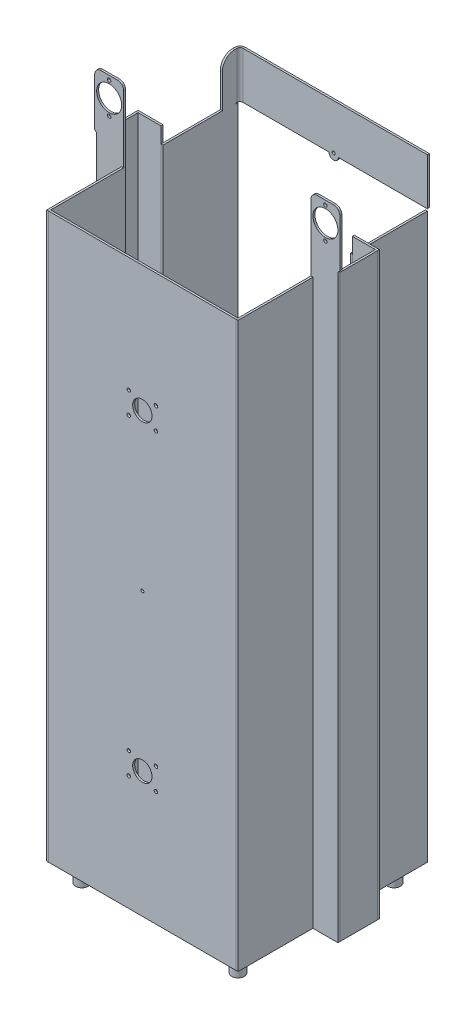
ISO-10303-21;
HEADER;
FILE_DESCRIPTION(('STEP AP214'),'2;1');
FILE_NAME('part.step','',(''),(''),'','','');
FILE_SCHEMA(('AUTOMOTIVE_DESIGN { 1 0 10303 214 1 1 1 1 }'));
ENDSEC;
DATA;
#1=APPLICATION_CONTEXT('core data for automotive mechanical design processes');
#2=APPLICATION_PROTOCOL_DEFINITION('international standard','automotive_design',2000,#1);
#3=PRODUCT_CONTEXT('',#1,'mechanical');
#4=PRODUCT('Part','Part','',(#3));
#5=PRODUCT_RELATED_PRODUCT_CATEGORY('part','',(#4));
#6=PRODUCT_DEFINITION_FORMATION('','',#4);
#7=PRODUCT_DEFINITION_CONTEXT('part definition',#1,'design');
#8=PRODUCT_DEFINITION('design','',#6,#7);
#9=PRODUCT_DEFINITION_SHAPE('','',#8);
#10=(LENGTH_UNIT() NAMED_UNIT(*) SI_UNIT(.MILLI.,.METRE.));
#11=(NAMED_UNIT(*) PLANE_ANGLE_UNIT() SI_UNIT($,.RADIAN.));
#12=(NAMED_UNIT(*) SI_UNIT($,.STERADIAN.) SOLID_ANGLE_UNIT());
#13=UNCERTAINTY_MEASURE_WITH_UNIT(LENGTH_MEASURE(1.E-05),#10,'distance_accuracy_value','');
#14=(GEOMETRIC_REPRESENTATION_CONTEXT(3) GLOBAL_UNCERTAINTY_ASSIGNED_CONTEXT((#13)) GLOBAL_UNIT_ASSIGNED_CONTEXT((#10,
#11,#12)) REPRESENTATION_CONTEXT('',''));
#15=CARTESIAN_POINT('',(0.,0.,0.));
#16=DIRECTION('',(0.,0.,1.));
#17=DIRECTION('',(1.,0.,0.));
#18=AXIS2_PLACEMENT_3D('',#15,#16,#17);
#19=CARTESIAN_POINT('',(-600.,0.,-233.65));
#20=DIRECTION('',(0.,0.,-1.));
#21=DIRECTION('',(1.,0.,0.));
#22=AXIS2_PLACEMENT_3D('',#19,#20,#21);
#23=PLANE('',#22);
#24=DIRECTION('',(0.707106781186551,0.707106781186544,0.));
#25=VECTOR('',#24,1.);
#26=CARTESIAN_POINT('',(82.5999999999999,1850.,-233.65));
#27=LINE('',#26,#25);
#28=CARTESIAN_POINT('',(92.6,1860.,-233.65));
#29=VERTEX_POINT('',#28);
#30=CARTESIAN_POINT('',(86.3499999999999,1853.75,-233.65));
#31=VERTEX_POINT('',#30);
#32=EDGE_CURVE('E60',#29,#31,#27,.F.);
#33=ORIENTED_EDGE('',*,*,#32,.F.);
#34=DIRECTION('',(0.,-1.,0.));
#35=VECTOR('',#34,1.);
#36=CARTESIAN_POINT('',(92.6,2033.5,-233.65));
#37=LINE('',#36,#35);
#38=CARTESIAN_POINT('',(92.6,2013.5,-233.65));
#39=VERTEX_POINT('',#38);
#40=EDGE_CURVE('E164',#39,#29,#37,.T.);
#41=ORIENTED_EDGE('',*,*,#40,.F.);
#42=CARTESIAN_POINT('',(72.6,2013.5,-233.65));
#43=DIRECTION('',(0.,0.,1.));
#44=DIRECTION('',(1.,0.,0.));
#45=AXIS2_PLACEMENT_3D('',#42,#43,#44);
#46=CIRCLE('',#45,20.);
#47=CARTESIAN_POINT('',(72.6000000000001,2033.5,-233.65));
#48=VERTEX_POINT('',#47);
#49=EDGE_CURVE('E206',#48,#39,#46,.F.);
#50=ORIENTED_EDGE('',*,*,#49,.F.);
#51=DIRECTION('',(1.,0.,0.));
#52=VECTOR('',#51,1.);
#53=CARTESIAN_POINT('',(92.6,2033.5,-233.65));
#54=LINE('',#53,#52);
#55=CARTESIAN_POINT('',(20.0000000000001,2033.5,-233.65));
#56=VERTEX_POINT('',#55);
#57=EDGE_CURVE('E158',#56,#48,#54,.T.);
#58=ORIENTED_EDGE('',*,*,#57,.F.);
#59=CARTESIAN_POINT('',(20.,2013.5,-233.65));
#60=DIRECTION('',(0.,0.,1.));
#61=DIRECTION('',(1.,0.,0.));
#62=AXIS2_PLACEMENT_3D('',#59,#60,#61);
#63=CIRCLE('',#62,20.);
#64=CARTESIAN_POINT('',(0.,2013.5,-233.65));
#65=VERTEX_POINT('',#64);
#66=EDGE_CURVE('E203',#65,#56,#63,.F.);
#67=ORIENTED_EDGE('',*,*,#66,.F.);
#68=DIRECTION('',(0.,1.,0.));
#69=VECTOR('',#68,1.);
#70=CARTESIAN_POINT('',(0.,1800.,-233.65));
#71=LINE('',#70,#69);
#72=CARTESIAN_POINT('',(0.,1800.,-233.65));
#73=VERTEX_POINT('',#72);
#74=EDGE_CURVE('E156',#73,#65,#71,.T.);
#75=ORIENTED_EDGE('',*,*,#74,.F.);
#76=DIRECTION('',(-1.,0.,0.));
#77=VECTOR('',#76,1.);
#78=CARTESIAN_POINT('',(6.34999999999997,1800.,-233.65));
#79=LINE('',#78,#77);
#80=CARTESIAN_POINT('',(6.34999999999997,1800.,-233.65));
#81=VERTEX_POINT('',#80);
#82=EDGE_CURVE('E133',#81,#73,#79,.T.);
#83=ORIENTED_EDGE('',*,*,#82,.F.);
#84=DIRECTION('',(0.,1.,0.));
#85=VECTOR('',#84,1.);
#86=CARTESIAN_POINT('',(6.34999999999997,-6.35000000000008,-233.65));
#87=LINE('',#86,#85);
#88=CARTESIAN_POINT('',(6.34999999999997,-6.35000000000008,-233.65));
#89=VERTEX_POINT('',#88);
#90=EDGE_CURVE('E144',#89,#81,#87,.T.);
#91=ORIENTED_EDGE('',*,*,#90,.F.);
#92=DIRECTION('',(-1.,0.,0.));
#93=VECTOR('',#92,1.);
#94=CARTESIAN_POINT('',(6.34999999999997,-6.35000000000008,-233.65));
#95=LINE('',#94,#93);
#96=CARTESIAN_POINT('',(86.3499999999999,-6.35000000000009,-233.65));
#97=VERTEX_POINT('',#96);
#98=EDGE_CURVE('E168',#97,#89,#95,.T.);
#99=ORIENTED_EDGE('',*,*,#98,.F.);
#100=DIRECTION('',(0.,-1.,0.));
#101=VECTOR('',#100,1.);
#102=CARTESIAN_POINT('',(86.3499999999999,-6.35000000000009,-233.65));
#103=LINE('',#102,#101);
#104=EDGE_CURVE('E166',#31,#97,#103,.T.);
#105=ORIENTED_EDGE('',*,*,#104,.F.);
#106=EDGE_LOOP('',(#33,#41,#50,#58,#67,#75,#83,#91,#99,#105));
#107=FACE_BOUND('',#106,.T.);
#108=CARTESIAN_POINT('',(46.35,1970.,-233.65));
#109=DIRECTION('',(0.,0.,-1.));
#110=DIRECTION('',(-1.,0.,0.));
#111=AXIS2_PLACEMENT_3D('',#108,#109,#110);
#112=CIRCLE('',#111,40.);
#113=CARTESIAN_POINT('',(6.34999999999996,1970.,-233.65));
#114=VERTEX_POINT('',#113);
#115=EDGE_CURVE('E172',#114,#114,#112,.T.);
#116=ORIENTED_EDGE('',*,*,#115,.T.);
#117=EDGE_LOOP('',(#116));
#118=FACE_BOUND('',#117,.T.);
#119=CARTESIAN_POINT('',(46.35,2020.,-233.65));
#120=DIRECTION('',(0.,0.,-1.));
#121=DIRECTION('',(-1.,0.,0.));
#122=AXIS2_PLACEMENT_3D('',#119,#120,#121);
#123=CIRCLE('',#122,5.49999999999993);
#124=CARTESIAN_POINT('',(40.8500000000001,2020.,-233.65));
#125=VERTEX_POINT('',#124);
#126=EDGE_CURVE('E400',#125,#125,#123,.T.);
#127=ORIENTED_EDGE('',*,*,#126,.T.);
#128=EDGE_LOOP('',(#127));
#129=FACE_BOUND('',#128,.T.);
#130=CARTESIAN_POINT('',(46.35,1920.,-233.65));
#131=DIRECTION('',(0.,0.,-1.));
#132=DIRECTION('',(-1.,0.,0.));
#133=AXIS2_PLACEMENT_3D('',#130,#131,#132);
#134=CIRCLE('',#133,5.49999999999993);
#135=CARTESIAN_POINT('',(40.8500000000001,1920.,-233.65));
#136=VERTEX_POINT('',#135);
#137=EDGE_CURVE('E391',#136,#136,#134,.T.);
#138=ORIENTED_EDGE('',*,*,#137,.T.);
#139=EDGE_LOOP('',(#138));
#140=FACE_BOUND('',#139,.T.);
#141=ADVANCED_FACE('F52',(#107,#118,#129,#140),#23,.F.);
#142=CARTESIAN_POINT('',(-600.,0.,-240.));
#143=DIRECTION('',(0.,0.,-1.));
#144=DIRECTION('',(1.,0.,0.));
#145=AXIS2_PLACEMENT_3D('',#142,#143,#144);
#146=PLANE('',#145);
#147=CARTESIAN_POINT('',(46.35,2020.,-240.));
#148=DIRECTION('',(0.,0.,-1.));
#149=DIRECTION('',(-1.,0.,0.));
#150=AXIS2_PLACEMENT_3D('',#147,#148,#149);
#151=CIRCLE('',#150,5.49999999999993);
#152=CARTESIAN_POINT('',(40.8500000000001,2020.,-240.));
#153=VERTEX_POINT('',#152);
#154=EDGE_CURVE('E397',#153,#153,#151,.T.);
#155=ORIENTED_EDGE('',*,*,#154,.F.);
#156=EDGE_LOOP('',(#155));
#157=FACE_BOUND('',#156,.T.);
#158=DIRECTION('',(0.,-1.,0.));
#159=VECTOR('',#158,1.);
#160=CARTESIAN_POINT('',(86.3499999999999,-6.35000000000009,-240.));
#161=LINE('',#160,#159);
#162=CARTESIAN_POINT('',(86.3499999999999,1853.75,-240.));
#163=VERTEX_POINT('',#162);
#164=CARTESIAN_POINT('',(86.3499999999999,-6.35000000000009,-240.));
#165=VERTEX_POINT('',#164);
#166=EDGE_CURVE('E183',#163,#165,#161,.T.);
#167=ORIENTED_EDGE('',*,*,#166,.T.);
#168=DIRECTION('',(-1.,0.,0.));
#169=VECTOR('',#168,1.);
#170=CARTESIAN_POINT('',(6.34999999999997,-6.35000000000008,-240.));
#171=LINE('',#170,#169);
#172=CARTESIAN_POINT('',(6.34999999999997,-6.35000000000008,-240.));
#173=VERTEX_POINT('',#172);
#174=EDGE_CURVE('E150',#165,#173,#171,.T.);
#175=ORIENTED_EDGE('',*,*,#174,.T.);
#176=DIRECTION('',(0.,1.,0.));
#177=VECTOR('',#176,1.);
#178=CARTESIAN_POINT('',(6.34999999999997,-6.35000000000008,-240.));
#179=LINE('',#178,#177);
#180=CARTESIAN_POINT('',(6.34999999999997,1800.,-240.));
#181=VERTEX_POINT('',#180);
#182=EDGE_CURVE('E170',#173,#181,#179,.T.);
#183=ORIENTED_EDGE('',*,*,#182,.T.);
#184=DIRECTION('',(-1.,0.,0.));
#185=VECTOR('',#184,1.);
#186=CARTESIAN_POINT('',(6.34999999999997,1800.,-240.));
#187=LINE('',#186,#185);
#188=CARTESIAN_POINT('',(0.,1800.,-240.));
#189=VERTEX_POINT('',#188);
#190=EDGE_CURVE('E136',#181,#189,#187,.T.);
#191=ORIENTED_EDGE('',*,*,#190,.T.);
#192=DIRECTION('',(0.,1.,0.));
#193=VECTOR('',#192,1.);
#194=CARTESIAN_POINT('',(0.,1800.,-240.));
#195=LINE('',#194,#193);
#196=CARTESIAN_POINT('',(0.,2013.5,-240.));
#197=VERTEX_POINT('',#196);
#198=EDGE_CURVE('E174',#189,#197,#195,.T.);
#199=ORIENTED_EDGE('',*,*,#198,.T.);
#200=CARTESIAN_POINT('',(20.,2013.5,-240.));
#201=DIRECTION('',(0.,0.,1.));
#202=DIRECTION('',(1.,0.,0.));
#203=AXIS2_PLACEMENT_3D('',#200,#201,#202);
#204=CIRCLE('',#203,20.);
#205=CARTESIAN_POINT('',(20.0000000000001,2033.5,-240.));
#206=VERTEX_POINT('',#205);
#207=EDGE_CURVE('E193',#206,#197,#204,.T.);
#208=ORIENTED_EDGE('',*,*,#207,.F.);
#209=DIRECTION('',(1.,0.,0.));
#210=VECTOR('',#209,1.);
#211=CARTESIAN_POINT('',(92.6,2033.5,-240.));
#212=LINE('',#211,#210);
#213=CARTESIAN_POINT('',(72.6000000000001,2033.5,-240.));
#214=VERTEX_POINT('',#213);
#215=EDGE_CURVE('E177',#206,#214,#212,.T.);
#216=ORIENTED_EDGE('',*,*,#215,.T.);
#217=CARTESIAN_POINT('',(72.6,2013.5,-240.));
#218=DIRECTION('',(0.,0.,1.));
#219=DIRECTION('',(1.,0.,0.));
#220=AXIS2_PLACEMENT_3D('',#217,#218,#219);
#221=CIRCLE('',#220,20.);
#222=CARTESIAN_POINT('',(92.6,2013.5,-240.));
#223=VERTEX_POINT('',#222);
#224=EDGE_CURVE('E196',#223,#214,#221,.T.);
#225=ORIENTED_EDGE('',*,*,#224,.F.);
#226=DIRECTION('',(0.,-1.,0.));
#227=VECTOR('',#226,1.);
#228=CARTESIAN_POINT('',(92.6,2033.5,-240.));
#229=LINE('',#228,#227);
#230=CARTESIAN_POINT('',(92.6,1860.,-240.));
#231=VERTEX_POINT('',#230);
#232=EDGE_CURVE('E180',#223,#231,#229,.T.);
#233=ORIENTED_EDGE('',*,*,#232,.T.);
#234=DIRECTION('',(-0.707106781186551,-0.707106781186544,0.));
#235=VECTOR('',#234,1.);
#236=CARTESIAN_POINT('',(-1183.7,583.70000000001,-240.));
#237=LINE('',#236,#235);
#238=EDGE_CURVE('E211',#163,#231,#237,.F.);
#239=ORIENTED_EDGE('',*,*,#238,.F.);
#240=EDGE_LOOP('',(#167,#175,#183,#191,#199,#208,#216,#225,#233,#239));
#241=FACE_BOUND('',#240,.T.);
#242=CARTESIAN_POINT('',(46.35,1970.,-240.));
#243=DIRECTION('',(0.,0.,-1.));
#244=DIRECTION('',(-1.,0.,0.));
#245=AXIS2_PLACEMENT_3D('',#242,#243,#244);
#246=CIRCLE('',#245,40.);
#247=CARTESIAN_POINT('',(6.34999999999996,1970.,-240.));
#248=VERTEX_POINT('',#247);
#249=EDGE_CURVE('E403',#248,#248,#246,.T.);
#250=ORIENTED_EDGE('',*,*,#249,.F.);
#251=EDGE_LOOP('',(#250));
#252=FACE_BOUND('',#251,.T.);
#253=CARTESIAN_POINT('',(46.35,1920.,-240.));
#254=DIRECTION('',(0.,0.,-1.));
#255=DIRECTION('',(-1.,0.,0.));
#256=AXIS2_PLACEMENT_3D('',#253,#254,#255);
#257=CIRCLE('',#256,5.49999999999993);
#258=CARTESIAN_POINT('',(40.8500000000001,1920.,-240.));
#259=VERTEX_POINT('',#258);
#260=EDGE_CURVE('E394',#259,#259,#257,.T.);
#261=ORIENTED_EDGE('',*,*,#260,.F.);
#262=EDGE_LOOP('',(#261));
#263=FACE_BOUND('',#262,.T.);
#264=ADVANCED_FACE('F221',(#157,#241,#252,#263),#146,.T.);
#265=CARTESIAN_POINT('',(6.34999999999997,-6.35000000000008,-233.65));
#266=DIRECTION('',(1.,0.,0.));
#267=DIRECTION('',(0.,0.,1.));
#268=AXIS2_PLACEMENT_3D('',#265,#266,#267);
#269=PLANE('',#268);
#270=ORIENTED_EDGE('',*,*,#182,.F.);
#271=DIRECTION('',(0.,0.,-1.));
#272=VECTOR('',#271,1.);
#273=CARTESIAN_POINT('',(6.34999999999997,-6.35000000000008,-233.65));
#274=LINE('',#273,#272);
#275=EDGE_CURVE('E146',#89,#173,#274,.T.);
#276=ORIENTED_EDGE('',*,*,#275,.F.);
#277=ORIENTED_EDGE('',*,*,#90,.T.);
#278=DIRECTION('',(0.,0.,-1.));
#279=VECTOR('',#278,1.);
#280=CARTESIAN_POINT('',(6.34999999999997,1800.,-233.65));
#281=LINE('',#280,#279);
#282=EDGE_CURVE('E129',#81,#181,#281,.T.);
#283=ORIENTED_EDGE('',*,*,#282,.T.);
#284=EDGE_LOOP('',(#270,#276,#277,#283));
#285=FACE_BOUND('',#284,.T.);
#286=ADVANCED_FACE('F145',(#285),#269,.F.);
#287=CARTESIAN_POINT('',(6.34999999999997,1800.,-233.65));
#288=DIRECTION('',(0.,1.,0.));
#289=DIRECTION('',(0.,0.,1.));
#290=AXIS2_PLACEMENT_3D('',#287,#288,#289);
#291=PLANE('',#290);
#292=ORIENTED_EDGE('',*,*,#190,.F.);
#293=ORIENTED_EDGE('',*,*,#282,.F.);
#294=ORIENTED_EDGE('',*,*,#82,.T.);
#295=DIRECTION('',(0.,0.,-1.));
#296=VECTOR('',#295,1.);
#297=CARTESIAN_POINT('',(0.,1800.,-233.65));
#298=LINE('',#297,#296);
#299=EDGE_CURVE('E141',#73,#189,#298,.T.);
#300=ORIENTED_EDGE('',*,*,#299,.T.);
#301=EDGE_LOOP('',(#292,#293,#294,#300));
#302=FACE_BOUND('',#301,.T.);
#303=ADVANCED_FACE('F131',(#302),#291,.F.);
#304=CARTESIAN_POINT('',(0.,1800.,-233.65));
#305=DIRECTION('',(1.,0.,0.));
#306=DIRECTION('',(0.,0.,1.));
#307=AXIS2_PLACEMENT_3D('',#304,#305,#306);
#308=PLANE('',#307);
#309=ORIENTED_EDGE('',*,*,#198,.F.);
#310=ORIENTED_EDGE('',*,*,#299,.F.);
#311=ORIENTED_EDGE('',*,*,#74,.T.);
#312=DIRECTION('',(0.,0.,-1.));
#313=VECTOR('',#312,1.);
#314=CARTESIAN_POINT('',(0.,2013.5,-233.65));
#315=LINE('',#314,#313);
#316=EDGE_CURVE('E209',#197,#65,#315,.F.);
#317=ORIENTED_EDGE('',*,*,#316,.F.);
#318=EDGE_LOOP('',(#309,#310,#311,#317));
#319=FACE_BOUND('',#318,.T.);
#320=ADVANCED_FACE('F238',(#319),#308,.F.);
#321=CARTESIAN_POINT('',(92.6,2033.5,-233.65));
#322=DIRECTION('',(0.,-1.,0.));
#323=DIRECTION('',(-1.,0.,0.));
#324=AXIS2_PLACEMENT_3D('',#321,#322,#323);
#325=PLANE('',#324);
#326=ORIENTED_EDGE('',*,*,#215,.F.);
#327=DIRECTION('',(0.,0.,-1.));
#328=VECTOR('',#327,1.);
#329=CARTESIAN_POINT('',(20.0000000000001,2033.5,-233.65));
#330=LINE('',#329,#328);
#331=EDGE_CURVE('E199',#56,#206,#330,.T.);
#332=ORIENTED_EDGE('',*,*,#331,.F.);
#333=ORIENTED_EDGE('',*,*,#57,.T.);
#334=DIRECTION('',(0.,0.,-1.));
#335=VECTOR('',#334,1.);
#336=CARTESIAN_POINT('',(72.6000000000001,2033.5,-233.65));
#337=LINE('',#336,#335);
#338=EDGE_CURVE('E201',#214,#48,#337,.F.);
#339=ORIENTED_EDGE('',*,*,#338,.F.);
#340=EDGE_LOOP('',(#326,#332,#333,#339));
#341=FACE_BOUND('',#340,.T.);
#342=ADVANCED_FACE('F232',(#341),#325,.F.);
#343=CARTESIAN_POINT('',(92.6,2033.5,-233.65));
#344=DIRECTION('',(-1.,0.,0.));
#345=DIRECTION('',(0.,0.,-1.));
#346=AXIS2_PLACEMENT_3D('',#343,#344,#345);
#347=PLANE('',#346);
#348=ORIENTED_EDGE('',*,*,#232,.F.);
#349=DIRECTION('',(0.,0.,-1.));
#350=VECTOR('',#349,1.);
#351=CARTESIAN_POINT('',(92.6,2013.5,-233.65));
#352=LINE('',#351,#350);
#353=EDGE_CURVE('E140',#39,#223,#352,.T.);
#354=ORIENTED_EDGE('',*,*,#353,.F.);
#355=ORIENTED_EDGE('',*,*,#40,.T.);
#356=DIRECTION('',(0.,0.,1.));
#357=VECTOR('',#356,1.);
#358=CARTESIAN_POINT('',(92.6,1860.,-233.65));
#359=LINE('',#358,#357);
#360=EDGE_CURVE('E73',#231,#29,#359,.T.);
#361=ORIENTED_EDGE('',*,*,#360,.F.);
#362=EDGE_LOOP('',(#348,#354,#355,#361));
#363=FACE_BOUND('',#362,.T.);
#364=ADVANCED_FACE('F226',(#363),#347,.F.);
#365=CARTESIAN_POINT('',(86.3499999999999,-6.35000000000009,-233.65));
#366=DIRECTION('',(-1.,0.,0.));
#367=DIRECTION('',(0.,0.,-1.));
#368=AXIS2_PLACEMENT_3D('',#365,#366,#367);
#369=PLANE('',#368);
#370=ORIENTED_EDGE('',*,*,#166,.F.);
#371=DIRECTION('',(0.,0.,1.));
#372=VECTOR('',#371,1.);
#373=CARTESIAN_POINT('',(86.3499999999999,1853.75,-233.65));
#374=LINE('',#373,#372);
#375=EDGE_CURVE('E12',#31,#163,#374,.F.);
#376=ORIENTED_EDGE('',*,*,#375,.F.);
#377=ORIENTED_EDGE('',*,*,#104,.T.);
#378=DIRECTION('',(0.,0.,-1.));
#379=VECTOR('',#378,1.);
#380=CARTESIAN_POINT('',(86.3499999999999,-6.35000000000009,-233.65));
#381=LINE('',#380,#379);
#382=EDGE_CURVE('E189',#97,#165,#381,.T.);
#383=ORIENTED_EDGE('',*,*,#382,.T.);
#384=EDGE_LOOP('',(#370,#376,#377,#383));
#385=FACE_BOUND('',#384,.T.);
#386=ADVANCED_FACE('F216',(#385),#369,.F.);
#387=CARTESIAN_POINT('',(6.34999999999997,-6.35000000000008,-233.65));
#388=DIRECTION('',(0.,1.,0.));
#389=DIRECTION('',(1.,0.,0.));
#390=AXIS2_PLACEMENT_3D('',#387,#388,#389);
#391=PLANE('',#390);
#392=ORIENTED_EDGE('',*,*,#174,.F.);
#393=ORIENTED_EDGE('',*,*,#382,.F.);
#394=ORIENTED_EDGE('',*,*,#98,.T.);
#395=ORIENTED_EDGE('',*,*,#275,.T.);
#396=EDGE_LOOP('',(#392,#393,#394,#395));
#397=FACE_BOUND('',#396,.T.);
#398=ADVANCED_FACE('F219',(#397),#391,.F.);
#399=CARTESIAN_POINT('',(46.35,1970.,-233.65));
#400=DIRECTION('',(0.,0.,-1.));
#401=DIRECTION('',(1.,0.,0.));
#402=AXIS2_PLACEMENT_3D('',#399,#400,#401);
#403=CYLINDRICAL_SURFACE('',#402,40.);
#404=ORIENTED_EDGE('',*,*,#115,.F.);
#405=EDGE_LOOP('',(#404));
#406=FACE_BOUND('',#405,.T.);
#407=ORIENTED_EDGE('',*,*,#249,.T.);
#408=EDGE_LOOP('',(#407));
#409=FACE_BOUND('',#408,.T.);
#410=ADVANCED_FACE('F255',(#406,#409),#403,.F.);
#411=CARTESIAN_POINT('',(46.35,2020.,-233.65));
#412=DIRECTION('',(0.,0.,-1.));
#413=DIRECTION('',(1.,0.,0.));
#414=AXIS2_PLACEMENT_3D('',#411,#412,#413);
#415=CYLINDRICAL_SURFACE('',#414,5.49999999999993);
#416=ORIENTED_EDGE('',*,*,#126,.F.);
#417=EDGE_LOOP('',(#416));
#418=FACE_BOUND('',#417,.T.);
#419=ORIENTED_EDGE('',*,*,#154,.T.);
#420=EDGE_LOOP('',(#419));
#421=FACE_BOUND('',#420,.T.);
#422=ADVANCED_FACE('F281',(#418,#421),#415,.F.);
#423=CARTESIAN_POINT('',(46.35,1920.,-233.65));
#424=DIRECTION('',(0.,0.,-1.));
#425=DIRECTION('',(1.,0.,0.));
#426=AXIS2_PLACEMENT_3D('',#423,#424,#425);
#427=CYLINDRICAL_SURFACE('',#426,5.49999999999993);
#428=ORIENTED_EDGE('',*,*,#137,.F.);
#429=EDGE_LOOP('',(#428));
#430=FACE_BOUND('',#429,.T.);
#431=ORIENTED_EDGE('',*,*,#260,.T.);
#432=EDGE_LOOP('',(#431));
#433=FACE_BOUND('',#432,.T.);
#434=ADVANCED_FACE('F288',(#430,#433),#427,.F.);
#435=CARTESIAN_POINT('',(72.6,2013.5,-233.65));
#436=DIRECTION('',(0.,0.,-1.));
#437=DIRECTION('',(1.,0.,0.));
#438=AXIS2_PLACEMENT_3D('',#435,#436,#437);
#439=CYLINDRICAL_SURFACE('',#438,20.);
#440=ORIENTED_EDGE('',*,*,#49,.T.);
#441=ORIENTED_EDGE('',*,*,#353,.T.);
#442=ORIENTED_EDGE('',*,*,#224,.T.);
#443=ORIENTED_EDGE('',*,*,#338,.T.);
#444=EDGE_LOOP('',(#440,#441,#442,#443));
#445=FACE_BOUND('',#444,.T.);
#446=ADVANCED_FACE('F228',(#445),#439,.T.);
#447=CARTESIAN_POINT('',(20.,2013.5,-233.65));
#448=DIRECTION('',(0.,0.,-1.));
#449=DIRECTION('',(1.,0.,0.));
#450=AXIS2_PLACEMENT_3D('',#447,#448,#449);
#451=CYLINDRICAL_SURFACE('',#450,20.);
#452=ORIENTED_EDGE('',*,*,#66,.T.);
#453=ORIENTED_EDGE('',*,*,#331,.T.);
#454=ORIENTED_EDGE('',*,*,#207,.T.);
#455=ORIENTED_EDGE('',*,*,#316,.T.);
#456=EDGE_LOOP('',(#452,#453,#454,#455));
#457=FACE_BOUND('',#456,.T.);
#458=ADVANCED_FACE('F235',(#457),#451,.T.);
#459=CARTESIAN_POINT('',(82.5999999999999,1850.,-233.65));
#460=DIRECTION('',(-0.707106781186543,0.707106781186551,0.));
#461=DIRECTION('',(0.,0.,-1.));
#462=AXIS2_PLACEMENT_3D('',#459,#460,#461);
#463=PLANE('',#462);
#464=ORIENTED_EDGE('',*,*,#32,.T.);
#465=ORIENTED_EDGE('',*,*,#375,.T.);
#466=ORIENTED_EDGE('',*,*,#238,.T.);
#467=ORIENTED_EDGE('',*,*,#360,.T.);
#468=EDGE_LOOP('',(#464,#465,#466,#467));
#469=FACE_BOUND('',#468,.T.);
#470=ADVANCED_FACE('F54',(#469),#463,.F.);
#471=CLOSED_SHELL('',(#141,#264,#286,#303,#320,#342,#364,#386,#398,#410,#422,#434,#446,#458,#470));
#472=MANIFOLD_SOLID_BREP('B2',#471);
#473=CARTESIAN_POINT('',(-606.35,-6.35,-366.35));
#474=DIRECTION('',(-1.,0.,0.));
#475=DIRECTION('',(0.,0.,1.));
#476=AXIS2_PLACEMENT_3D('',#473,#474,#475);
#477=PLANE('',#476);
#478=DIRECTION('',(0.,-1.,0.));
#479=VECTOR('',#478,1.);
#480=CARTESIAN_POINT('',(-606.35,-6.35,-360.));
#481=LINE('',#480,#479);
#482=CARTESIAN_POINT('',(-606.35,1850.,-360.));
#483=VERTEX_POINT('',#482);
#484=CARTESIAN_POINT('',(-606.35,-6.35,-360.));
#485=VERTEX_POINT('',#484);
#486=EDGE_CURVE('E492',#483,#485,#481,.T.);
#487=ORIENTED_EDGE('',*,*,#486,.T.);
#488=DIRECTION('',(0.,0.,1.));
#489=VECTOR('',#488,1.);
#490=CARTESIAN_POINT('',(-606.35,-6.35,-366.35));
#491=LINE('',#490,#489);
#492=CARTESIAN_POINT('',(-606.35,-6.35,-366.35));
#493=VERTEX_POINT('',#492);
#494=EDGE_CURVE('E50',#493,#485,#491,.T.);
#495=ORIENTED_EDGE('',*,*,#494,.F.);
#496=DIRECTION('',(0.,-1.,0.));
#497=VECTOR('',#496,1.);
#498=CARTESIAN_POINT('',(-606.35,-6.35,-366.35));
#499=LINE('',#498,#497);
#500=CARTESIAN_POINT('',(-606.35,1850.,-366.35));
#501=VERTEX_POINT('',#500);
#502=EDGE_CURVE('E480',#501,#493,#499,.T.);
#503=ORIENTED_EDGE('',*,*,#502,.F.);
#504=DIRECTION('',(0.,0.,1.));
#505=VECTOR('',#504,1.);
#506=CARTESIAN_POINT('',(-606.35,1850.,-366.35));
#507=LINE('',#506,#505);
#508=EDGE_CURVE('E488',#501,#483,#507,.T.);
#509=ORIENTED_EDGE('',*,*,#508,.T.);
#510=EDGE_LOOP('',(#487,#495,#503,#509));
#511=FACE_BOUND('',#510,.T.);
#512=ADVANCED_FACE('F429',(#511),#477,.F.);
#513=CARTESIAN_POINT('',(-606.35,-6.35,-366.35));
#514=DIRECTION('',(0.,1.,0.));
#515=DIRECTION('',(0.,0.,1.));
#516=AXIS2_PLACEMENT_3D('',#513,#514,#515);
#517=PLANE('',#516);
#518=DIRECTION('',(-1.,0.,0.));
#519=VECTOR('',#518,1.);
#520=CARTESIAN_POINT('',(-606.35,-6.35,-360.));
#521=LINE('',#520,#519);
#522=CARTESIAN_POINT('',(-686.35,-6.35,-360.));
#523=VERTEX_POINT('',#522);
#524=EDGE_CURVE('E484',#485,#523,#521,.T.);
#525=ORIENTED_EDGE('',*,*,#524,.T.);
#526=DIRECTION('',(0.,0.,1.));
#527=VECTOR('',#526,1.);
#528=CARTESIAN_POINT('',(-686.35,-6.35,-366.35));
#529=LINE('',#528,#527);
#530=CARTESIAN_POINT('',(-686.35,-6.35,-366.35));
#531=VERTEX_POINT('',#530);
#532=EDGE_CURVE('E437',#531,#523,#529,.T.);
#533=ORIENTED_EDGE('',*,*,#532,.F.);
#534=DIRECTION('',(-1.,0.,0.));
#535=VECTOR('',#534,1.);
#536=CARTESIAN_POINT('',(-606.35,-6.35,-366.35));
#537=LINE('',#536,#535);
#538=EDGE_CURVE('E475',#493,#531,#537,.T.);
#539=ORIENTED_EDGE('',*,*,#538,.F.);
#540=ORIENTED_EDGE('',*,*,#494,.T.);
#541=EDGE_LOOP('',(#525,#533,#539,#540));
#542=FACE_BOUND('',#541,.T.);
#543=ADVANCED_FACE('F483',(#542),#517,.F.);
#544=CARTESIAN_POINT('',(-686.35,-6.35,-366.35));
#545=DIRECTION('',(1.,0.,0.));
#546=DIRECTION('',(0.,0.,-1.));
#547=AXIS2_PLACEMENT_3D('',#544,#545,#546);
#548=PLANE('',#547);
#549=DIRECTION('',(0.,1.,0.));
#550=VECTOR('',#549,1.);
#551=CARTESIAN_POINT('',(-686.35,-6.35,-360.));
#552=LINE('',#551,#550);
#553=CARTESIAN_POINT('',(-686.35,1850.,-360.));
#554=VERTEX_POINT('',#553);
#555=EDGE_CURVE('E462',#523,#554,#552,.T.);
#556=ORIENTED_EDGE('',*,*,#555,.T.);
#557=DIRECTION('',(0.,0.,1.));
#558=VECTOR('',#557,1.);
#559=CARTESIAN_POINT('',(-686.35,1850.,-366.35));
#560=LINE('',#559,#558);
#561=CARTESIAN_POINT('',(-686.35,1850.,-366.35));
#562=VERTEX_POINT('',#561);
#563=EDGE_CURVE('E485',#562,#554,#560,.T.);
#564=ORIENTED_EDGE('',*,*,#563,.F.);
#565=DIRECTION('',(0.,1.,0.));
#566=VECTOR('',#565,1.);
#567=CARTESIAN_POINT('',(-686.35,-6.35,-366.35));
#568=LINE('',#567,#566);
#569=EDGE_CURVE('E478',#531,#562,#568,.T.);
#570=ORIENTED_EDGE('',*,*,#569,.F.);
#571=ORIENTED_EDGE('',*,*,#532,.T.);
#572=EDGE_LOOP('',(#556,#564,#570,#571));
#573=FACE_BOUND('',#572,.T.);
#574=ADVANCED_FACE('F486',(#573),#548,.F.);
#575=CARTESIAN_POINT('',(-606.35,1850.,-366.35));
#576=DIRECTION('',(0.,-1.,0.));
#577=DIRECTION('',(0.,0.,-1.));
#578=AXIS2_PLACEMENT_3D('',#575,#576,#577);
#579=PLANE('',#578);
#580=DIRECTION('',(1.,0.,0.));
#581=VECTOR('',#580,1.);
#582=CARTESIAN_POINT('',(-606.35,1850.,-360.));
#583=LINE('',#582,#581);
#584=EDGE_CURVE('E468',#554,#483,#583,.T.);
#585=ORIENTED_EDGE('',*,*,#584,.T.);
#586=ORIENTED_EDGE('',*,*,#508,.F.);
#587=DIRECTION('',(1.,0.,0.));
#588=VECTOR('',#587,1.);
#589=CARTESIAN_POINT('',(-606.35,1850.,-366.35));
#590=LINE('',#589,#588);
#591=EDGE_CURVE('E445',#562,#501,#590,.T.);
#592=ORIENTED_EDGE('',*,*,#591,.F.);
#593=ORIENTED_EDGE('',*,*,#563,.T.);
#594=EDGE_LOOP('',(#585,#586,#592,#593));
#595=FACE_BOUND('',#594,.T.);
#596=ADVANCED_FACE('F499',(#595),#579,.F.);
#597=CARTESIAN_POINT('',(0.,0.,-366.35));
#598=DIRECTION('',(0.,0.,1.));
#599=DIRECTION('',(1.,0.,0.));
#600=AXIS2_PLACEMENT_3D('',#597,#598,#599);
#601=PLANE('',#600);
#602=ORIENTED_EDGE('',*,*,#502,.T.);
#603=ORIENTED_EDGE('',*,*,#538,.T.);
#604=ORIENTED_EDGE('',*,*,#569,.T.);
#605=ORIENTED_EDGE('',*,*,#591,.T.);
#606=EDGE_LOOP('',(#602,#603,#604,#605));
#607=FACE_BOUND('',#606,.T.);
#608=ADVANCED_FACE('F476',(#607),#601,.F.);
#609=CARTESIAN_POINT('',(0.,0.,-360.));
#610=DIRECTION('',(0.,0.,1.));
#611=DIRECTION('',(1.,0.,0.));
#612=AXIS2_PLACEMENT_3D('',#609,#610,#611);
#613=PLANE('',#612);
#614=ORIENTED_EDGE('',*,*,#486,.F.);
#615=ORIENTED_EDGE('',*,*,#584,.F.);
#616=ORIENTED_EDGE('',*,*,#555,.F.);
#617=ORIENTED_EDGE('',*,*,#524,.F.);
#618=EDGE_LOOP('',(#614,#615,#616,#617));
#619=FACE_BOUND('',#618,.T.);
#620=ADVANCED_FACE('F502',(#619),#613,.T.);
#621=CLOSED_SHELL('',(#512,#543,#574,#596,#608,#620));
#622=MANIFOLD_SOLID_BREP('B6',#621);
#623=CARTESIAN_POINT('',(0.,0.,-233.65));
#624=DIRECTION('',(0.,0.,-1.));
#625=DIRECTION('',(-1.,0.,0.));
#626=AXIS2_PLACEMENT_3D('',#623,#624,#625);
#627=PLANE('',#626);
#628=DIRECTION('',(-0.707106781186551,0.707106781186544,0.));
#629=VECTOR('',#628,1.);
#630=CARTESIAN_POINT('',(-682.6,1850.,-233.65));
#631=LINE('',#630,#629);
#632=CARTESIAN_POINT('',(-692.6,1860.,-233.65));
#633=VERTEX_POINT('',#632);
#634=CARTESIAN_POINT('',(-686.35,1853.75,-233.65));
#635=VERTEX_POINT('',#634);
#636=EDGE_CURVE('E584',#633,#635,#631,.F.);
#637=ORIENTED_EDGE('',*,*,#636,.T.);
#638=DIRECTION('',(0.,-1.,0.));
#639=VECTOR('',#638,1.);
#640=CARTESIAN_POINT('',(-686.35,-6.35000000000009,-233.65));
#641=LINE('',#640,#639);
#642=CARTESIAN_POINT('',(-686.35,-6.35000000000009,-233.65));
#643=VERTEX_POINT('',#642);
#644=EDGE_CURVE('E590',#635,#643,#641,.T.);
#645=ORIENTED_EDGE('',*,*,#644,.T.);
#646=DIRECTION('',(1.,0.,0.));
#647=VECTOR('',#646,1.);
#648=CARTESIAN_POINT('',(-606.35,-6.35000000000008,-233.65));
#649=LINE('',#648,#647);
#650=CARTESIAN_POINT('',(-606.35,-6.35000000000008,-233.65));
#651=VERTEX_POINT('',#650);
#652=EDGE_CURVE('E670',#643,#651,#649,.T.);
#653=ORIENTED_EDGE('',*,*,#652,.T.);
#654=DIRECTION('',(0.,1.,0.));
#655=VECTOR('',#654,1.);
#656=CARTESIAN_POINT('',(-606.35,-6.35000000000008,-233.65));
#657=LINE('',#656,#655);
#658=CARTESIAN_POINT('',(-606.35,1800.,-233.65));
#659=VERTEX_POINT('',#658);
#660=EDGE_CURVE('E665',#651,#659,#657,.T.);
#661=ORIENTED_EDGE('',*,*,#660,.T.);
#662=DIRECTION('',(1.,0.,0.));
#663=VECTOR('',#662,1.);
#664=CARTESIAN_POINT('',(-606.35,1800.,-233.65));
#665=LINE('',#664,#663);
#666=CARTESIAN_POINT('',(-600.,1800.,-233.65));
#667=VERTEX_POINT('',#666);
#668=EDGE_CURVE('E653',#659,#667,#665,.T.);
#669=ORIENTED_EDGE('',*,*,#668,.T.);
#670=DIRECTION('',(0.,1.,0.));
#671=VECTOR('',#670,1.);
#672=CARTESIAN_POINT('',(-600.,1800.,-233.65));
#673=LINE('',#672,#671);
#674=CARTESIAN_POINT('',(-600.,2013.5,-233.65));
#675=VERTEX_POINT('',#674);
#676=EDGE_CURVE('E664',#667,#675,#673,.T.);
#677=ORIENTED_EDGE('',*,*,#676,.T.);
#678=CARTESIAN_POINT('',(-620.,2013.5,-233.65));
#679=DIRECTION('',(0.,0.,-1.));
#680=DIRECTION('',(-1.,0.,0.));
#681=AXIS2_PLACEMENT_3D('',#678,#679,#680);
#682=CIRCLE('',#681,20.);
#683=CARTESIAN_POINT('',(-620.,2033.5,-233.65));
#684=VERTEX_POINT('',#683);
#685=EDGE_CURVE('E696',#675,#684,#682,.F.);
#686=ORIENTED_EDGE('',*,*,#685,.T.);
#687=DIRECTION('',(-1.,0.,0.));
#688=VECTOR('',#687,1.);
#689=CARTESIAN_POINT('',(-692.6,2033.5,-233.65));
#690=LINE('',#689,#688);
#691=CARTESIAN_POINT('',(-672.6,2033.5,-233.65));
#692=VERTEX_POINT('',#691);
#693=EDGE_CURVE('E752',#684,#692,#690,.T.);
#694=ORIENTED_EDGE('',*,*,#693,.T.);
#695=CARTESIAN_POINT('',(-672.6,2013.5,-233.65));
#696=DIRECTION('',(0.,0.,-1.));
#697=DIRECTION('',(-1.,0.,0.));
#698=AXIS2_PLACEMENT_3D('',#695,#696,#697);
#699=CIRCLE('',#698,20.);
#700=CARTESIAN_POINT('',(-692.6,2013.5,-233.65));
#701=VERTEX_POINT('',#700);
#702=EDGE_CURVE('E698',#692,#701,#699,.F.);
#703=ORIENTED_EDGE('',*,*,#702,.T.);
#704=DIRECTION('',(0.,-1.,0.));
#705=VECTOR('',#704,1.);
#706=CARTESIAN_POINT('',(-692.6,2033.5,-233.65));
#707=LINE('',#706,#705);
#708=EDGE_CURVE('E707',#701,#633,#707,.T.);
#709=ORIENTED_EDGE('',*,*,#708,.T.);
#710=EDGE_LOOP('',(#637,#645,#653,#661,#669,#677,#686,#694,#703,#709));
#711=FACE_BOUND('',#710,.T.);
#712=CARTESIAN_POINT('',(-646.35,1970.,-233.65));
#713=DIRECTION('',(0.,0.,1.));
#714=DIRECTION('',(1.,0.,0.));
#715=AXIS2_PLACEMENT_3D('',#712,#713,#714);
#716=CIRCLE('',#715,40.);
#717=CARTESIAN_POINT('',(-606.35,1970.,-233.65));
#718=VERTEX_POINT('',#717);
#719=EDGE_CURVE('E730',#718,#718,#716,.T.);
#720=ORIENTED_EDGE('',*,*,#719,.F.);
#721=EDGE_LOOP('',(#720));
#722=FACE_BOUND('',#721,.T.);
#723=CARTESIAN_POINT('',(-646.35,2020.,-233.65));
#724=DIRECTION('',(0.,0.,1.));
#725=DIRECTION('',(1.,0.,0.));
#726=AXIS2_PLACEMENT_3D('',#723,#724,#725);
#727=CIRCLE('',#726,5.49999999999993);
#728=CARTESIAN_POINT('',(-640.85,2020.,-233.65));
#729=VERTEX_POINT('',#728);
#730=EDGE_CURVE('E759',#729,#729,#727,.T.);
#731=ORIENTED_EDGE('',*,*,#730,.F.);
#732=EDGE_LOOP('',(#731));
#733=FACE_BOUND('',#732,.T.);
#734=CARTESIAN_POINT('',(-646.35,1920.,-233.65));
#735=DIRECTION('',(0.,0.,1.));
#736=DIRECTION('',(1.,0.,0.));
#737=AXIS2_PLACEMENT_3D('',#734,#735,#736);
#738=CIRCLE('',#737,5.49999999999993);
#739=CARTESIAN_POINT('',(-640.85,1920.,-233.65));
#740=VERTEX_POINT('',#739);
#741=EDGE_CURVE('E765',#740,#740,#738,.T.);
#742=ORIENTED_EDGE('',*,*,#741,.F.);
#743=EDGE_LOOP('',(#742));
#744=FACE_BOUND('',#743,.T.);
#745=ADVANCED_FACE('F575',(#711,#722,#733,#744),#627,.F.);
#746=CARTESIAN_POINT('',(0.,0.,-240.));
#747=DIRECTION('',(0.,0.,-1.));
#748=DIRECTION('',(-1.,0.,0.));
#749=AXIS2_PLACEMENT_3D('',#746,#747,#748);
#750=PLANE('',#749);
#751=CARTESIAN_POINT('',(-646.35,2020.,-240.));
#752=DIRECTION('',(0.,0.,1.));
#753=DIRECTION('',(1.,0.,0.));
#754=AXIS2_PLACEMENT_3D('',#751,#752,#753);
#755=CIRCLE('',#754,5.49999999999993);
#756=CARTESIAN_POINT('',(-640.85,2020.,-240.));
#757=VERTEX_POINT('',#756);
#758=EDGE_CURVE('E762',#757,#757,#755,.T.);
#759=ORIENTED_EDGE('',*,*,#758,.T.);
#760=EDGE_LOOP('',(#759));
#761=FACE_BOUND('',#760,.T.);
#762=DIRECTION('',(0.,-1.,0.));
#763=VECTOR('',#762,1.);
#764=CARTESIAN_POINT('',(-686.35,-6.35000000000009,-240.));
#765=LINE('',#764,#763);
#766=CARTESIAN_POINT('',(-686.35,1853.75,-240.));
#767=VERTEX_POINT('',#766);
#768=CARTESIAN_POINT('',(-686.35,-6.35000000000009,-240.));
#769=VERTEX_POINT('',#768);
#770=EDGE_CURVE('E710',#767,#769,#765,.T.);
#771=ORIENTED_EDGE('',*,*,#770,.F.);
#772=DIRECTION('',(0.707106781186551,-0.707106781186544,0.));
#773=VECTOR('',#772,1.);
#774=CARTESIAN_POINT('',(583.700000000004,583.70000000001,-240.));
#775=LINE('',#774,#773);
#776=CARTESIAN_POINT('',(-692.6,1860.,-240.));
#777=VERTEX_POINT('',#776);
#778=EDGE_CURVE('E702',#767,#777,#775,.F.);
#779=ORIENTED_EDGE('',*,*,#778,.T.);
#780=DIRECTION('',(0.,-1.,0.));
#781=VECTOR('',#780,1.);
#782=CARTESIAN_POINT('',(-692.6,2033.5,-240.));
#783=LINE('',#782,#781);
#784=CARTESIAN_POINT('',(-692.6,2013.5,-240.));
#785=VERTEX_POINT('',#784);
#786=EDGE_CURVE('E714',#785,#777,#783,.T.);
#787=ORIENTED_EDGE('',*,*,#786,.F.);
#788=CARTESIAN_POINT('',(-672.6,2013.5,-240.));
#789=DIRECTION('',(0.,0.,-1.));
#790=DIRECTION('',(-1.,0.,0.));
#791=AXIS2_PLACEMENT_3D('',#788,#789,#790);
#792=CIRCLE('',#791,20.);
#793=CARTESIAN_POINT('',(-672.6,2033.5,-240.));
#794=VERTEX_POINT('',#793);
#795=EDGE_CURVE('E689',#785,#794,#792,.T.);
#796=ORIENTED_EDGE('',*,*,#795,.T.);
#797=DIRECTION('',(-1.,0.,0.));
#798=VECTOR('',#797,1.);
#799=CARTESIAN_POINT('',(-692.6,2033.5,-240.));
#800=LINE('',#799,#798);
#801=CARTESIAN_POINT('',(-620.,2033.5,-240.));
#802=VERTEX_POINT('',#801);
#803=EDGE_CURVE('E735',#802,#794,#800,.T.);
#804=ORIENTED_EDGE('',*,*,#803,.F.);
#805=CARTESIAN_POINT('',(-620.,2013.5,-240.));
#806=DIRECTION('',(0.,0.,-1.));
#807=DIRECTION('',(-1.,0.,0.));
#808=AXIS2_PLACEMENT_3D('',#805,#806,#807);
#809=CIRCLE('',#808,20.);
#810=CARTESIAN_POINT('',(-600.,2013.5,-240.));
#811=VERTEX_POINT('',#810);
#812=EDGE_CURVE('E682',#802,#811,#809,.T.);
#813=ORIENTED_EDGE('',*,*,#812,.T.);
#814=DIRECTION('',(0.,1.,0.));
#815=VECTOR('',#814,1.);
#816=CARTESIAN_POINT('',(-600.,1800.,-240.));
#817=LINE('',#816,#815);
#818=CARTESIAN_POINT('',(-600.,1800.,-240.));
#819=VERTEX_POINT('',#818);
#820=EDGE_CURVE('E732',#819,#811,#817,.T.);
#821=ORIENTED_EDGE('',*,*,#820,.F.);
#822=DIRECTION('',(1.,0.,0.));
#823=VECTOR('',#822,1.);
#824=CARTESIAN_POINT('',(-606.35,1800.,-240.));
#825=LINE('',#824,#823);
#826=CARTESIAN_POINT('',(-606.35,1800.,-240.));
#827=VERTEX_POINT('',#826);
#828=EDGE_CURVE('E729',#827,#819,#825,.T.);
#829=ORIENTED_EDGE('',*,*,#828,.F.);
#830=DIRECTION('',(0.,1.,0.));
#831=VECTOR('',#830,1.);
#832=CARTESIAN_POINT('',(-606.35,-6.35000000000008,-240.));
#833=LINE('',#832,#831);
#834=CARTESIAN_POINT('',(-606.35,-6.35000000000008,-240.));
#835=VERTEX_POINT('',#834);
#836=EDGE_CURVE('E678',#835,#827,#833,.T.);
#837=ORIENTED_EDGE('',*,*,#836,.F.);
#838=DIRECTION('',(1.,0.,0.));
#839=VECTOR('',#838,1.);
#840=CARTESIAN_POINT('',(-606.35,-6.35000000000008,-240.));
#841=LINE('',#840,#839);
#842=EDGE_CURVE('E674',#769,#835,#841,.T.);
#843=ORIENTED_EDGE('',*,*,#842,.F.);
#844=EDGE_LOOP('',(#771,#779,#787,#796,#804,#813,#821,#829,#837,#843));
#845=FACE_BOUND('',#844,.T.);
#846=CARTESIAN_POINT('',(-646.35,1970.,-240.));
#847=DIRECTION('',(0.,0.,1.));
#848=DIRECTION('',(1.,0.,0.));
#849=AXIS2_PLACEMENT_3D('',#846,#847,#848);
#850=CIRCLE('',#849,40.);
#851=CARTESIAN_POINT('',(-606.35,1970.,-240.));
#852=VERTEX_POINT('',#851);
#853=EDGE_CURVE('E756',#852,#852,#850,.T.);
#854=ORIENTED_EDGE('',*,*,#853,.T.);
#855=EDGE_LOOP('',(#854));
#856=FACE_BOUND('',#855,.T.);
#857=CARTESIAN_POINT('',(-646.35,1920.,-240.));
#858=DIRECTION('',(0.,0.,1.));
#859=DIRECTION('',(1.,0.,0.));
#860=AXIS2_PLACEMENT_3D('',#857,#858,#859);
#861=CIRCLE('',#860,5.49999999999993);
#862=CARTESIAN_POINT('',(-640.85,1920.,-240.));
#863=VERTEX_POINT('',#862);
#864=EDGE_CURVE('E768',#863,#863,#861,.T.);
#865=ORIENTED_EDGE('',*,*,#864,.T.);
#866=EDGE_LOOP('',(#865));
#867=FACE_BOUND('',#866,.T.);
#868=ADVANCED_FACE('F719',(#761,#845,#856,#867),#750,.T.);
#869=CARTESIAN_POINT('',(-606.35,-6.35000000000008,-233.65));
#870=DIRECTION('',(-1.,0.,0.));
#871=DIRECTION('',(0.,0.,1.));
#872=AXIS2_PLACEMENT_3D('',#869,#870,#871);
#873=PLANE('',#872);
#874=ORIENTED_EDGE('',*,*,#836,.T.);
#875=DIRECTION('',(0.,0.,-1.));
#876=VECTOR('',#875,1.);
#877=CARTESIAN_POINT('',(-606.35,1800.,-233.65));
#878=LINE('',#877,#876);
#879=EDGE_CURVE('E657',#659,#827,#878,.T.);
#880=ORIENTED_EDGE('',*,*,#879,.F.);
#881=ORIENTED_EDGE('',*,*,#660,.F.);
#882=DIRECTION('',(0.,0.,-1.));
#883=VECTOR('',#882,1.);
#884=CARTESIAN_POINT('',(-606.35,-6.35000000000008,-233.65));
#885=LINE('',#884,#883);
#886=EDGE_CURVE('E718',#651,#835,#885,.T.);
#887=ORIENTED_EDGE('',*,*,#886,.T.);
#888=EDGE_LOOP('',(#874,#880,#881,#887));
#889=FACE_BOUND('',#888,.T.);
#890=ADVANCED_FACE('F676',(#889),#873,.F.);
#891=CARTESIAN_POINT('',(-606.35,1800.,-233.65));
#892=DIRECTION('',(0.,1.,0.));
#893=DIRECTION('',(0.,0.,1.));
#894=AXIS2_PLACEMENT_3D('',#891,#892,#893);
#895=PLANE('',#894);
#896=ORIENTED_EDGE('',*,*,#828,.T.);
#897=DIRECTION('',(0.,0.,-1.));
#898=VECTOR('',#897,1.);
#899=CARTESIAN_POINT('',(-600.,1800.,-233.65));
#900=LINE('',#899,#898);
#901=EDGE_CURVE('E660',#667,#819,#900,.T.);
#902=ORIENTED_EDGE('',*,*,#901,.F.);
#903=ORIENTED_EDGE('',*,*,#668,.F.);
#904=ORIENTED_EDGE('',*,*,#879,.T.);
#905=EDGE_LOOP('',(#896,#902,#903,#904));
#906=FACE_BOUND('',#905,.T.);
#907=ADVANCED_FACE('F655',(#906),#895,.F.);
#908=CARTESIAN_POINT('',(-600.,1800.,-233.65));
#909=DIRECTION('',(-1.,0.,0.));
#910=DIRECTION('',(0.,0.,1.));
#911=AXIS2_PLACEMENT_3D('',#908,#909,#910);
#912=PLANE('',#911);
#913=ORIENTED_EDGE('',*,*,#820,.T.);
#914=DIRECTION('',(0.,0.,-1.));
#915=VECTOR('',#914,1.);
#916=CARTESIAN_POINT('',(-600.,2013.5,-233.65));
#917=LINE('',#916,#915);
#918=EDGE_CURVE('E700',#811,#675,#917,.F.);
#919=ORIENTED_EDGE('',*,*,#918,.T.);
#920=ORIENTED_EDGE('',*,*,#676,.F.);
#921=ORIENTED_EDGE('',*,*,#901,.T.);
#922=EDGE_LOOP('',(#913,#919,#920,#921));
#923=FACE_BOUND('',#922,.T.);
#924=ADVANCED_FACE('F796',(#923),#912,.F.);
#925=CARTESIAN_POINT('',(-692.6,2033.5,-233.65));
#926=DIRECTION('',(0.,-1.,0.));
#927=DIRECTION('',(1.,0.,0.));
#928=AXIS2_PLACEMENT_3D('',#925,#926,#927);
#929=PLANE('',#928);
#930=ORIENTED_EDGE('',*,*,#803,.T.);
#931=DIRECTION('',(0.,0.,-1.));
#932=VECTOR('',#931,1.);
#933=CARTESIAN_POINT('',(-672.6,2033.5,-233.65));
#934=LINE('',#933,#932);
#935=EDGE_CURVE('E694',#794,#692,#934,.F.);
#936=ORIENTED_EDGE('',*,*,#935,.T.);
#937=ORIENTED_EDGE('',*,*,#693,.F.);
#938=DIRECTION('',(0.,0.,-1.));
#939=VECTOR('',#938,1.);
#940=CARTESIAN_POINT('',(-620.,2033.5,-233.65));
#941=LINE('',#940,#939);
#942=EDGE_CURVE('E691',#684,#802,#941,.T.);
#943=ORIENTED_EDGE('',*,*,#942,.T.);
#944=EDGE_LOOP('',(#930,#936,#937,#943));
#945=FACE_BOUND('',#944,.T.);
#946=ADVANCED_FACE('F746',(#945),#929,.F.);
#947=CARTESIAN_POINT('',(-692.6,2033.5,-233.65));
#948=DIRECTION('',(1.,0.,0.));
#949=DIRECTION('',(0.,0.,-1.));
#950=AXIS2_PLACEMENT_3D('',#947,#948,#949);
#951=PLANE('',#950);
#952=ORIENTED_EDGE('',*,*,#786,.T.);
#953=DIRECTION('',(0.,0.,1.));
#954=VECTOR('',#953,1.);
#955=CARTESIAN_POINT('',(-692.6,1860.,-233.65));
#956=LINE('',#955,#954);
#957=EDGE_CURVE('E704',#777,#633,#956,.T.);
#958=ORIENTED_EDGE('',*,*,#957,.T.);
#959=ORIENTED_EDGE('',*,*,#708,.F.);
#960=DIRECTION('',(0.,0.,-1.));
#961=VECTOR('',#960,1.);
#962=CARTESIAN_POINT('',(-692.6,2013.5,-233.65));
#963=LINE('',#962,#961);
#964=EDGE_CURVE('E679',#701,#785,#963,.T.);
#965=ORIENTED_EDGE('',*,*,#964,.T.);
#966=EDGE_LOOP('',(#952,#958,#959,#965));
#967=FACE_BOUND('',#966,.T.);
#968=ADVANCED_FACE('F740',(#967),#951,.F.);
#969=CARTESIAN_POINT('',(-686.35,-6.35000000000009,-233.65));
#970=DIRECTION('',(1.,0.,0.));
#971=DIRECTION('',(0.,0.,-1.));
#972=AXIS2_PLACEMENT_3D('',#969,#970,#971);
#973=PLANE('',#972);
#974=ORIENTED_EDGE('',*,*,#770,.T.);
#975=DIRECTION('',(0.,0.,-1.));
#976=VECTOR('',#975,1.);
#977=CARTESIAN_POINT('',(-686.35,-6.35000000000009,-233.65));
#978=LINE('',#977,#976);
#979=EDGE_CURVE('E684',#643,#769,#978,.T.);
#980=ORIENTED_EDGE('',*,*,#979,.F.);
#981=ORIENTED_EDGE('',*,*,#644,.F.);
#982=DIRECTION('',(0.,0.,1.));
#983=VECTOR('',#982,1.);
#984=CARTESIAN_POINT('',(-686.35,1853.75,-233.65));
#985=LINE('',#984,#983);
#986=EDGE_CURVE('E427',#635,#767,#985,.F.);
#987=ORIENTED_EDGE('',*,*,#986,.T.);
#988=EDGE_LOOP('',(#974,#980,#981,#987));
#989=FACE_BOUND('',#988,.T.);
#990=ADVANCED_FACE('F709',(#989),#973,.F.);
#991=CARTESIAN_POINT('',(-606.35,-6.35000000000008,-233.65));
#992=DIRECTION('',(0.,1.,0.));
#993=DIRECTION('',(-1.,0.,0.));
#994=AXIS2_PLACEMENT_3D('',#991,#992,#993);
#995=PLANE('',#994);
#996=ORIENTED_EDGE('',*,*,#842,.T.);
#997=ORIENTED_EDGE('',*,*,#886,.F.);
#998=ORIENTED_EDGE('',*,*,#652,.F.);
#999=ORIENTED_EDGE('',*,*,#979,.T.);
#1000=EDGE_LOOP('',(#996,#997,#998,#999));
#1001=FACE_BOUND('',#1000,.T.);
#1002=ADVANCED_FACE('F717',(#1001),#995,.F.);
#1003=CARTESIAN_POINT('',(-646.35,1970.,-233.65));
#1004=DIRECTION('',(0.,0.,-1.));
#1005=DIRECTION('',(-1.,0.,0.));
#1006=AXIS2_PLACEMENT_3D('',#1003,#1004,#1005);
#1007=CYLINDRICAL_SURFACE('',#1006,40.);
#1008=ORIENTED_EDGE('',*,*,#719,.T.);
#1009=EDGE_LOOP('',(#1008));
#1010=FACE_BOUND('',#1009,.T.);
#1011=ORIENTED_EDGE('',*,*,#853,.F.);
#1012=EDGE_LOOP('',(#1011));
#1013=FACE_BOUND('',#1012,.T.);
#1014=ADVANCED_FACE('F785',(#1010,#1013),#1007,.F.);
#1015=CARTESIAN_POINT('',(-646.35,2020.,-233.65));
#1016=DIRECTION('',(0.,0.,-1.));
#1017=DIRECTION('',(-1.,0.,0.));
#1018=AXIS2_PLACEMENT_3D('',#1015,#1016,#1017);
#1019=CYLINDRICAL_SURFACE('',#1018,5.49999999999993);
#1020=ORIENTED_EDGE('',*,*,#730,.T.);
#1021=EDGE_LOOP('',(#1020));
#1022=FACE_BOUND('',#1021,.T.);
#1023=ORIENTED_EDGE('',*,*,#758,.F.);
#1024=EDGE_LOOP('',(#1023));
#1025=FACE_BOUND('',#1024,.T.);
#1026=ADVANCED_FACE('F878',(#1022,#1025),#1019,.F.);
#1027=CARTESIAN_POINT('',(-646.35,1920.,-233.65));
#1028=DIRECTION('',(0.,0.,-1.));
#1029=DIRECTION('',(-1.,0.,0.));
#1030=AXIS2_PLACEMENT_3D('',#1027,#1028,#1029);
#1031=CYLINDRICAL_SURFACE('',#1030,5.49999999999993);
#1032=ORIENTED_EDGE('',*,*,#741,.T.);
#1033=EDGE_LOOP('',(#1032));
#1034=FACE_BOUND('',#1033,.T.);
#1035=ORIENTED_EDGE('',*,*,#864,.F.);
#1036=EDGE_LOOP('',(#1035));
#1037=FACE_BOUND('',#1036,.T.);
#1038=ADVANCED_FACE('F774',(#1034,#1037),#1031,.F.);
#1039=CARTESIAN_POINT('',(-672.6,2013.5,-233.65));
#1040=DIRECTION('',(0.,0.,-1.));
#1041=DIRECTION('',(-1.,0.,0.));
#1042=AXIS2_PLACEMENT_3D('',#1039,#1040,#1041);
#1043=CYLINDRICAL_SURFACE('',#1042,20.);
#1044=ORIENTED_EDGE('',*,*,#702,.F.);
#1045=ORIENTED_EDGE('',*,*,#935,.F.);
#1046=ORIENTED_EDGE('',*,*,#795,.F.);
#1047=ORIENTED_EDGE('',*,*,#964,.F.);
#1048=EDGE_LOOP('',(#1044,#1045,#1046,#1047));
#1049=FACE_BOUND('',#1048,.T.);
#1050=ADVANCED_FACE('F751',(#1049),#1043,.T.);
#1051=CARTESIAN_POINT('',(-620.,2013.5,-233.65));
#1052=DIRECTION('',(0.,0.,-1.));
#1053=DIRECTION('',(-1.,0.,0.));
#1054=AXIS2_PLACEMENT_3D('',#1051,#1052,#1053);
#1055=CYLINDRICAL_SURFACE('',#1054,20.);
#1056=ORIENTED_EDGE('',*,*,#685,.F.);
#1057=ORIENTED_EDGE('',*,*,#918,.F.);
#1058=ORIENTED_EDGE('',*,*,#812,.F.);
#1059=ORIENTED_EDGE('',*,*,#942,.F.);
#1060=EDGE_LOOP('',(#1056,#1057,#1058,#1059));
#1061=FACE_BOUND('',#1060,.T.);
#1062=ADVANCED_FACE('F805',(#1061),#1055,.T.);
#1063=CARTESIAN_POINT('',(-682.6,1850.,-233.65));
#1064=DIRECTION('',(0.707106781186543,0.707106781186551,0.));
#1065=DIRECTION('',(0.,0.,-1.));
#1066=AXIS2_PLACEMENT_3D('',#1063,#1064,#1065);
#1067=PLANE('',#1066);
#1068=ORIENTED_EDGE('',*,*,#636,.F.);
#1069=ORIENTED_EDGE('',*,*,#957,.F.);
#1070=ORIENTED_EDGE('',*,*,#778,.F.);
#1071=ORIENTED_EDGE('',*,*,#986,.F.);
#1072=EDGE_LOOP('',(#1068,#1069,#1070,#1071));
#1073=FACE_BOUND('',#1072,.T.);
#1074=ADVANCED_FACE('F578',(#1073),#1067,.F.);
#1075=CLOSED_SHELL('',(#745,#868,#890,#907,#924,#946,#968,#990,#1002,#1014,#1026,#1038,#1050,
#1062,#1074));
#1076=MANIFOLD_SOLID_BREP('B44',#1075);
#1077=CARTESIAN_POINT('',(-606.35,-6.35000000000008,6.35));
#1078=DIRECTION('',(0.,0.,-1.));
#1079=DIRECTION('',(-1.,0.,0.));
#1080=AXIS2_PLACEMENT_3D('',#1077,#1078,#1079);
#1081=PLANE('',#1080);
#1082=DIRECTION('',(0.,1.,0.));
#1083=VECTOR('',#1082,1.);
#1084=CARTESIAN_POINT('',(-600.,-6.35000000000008,6.35));
#1085=LINE('',#1084,#1083);
#1086=CARTESIAN_POINT('',(-600.,-6.35000000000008,6.35));
#1087=VERTEX_POINT('',#1086);
#1088=CARTESIAN_POINT('',(-600.,1800.,6.35));
#1089=VERTEX_POINT('',#1088);
#1090=EDGE_CURVE('E1018',#1087,#1089,#1085,.T.);
#1091=ORIENTED_EDGE('',*,*,#1090,.T.);
#1092=DIRECTION('',(1.,0.,0.));
#1093=VECTOR('',#1092,1.);
#1094=CARTESIAN_POINT('',(-606.35,1800.,6.35));
#1095=LINE('',#1094,#1093);
#1096=CARTESIAN_POINT('',(-606.35,1800.,6.35));
#1097=VERTEX_POINT('',#1096);
#1098=EDGE_CURVE('E573',#1097,#1089,#1095,.T.);
#1099=ORIENTED_EDGE('',*,*,#1098,.F.);
#1100=DIRECTION('',(0.,1.,0.));
#1101=VECTOR('',#1100,1.);
#1102=CARTESIAN_POINT('',(-606.35,-6.35000000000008,6.35));
#1103=LINE('',#1102,#1101);
#1104=CARTESIAN_POINT('',(-606.35,-6.35000000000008,6.35));
#1105=VERTEX_POINT('',#1104);
#1106=EDGE_CURVE('E1006',#1105,#1097,#1103,.T.);
#1107=ORIENTED_EDGE('',*,*,#1106,.F.);
#1108=DIRECTION('',(1.,0.,0.));
#1109=VECTOR('',#1108,1.);
#1110=CARTESIAN_POINT('',(-606.35,-6.35000000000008,6.35));
#1111=LINE('',#1110,#1109);
#1112=EDGE_CURVE('E1014',#1105,#1087,#1111,.T.);
#1113=ORIENTED_EDGE('',*,*,#1112,.T.);
#1114=EDGE_LOOP('',(#1091,#1099,#1107,#1113));
#1115=FACE_BOUND('',#1114,.T.);
#1116=ADVANCED_FACE('F955',(#1115),#1081,.F.);
#1117=CARTESIAN_POINT('',(-606.35,1800.,6.35));
#1118=DIRECTION('',(0.,-1.,0.));
#1119=DIRECTION('',(0.,0.,-1.));
#1120=AXIS2_PLACEMENT_3D('',#1117,#1118,#1119);
#1121=PLANE('',#1120);
#1122=DIRECTION('',(0.,0.,-1.));
#1123=VECTOR('',#1122,1.);
#1124=CARTESIAN_POINT('',(-600.,1800.,6.35));
#1125=LINE('',#1124,#1123);
#1126=CARTESIAN_POINT('',(-600.,1800.,-240.));
#1127=VERTEX_POINT('',#1126);
#1128=EDGE_CURVE('E1010',#1089,#1127,#1125,.T.);
#1129=ORIENTED_EDGE('',*,*,#1128,.T.);
#1130=DIRECTION('',(1.,0.,0.));
#1131=VECTOR('',#1130,1.);
#1132=CARTESIAN_POINT('',(-606.35,1800.,-240.));
#1133=LINE('',#1132,#1131);
#1134=CARTESIAN_POINT('',(-606.35,1800.,-240.));
#1135=VERTEX_POINT('',#1134);
#1136=EDGE_CURVE('E963',#1135,#1127,#1133,.T.);
#1137=ORIENTED_EDGE('',*,*,#1136,.F.);
#1138=DIRECTION('',(0.,0.,-1.));
#1139=VECTOR('',#1138,1.);
#1140=CARTESIAN_POINT('',(-606.35,1800.,6.35));
#1141=LINE('',#1140,#1139);
#1142=EDGE_CURVE('E1001',#1097,#1135,#1141,.T.);
#1143=ORIENTED_EDGE('',*,*,#1142,.F.);
#1144=ORIENTED_EDGE('',*,*,#1098,.T.);
#1145=EDGE_LOOP('',(#1129,#1137,#1143,#1144));
#1146=FACE_BOUND('',#1145,.T.);
#1147=ADVANCED_FACE('F1009',(#1146),#1121,.F.);
#1148=CARTESIAN_POINT('',(-606.35,-6.35000000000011,-240.));
#1149=DIRECTION('',(0.,0.,1.));
#1150=DIRECTION('',(1.,0.,0.));
#1151=AXIS2_PLACEMENT_3D('',#1148,#1149,#1150);
#1152=PLANE('',#1151);
#1153=DIRECTION('',(0.,-1.,0.));
#1154=VECTOR('',#1153,1.);
#1155=CARTESIAN_POINT('',(-600.,-6.35000000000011,-240.));
#1156=LINE('',#1155,#1154);
#1157=CARTESIAN_POINT('',(-600.,-6.35000000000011,-240.));
#1158=VERTEX_POINT('',#1157);
#1159=EDGE_CURVE('E988',#1127,#1158,#1156,.T.);
#1160=ORIENTED_EDGE('',*,*,#1159,.T.);
#1161=DIRECTION('',(1.,0.,0.));
#1162=VECTOR('',#1161,1.);
#1163=CARTESIAN_POINT('',(-606.35,-6.35000000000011,-240.));
#1164=LINE('',#1163,#1162);
#1165=CARTESIAN_POINT('',(-606.35,-6.35000000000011,-240.));
#1166=VERTEX_POINT('',#1165);
#1167=EDGE_CURVE('E1011',#1166,#1158,#1164,.T.);
#1168=ORIENTED_EDGE('',*,*,#1167,.F.);
#1169=DIRECTION('',(0.,-1.,0.));
#1170=VECTOR('',#1169,1.);
#1171=CARTESIAN_POINT('',(-606.35,-6.35000000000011,-240.));
#1172=LINE('',#1171,#1170);
#1173=EDGE_CURVE('E1004',#1135,#1166,#1172,.T.);
#1174=ORIENTED_EDGE('',*,*,#1173,.F.);
#1175=ORIENTED_EDGE('',*,*,#1136,.T.);
#1176=EDGE_LOOP('',(#1160,#1168,#1174,#1175));
#1177=FACE_BOUND('',#1176,.T.);
#1178=ADVANCED_FACE('F1012',(#1177),#1152,.F.);
#1179=CARTESIAN_POINT('',(-606.35,-6.35000000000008,6.35));
#1180=DIRECTION('',(0.,1.,0.));
#1181=DIRECTION('',(0.,0.,1.));
#1182=AXIS2_PLACEMENT_3D('',#1179,#1180,#1181);
#1183=PLANE('',#1182);
#1184=DIRECTION('',(0.,0.,1.));
#1185=VECTOR('',#1184,1.);
#1186=CARTESIAN_POINT('',(-600.,-6.35000000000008,6.35));
#1187=LINE('',#1186,#1185);
#1188=EDGE_CURVE('E994',#1158,#1087,#1187,.T.);
#1189=ORIENTED_EDGE('',*,*,#1188,.T.);
#1190=ORIENTED_EDGE('',*,*,#1112,.F.);
#1191=DIRECTION('',(0.,0.,1.));
#1192=VECTOR('',#1191,1.);
#1193=CARTESIAN_POINT('',(-606.35,-6.35000000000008,6.35));
#1194=LINE('',#1193,#1192);
#1195=EDGE_CURVE('E971',#1166,#1105,#1194,.T.);
#1196=ORIENTED_EDGE('',*,*,#1195,.F.);
#1197=ORIENTED_EDGE('',*,*,#1167,.T.);
#1198=EDGE_LOOP('',(#1189,#1190,#1196,#1197));
#1199=FACE_BOUND('',#1198,.T.);
#1200=ADVANCED_FACE('F1025',(#1199),#1183,.F.);
#1201=CARTESIAN_POINT('',(-606.35,0.,0.));
#1202=DIRECTION('',(-1.,0.,0.));
#1203=DIRECTION('',(0.,0.,1.));
#1204=AXIS2_PLACEMENT_3D('',#1201,#1202,#1203);
#1205=PLANE('',#1204);
#1206=ORIENTED_EDGE('',*,*,#1106,.T.);
#1207=ORIENTED_EDGE('',*,*,#1142,.T.);
#1208=ORIENTED_EDGE('',*,*,#1173,.T.);
#1209=ORIENTED_EDGE('',*,*,#1195,.T.);
#1210=EDGE_LOOP('',(#1206,#1207,#1208,#1209));
#1211=FACE_BOUND('',#1210,.T.);
#1212=ADVANCED_FACE('F1002',(#1211),#1205,.T.);
#1213=CARTESIAN_POINT('',(-600.,0.,0.));
#1214=DIRECTION('',(-1.,0.,0.));
#1215=DIRECTION('',(0.,0.,1.));
#1216=AXIS2_PLACEMENT_3D('',#1213,#1214,#1215);
#1217=PLANE('',#1216);
#1218=ORIENTED_EDGE('',*,*,#1090,.F.);
#1219=ORIENTED_EDGE('',*,*,#1188,.F.);
#1220=ORIENTED_EDGE('',*,*,#1159,.F.);
#1221=ORIENTED_EDGE('',*,*,#1128,.F.);
#1222=EDGE_LOOP('',(#1218,#1219,#1220,#1221));
#1223=FACE_BOUND('',#1222,.T.);
#1224=ADVANCED_FACE('F1028',(#1223),#1217,.F.);
#1225=CLOSED_SHELL('',(#1116,#1147,#1178,#1200,#1212,#1224));
#1226=MANIFOLD_SOLID_BREP('B421',#1225);
#1227=CARTESIAN_POINT('',(-686.35,-6.35,-240.));
#1228=DIRECTION('',(0.,0.,-1.));
#1229=DIRECTION('',(-1.,0.,0.));
#1230=AXIS2_PLACEMENT_3D('',#1227,#1228,#1229);
#1231=PLANE('',#1230);
#1232=DIRECTION('',(0.,1.,0.));
#1233=VECTOR('',#1232,1.);
#1234=CARTESIAN_POINT('',(-680.,-6.35,-240.));
#1235=LINE('',#1234,#1233);
#1236=CARTESIAN_POINT('',(-680.,-6.35,-240.));
#1237=VERTEX_POINT('',#1236);
#1238=CARTESIAN_POINT('',(-680.,1850.,-240.));
#1239=VERTEX_POINT('',#1238);
#1240=EDGE_CURVE('E1164',#1237,#1239,#1235,.T.);
#1241=ORIENTED_EDGE('',*,*,#1240,.T.);
#1242=DIRECTION('',(1.,0.,0.));
#1243=VECTOR('',#1242,1.);
#1244=CARTESIAN_POINT('',(-686.35,1850.,-240.));
#1245=LINE('',#1244,#1243);
#1246=CARTESIAN_POINT('',(-686.35,1850.,-240.));
#1247=VERTEX_POINT('',#1246);
#1248=EDGE_CURVE('E953',#1247,#1239,#1245,.T.);
#1249=ORIENTED_EDGE('',*,*,#1248,.F.);
#1250=DIRECTION('',(0.,1.,0.));
#1251=VECTOR('',#1250,1.);
#1252=CARTESIAN_POINT('',(-686.35,-6.35,-240.));
#1253=LINE('',#1252,#1251);
#1254=CARTESIAN_POINT('',(-686.35,-6.35,-240.));
#1255=VERTEX_POINT('',#1254);
#1256=EDGE_CURVE('E1152',#1255,#1247,#1253,.T.);
#1257=ORIENTED_EDGE('',*,*,#1256,.F.);
#1258=DIRECTION('',(1.,0.,0.));
#1259=VECTOR('',#1258,1.);
#1260=CARTESIAN_POINT('',(-686.35,-6.35,-240.));
#1261=LINE('',#1260,#1259);
#1262=EDGE_CURVE('E1160',#1255,#1237,#1261,.T.);
#1263=ORIENTED_EDGE('',*,*,#1262,.T.);
#1264=EDGE_LOOP('',(#1241,#1249,#1257,#1263));
#1265=FACE_BOUND('',#1264,.T.);
#1266=ADVANCED_FACE('F1101',(#1265),#1231,.F.);
#1267=CARTESIAN_POINT('',(-686.35,1850.,-240.));
#1268=DIRECTION('',(0.,-1.,0.));
#1269=DIRECTION('',(0.,0.,-1.));
#1270=AXIS2_PLACEMENT_3D('',#1267,#1268,#1269);
#1271=PLANE('',#1270);
#1272=DIRECTION('',(0.,0.,-1.));
#1273=VECTOR('',#1272,1.);
#1274=CARTESIAN_POINT('',(-680.,1850.,-240.));
#1275=LINE('',#1274,#1273);
#1276=CARTESIAN_POINT('',(-680.,1850.,-360.));
#1277=VERTEX_POINT('',#1276);
#1278=EDGE_CURVE('E1156',#1239,#1277,#1275,.T.);
#1279=ORIENTED_EDGE('',*,*,#1278,.T.);
#1280=DIRECTION('',(1.,0.,0.));
#1281=VECTOR('',#1280,1.);
#1282=CARTESIAN_POINT('',(-686.35,1850.,-360.));
#1283=LINE('',#1282,#1281);
#1284=CARTESIAN_POINT('',(-686.35,1850.,-360.));
#1285=VERTEX_POINT('',#1284);
#1286=EDGE_CURVE('E1109',#1285,#1277,#1283,.T.);
#1287=ORIENTED_EDGE('',*,*,#1286,.F.);
#1288=DIRECTION('',(0.,0.,-1.));
#1289=VECTOR('',#1288,1.);
#1290=CARTESIAN_POINT('',(-686.35,1850.,-240.));
#1291=LINE('',#1290,#1289);
#1292=EDGE_CURVE('E1147',#1247,#1285,#1291,.T.);
#1293=ORIENTED_EDGE('',*,*,#1292,.F.);
#1294=ORIENTED_EDGE('',*,*,#1248,.T.);
#1295=EDGE_LOOP('',(#1279,#1287,#1293,#1294));
#1296=FACE_BOUND('',#1295,.T.);
#1297=ADVANCED_FACE('F1155',(#1296),#1271,.F.);
#1298=CARTESIAN_POINT('',(-686.35,-6.35000000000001,-360.));
#1299=DIRECTION('',(0.,0.,1.));
#1300=DIRECTION('',(1.,0.,0.));
#1301=AXIS2_PLACEMENT_3D('',#1298,#1299,#1300);
#1302=PLANE('',#1301);
#1303=DIRECTION('',(0.,-1.,0.));
#1304=VECTOR('',#1303,1.);
#1305=CARTESIAN_POINT('',(-680.,-6.35000000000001,-360.));
#1306=LINE('',#1305,#1304);
#1307=CARTESIAN_POINT('',(-680.,-6.35000000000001,-360.));
#1308=VERTEX_POINT('',#1307);
#1309=EDGE_CURVE('E1134',#1277,#1308,#1306,.T.);
#1310=ORIENTED_EDGE('',*,*,#1309,.T.);
#1311=DIRECTION('',(1.,0.,0.));
#1312=VECTOR('',#1311,1.);
#1313=CARTESIAN_POINT('',(-686.35,-6.35000000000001,-360.));
#1314=LINE('',#1313,#1312);
#1315=CARTESIAN_POINT('',(-686.35,-6.35000000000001,-360.));
#1316=VERTEX_POINT('',#1315);
#1317=EDGE_CURVE('E1157',#1316,#1308,#1314,.T.);
#1318=ORIENTED_EDGE('',*,*,#1317,.F.);
#1319=DIRECTION('',(0.,-1.,0.));
#1320=VECTOR('',#1319,1.);
#1321=CARTESIAN_POINT('',(-686.35,-6.35000000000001,-360.));
#1322=LINE('',#1321,#1320);
#1323=EDGE_CURVE('E1150',#1285,#1316,#1322,.T.);
#1324=ORIENTED_EDGE('',*,*,#1323,.F.);
#1325=ORIENTED_EDGE('',*,*,#1286,.T.);
#1326=EDGE_LOOP('',(#1310,#1318,#1324,#1325));
#1327=FACE_BOUND('',#1326,.T.);
#1328=ADVANCED_FACE('F1158',(#1327),#1302,.F.);
#1329=CARTESIAN_POINT('',(-686.35,-6.35,-240.));
#1330=DIRECTION('',(0.,1.,0.));
#1331=DIRECTION('',(0.,0.,1.));
#1332=AXIS2_PLACEMENT_3D('',#1329,#1330,#1331);
#1333=PLANE('',#1332);
#1334=DIRECTION('',(0.,0.,1.));
#1335=VECTOR('',#1334,1.);
#1336=CARTESIAN_POINT('',(-680.,-6.35,-240.));
#1337=LINE('',#1336,#1335);
#1338=EDGE_CURVE('E1140',#1308,#1237,#1337,.T.);
#1339=ORIENTED_EDGE('',*,*,#1338,.T.);
#1340=ORIENTED_EDGE('',*,*,#1262,.F.);
#1341=DIRECTION('',(0.,0.,1.));
#1342=VECTOR('',#1341,1.);
#1343=CARTESIAN_POINT('',(-686.35,-6.35,-240.));
#1344=LINE('',#1343,#1342);
#1345=EDGE_CURVE('E1117',#1316,#1255,#1344,.T.);
#1346=ORIENTED_EDGE('',*,*,#1345,.F.);
#1347=ORIENTED_EDGE('',*,*,#1317,.T.);
#1348=EDGE_LOOP('',(#1339,#1340,#1346,#1347));
#1349=FACE_BOUND('',#1348,.T.);
#1350=ADVANCED_FACE('F1171',(#1349),#1333,.F.);
#1351=CARTESIAN_POINT('',(-686.35,0.,0.));
#1352=DIRECTION('',(-1.,0.,0.));
#1353=DIRECTION('',(0.,0.,1.));
#1354=AXIS2_PLACEMENT_3D('',#1351,#1352,#1353);
#1355=PLANE('',#1354);
#1356=ORIENTED_EDGE('',*,*,#1256,.T.);
#1357=ORIENTED_EDGE('',*,*,#1292,.T.);
#1358=ORIENTED_EDGE('',*,*,#1323,.T.);
#1359=ORIENTED_EDGE('',*,*,#1345,.T.);
#1360=EDGE_LOOP('',(#1356,#1357,#1358,#1359));
#1361=FACE_BOUND('',#1360,.T.);
#1362=ADVANCED_FACE('F1148',(#1361),#1355,.T.);
#1363=CARTESIAN_POINT('',(-680.,0.,0.));
#1364=DIRECTION('',(-1.,0.,0.));
#1365=DIRECTION('',(0.,0.,1.));
#1366=AXIS2_PLACEMENT_3D('',#1363,#1364,#1365);
#1367=PLANE('',#1366);
#1368=ORIENTED_EDGE('',*,*,#1240,.F.);
#1369=ORIENTED_EDGE('',*,*,#1338,.F.);
#1370=ORIENTED_EDGE('',*,*,#1309,.F.);
#1371=ORIENTED_EDGE('',*,*,#1278,.F.);
#1372=EDGE_LOOP('',(#1368,#1369,#1370,#1371));
#1373=FACE_BOUND('',#1372,.T.);
#1374=ADVANCED_FACE('F1174',(#1373),#1367,.F.);
#1375=CLOSED_SHELL('',(#1266,#1297,#1328,#1350,#1362,#1374));
#1376=MANIFOLD_SOLID_BREP('B567',#1375);
#1377=CARTESIAN_POINT('',(6.34999999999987,-6.35,-366.35));
#1378=DIRECTION('',(1.,0.,0.));
#1379=DIRECTION('',(0.,0.,-1.));
#1380=AXIS2_PLACEMENT_3D('',#1377,#1378,#1379);
#1381=PLANE('',#1380);
#1382=DIRECTION('',(0.,1.,0.));
#1383=VECTOR('',#1382,1.);
#1384=CARTESIAN_POINT('',(6.34999999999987,-6.35,-360.));
#1385=LINE('',#1384,#1383);
#1386=CARTESIAN_POINT('',(6.34999999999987,-6.35,-360.));
#1387=VERTEX_POINT('',#1386);
#1388=CARTESIAN_POINT('',(6.34999999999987,1850.,-360.));
#1389=VERTEX_POINT('',#1388);
#1390=EDGE_CURVE('E1310',#1387,#1389,#1385,.T.);
#1391=ORIENTED_EDGE('',*,*,#1390,.T.);
#1392=DIRECTION('',(0.,0.,1.));
#1393=VECTOR('',#1392,1.);
#1394=CARTESIAN_POINT('',(6.34999999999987,1850.,-366.35));
#1395=LINE('',#1394,#1393);
#1396=CARTESIAN_POINT('',(6.34999999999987,1850.,-366.35));
#1397=VERTEX_POINT('',#1396);
#1398=EDGE_CURVE('E1099',#1397,#1389,#1395,.T.);
#1399=ORIENTED_EDGE('',*,*,#1398,.F.);
#1400=DIRECTION('',(0.,1.,0.));
#1401=VECTOR('',#1400,1.);
#1402=CARTESIAN_POINT('',(6.34999999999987,-6.35,-366.35));
#1403=LINE('',#1402,#1401);
#1404=CARTESIAN_POINT('',(6.34999999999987,-6.35,-366.35));
#1405=VERTEX_POINT('',#1404);
#1406=EDGE_CURVE('E1298',#1405,#1397,#1403,.T.);
#1407=ORIENTED_EDGE('',*,*,#1406,.F.);
#1408=DIRECTION('',(0.,0.,1.));
#1409=VECTOR('',#1408,1.);
#1410=CARTESIAN_POINT('',(6.34999999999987,-6.35,-366.35));
#1411=LINE('',#1410,#1409);
#1412=EDGE_CURVE('E1306',#1405,#1387,#1411,.T.);
#1413=ORIENTED_EDGE('',*,*,#1412,.T.);
#1414=EDGE_LOOP('',(#1391,#1399,#1407,#1413));
#1415=FACE_BOUND('',#1414,.T.);
#1416=ADVANCED_FACE('F1247',(#1415),#1381,.F.);
#1417=CARTESIAN_POINT('',(6.34999999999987,1850.,-366.35));
#1418=DIRECTION('',(0.,-1.,0.));
#1419=DIRECTION('',(0.,0.,-1.));
#1420=AXIS2_PLACEMENT_3D('',#1417,#1418,#1419);
#1421=PLANE('',#1420);
#1422=DIRECTION('',(1.,0.,0.));
#1423=VECTOR('',#1422,1.);
#1424=CARTESIAN_POINT('',(6.34999999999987,1850.,-360.));
#1425=LINE('',#1424,#1423);
#1426=CARTESIAN_POINT('',(86.35,1850.,-360.));
#1427=VERTEX_POINT('',#1426);
#1428=EDGE_CURVE('E1302',#1389,#1427,#1425,.T.);
#1429=ORIENTED_EDGE('',*,*,#1428,.T.);
#1430=DIRECTION('',(0.,0.,1.));
#1431=VECTOR('',#1430,1.);
#1432=CARTESIAN_POINT('',(86.35,1850.,-366.35));
#1433=LINE('',#1432,#1431);
#1434=CARTESIAN_POINT('',(86.35,1850.,-366.35));
#1435=VERTEX_POINT('',#1434);
#1436=EDGE_CURVE('E1255',#1435,#1427,#1433,.T.);
#1437=ORIENTED_EDGE('',*,*,#1436,.F.);
#1438=DIRECTION('',(1.,0.,0.));
#1439=VECTOR('',#1438,1.);
#1440=CARTESIAN_POINT('',(6.34999999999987,1850.,-366.35));
#1441=LINE('',#1440,#1439);
#1442=EDGE_CURVE('E1293',#1397,#1435,#1441,.T.);
#1443=ORIENTED_EDGE('',*,*,#1442,.F.);
#1444=ORIENTED_EDGE('',*,*,#1398,.T.);
#1445=EDGE_LOOP('',(#1429,#1437,#1443,#1444));
#1446=FACE_BOUND('',#1445,.T.);
#1447=ADVANCED_FACE('F1301',(#1446),#1421,.F.);
#1448=CARTESIAN_POINT('',(86.35,-6.35000000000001,-366.35));
#1449=DIRECTION('',(-1.,0.,0.));
#1450=DIRECTION('',(0.,0.,1.));
#1451=AXIS2_PLACEMENT_3D('',#1448,#1449,#1450);
#1452=PLANE('',#1451);
#1453=DIRECTION('',(0.,-1.,0.));
#1454=VECTOR('',#1453,1.);
#1455=CARTESIAN_POINT('',(86.35,-6.35000000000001,-360.));
#1456=LINE('',#1455,#1454);
#1457=CARTESIAN_POINT('',(86.35,-6.35000000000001,-360.));
#1458=VERTEX_POINT('',#1457);
#1459=EDGE_CURVE('E1280',#1427,#1458,#1456,.T.);
#1460=ORIENTED_EDGE('',*,*,#1459,.T.);
#1461=DIRECTION('',(0.,0.,1.));
#1462=VECTOR('',#1461,1.);
#1463=CARTESIAN_POINT('',(86.35,-6.35000000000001,-366.35));
#1464=LINE('',#1463,#1462);
#1465=CARTESIAN_POINT('',(86.35,-6.35000000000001,-366.35));
#1466=VERTEX_POINT('',#1465);
#1467=EDGE_CURVE('E1303',#1466,#1458,#1464,.T.);
#1468=ORIENTED_EDGE('',*,*,#1467,.F.);
#1469=DIRECTION('',(0.,-1.,0.));
#1470=VECTOR('',#1469,1.);
#1471=CARTESIAN_POINT('',(86.35,-6.35000000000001,-366.35));
#1472=LINE('',#1471,#1470);
#1473=EDGE_CURVE('E1296',#1435,#1466,#1472,.T.);
#1474=ORIENTED_EDGE('',*,*,#1473,.F.);
#1475=ORIENTED_EDGE('',*,*,#1436,.T.);
#1476=EDGE_LOOP('',(#1460,#1468,#1474,#1475));
#1477=FACE_BOUND('',#1476,.T.);
#1478=ADVANCED_FACE('F1304',(#1477),#1452,.F.);
#1479=CARTESIAN_POINT('',(6.34999999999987,-6.35,-366.35));
#1480=DIRECTION('',(0.,1.,0.));
#1481=DIRECTION('',(-1.,0.,0.));
#1482=AXIS2_PLACEMENT_3D('',#1479,#1480,#1481);
#1483=PLANE('',#1482);
#1484=DIRECTION('',(-1.,0.,0.));
#1485=VECTOR('',#1484,1.);
#1486=CARTESIAN_POINT('',(6.34999999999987,-6.35,-360.));
#1487=LINE('',#1486,#1485);
#1488=EDGE_CURVE('E1286',#1458,#1387,#1487,.T.);
#1489=ORIENTED_EDGE('',*,*,#1488,.T.);
#1490=ORIENTED_EDGE('',*,*,#1412,.F.);
#1491=DIRECTION('',(-1.,0.,0.));
#1492=VECTOR('',#1491,1.);
#1493=CARTESIAN_POINT('',(6.34999999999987,-6.35,-366.35));
#1494=LINE('',#1493,#1492);
#1495=EDGE_CURVE('E1263',#1466,#1405,#1494,.T.);
#1496=ORIENTED_EDGE('',*,*,#1495,.F.);
#1497=ORIENTED_EDGE('',*,*,#1467,.T.);
#1498=EDGE_LOOP('',(#1489,#1490,#1496,#1497));
#1499=FACE_BOUND('',#1498,.T.);
#1500=ADVANCED_FACE('F1317',(#1499),#1483,.F.);
#1501=CARTESIAN_POINT('',(0.,0.,-366.35));
#1502=DIRECTION('',(0.,0.,-1.));
#1503=DIRECTION('',(-1.,0.,0.));
#1504=AXIS2_PLACEMENT_3D('',#1501,#1502,#1503);
#1505=PLANE('',#1504);
#1506=ORIENTED_EDGE('',*,*,#1406,.T.);
#1507=ORIENTED_EDGE('',*,*,#1442,.T.);
#1508=ORIENTED_EDGE('',*,*,#1473,.T.);
#1509=ORIENTED_EDGE('',*,*,#1495,.T.);
#1510=EDGE_LOOP('',(#1506,#1507,#1508,#1509));
#1511=FACE_BOUND('',#1510,.T.);
#1512=ADVANCED_FACE('F1294',(#1511),#1505,.T.);
#1513=CARTESIAN_POINT('',(0.,0.,-360.));
#1514=DIRECTION('',(0.,0.,-1.));
#1515=DIRECTION('',(-1.,0.,0.));
#1516=AXIS2_PLACEMENT_3D('',#1513,#1514,#1515);
#1517=PLANE('',#1516);
#1518=ORIENTED_EDGE('',*,*,#1390,.F.);
#1519=ORIENTED_EDGE('',*,*,#1488,.F.);
#1520=ORIENTED_EDGE('',*,*,#1459,.F.);
#1521=ORIENTED_EDGE('',*,*,#1428,.F.);
#1522=EDGE_LOOP('',(#1518,#1519,#1520,#1521));
#1523=FACE_BOUND('',#1522,.T.);
#1524=ADVANCED_FACE('F1320',(#1523),#1517,.F.);
#1525=CLOSED_SHELL('',(#1416,#1447,#1478,#1500,#1512,#1524));
#1526=MANIFOLD_SOLID_BREP('B947',#1525);
#1527=CARTESIAN_POINT('',(86.3500000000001,-6.35,-240.));
#1528=DIRECTION('',(0.,0.,-1.));
#1529=DIRECTION('',(-1.,0.,0.));
#1530=AXIS2_PLACEMENT_3D('',#1527,#1528,#1529);
#1531=PLANE('',#1530);
#1532=DIRECTION('',(0.,-1.,0.));
#1533=VECTOR('',#1532,1.);
#1534=CARTESIAN_POINT('',(80.0000000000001,-6.35,-240.));
#1535=LINE('',#1534,#1533);
#1536=CARTESIAN_POINT('',(80.0000000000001,1850.,-240.));
#1537=VERTEX_POINT('',#1536);
#1538=CARTESIAN_POINT('',(80.0000000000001,-6.35,-240.));
#1539=VERTEX_POINT('',#1538);
#1540=EDGE_CURVE('E1456',#1537,#1539,#1535,.T.);
#1541=ORIENTED_EDGE('',*,*,#1540,.T.);
#1542=DIRECTION('',(-1.,0.,0.));
#1543=VECTOR('',#1542,1.);
#1544=CARTESIAN_POINT('',(86.3500000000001,-6.35,-240.));
#1545=LINE('',#1544,#1543);
#1546=CARTESIAN_POINT('',(86.3500000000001,-6.35,-240.));
#1547=VERTEX_POINT('',#1546);
#1548=EDGE_CURVE('E1245',#1547,#1539,#1545,.T.);
#1549=ORIENTED_EDGE('',*,*,#1548,.F.);
#1550=DIRECTION('',(0.,-1.,0.));
#1551=VECTOR('',#1550,1.);
#1552=CARTESIAN_POINT('',(86.3500000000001,-6.35,-240.));
#1553=LINE('',#1552,#1551);
#1554=CARTESIAN_POINT('',(86.3500000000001,1850.,-240.));
#1555=VERTEX_POINT('',#1554);
#1556=EDGE_CURVE('E1444',#1555,#1547,#1553,.T.);
#1557=ORIENTED_EDGE('',*,*,#1556,.F.);
#1558=DIRECTION('',(-1.,0.,0.));
#1559=VECTOR('',#1558,1.);
#1560=CARTESIAN_POINT('',(86.3500000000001,1850.,-240.));
#1561=LINE('',#1560,#1559);
#1562=EDGE_CURVE('E1452',#1555,#1537,#1561,.T.);
#1563=ORIENTED_EDGE('',*,*,#1562,.T.);
#1564=EDGE_LOOP('',(#1541,#1549,#1557,#1563));
#1565=FACE_BOUND('',#1564,.T.);
#1566=ADVANCED_FACE('F1393',(#1565),#1531,.F.);
#1567=CARTESIAN_POINT('',(86.3500000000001,-6.35,-240.));
#1568=DIRECTION('',(0.,1.,0.));
#1569=DIRECTION('',(0.,0.,1.));
#1570=AXIS2_PLACEMENT_3D('',#1567,#1568,#1569);
#1571=PLANE('',#1570);
#1572=DIRECTION('',(0.,0.,-1.));
#1573=VECTOR('',#1572,1.);
#1574=CARTESIAN_POINT('',(80.0000000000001,-6.35,-240.));
#1575=LINE('',#1574,#1573);
#1576=CARTESIAN_POINT('',(80.,-6.35,-360.));
#1577=VERTEX_POINT('',#1576);
#1578=EDGE_CURVE('E1448',#1539,#1577,#1575,.T.);
#1579=ORIENTED_EDGE('',*,*,#1578,.T.);
#1580=DIRECTION('',(-1.,0.,0.));
#1581=VECTOR('',#1580,1.);
#1582=CARTESIAN_POINT('',(86.35,-6.35,-360.));
#1583=LINE('',#1582,#1581);
#1584=CARTESIAN_POINT('',(86.35,-6.35,-360.));
#1585=VERTEX_POINT('',#1584);
#1586=EDGE_CURVE('E1401',#1585,#1577,#1583,.T.);
#1587=ORIENTED_EDGE('',*,*,#1586,.F.);
#1588=DIRECTION('',(0.,0.,-1.));
#1589=VECTOR('',#1588,1.);
#1590=CARTESIAN_POINT('',(86.3500000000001,-6.35,-240.));
#1591=LINE('',#1590,#1589);
#1592=EDGE_CURVE('E1439',#1547,#1585,#1591,.T.);
#1593=ORIENTED_EDGE('',*,*,#1592,.F.);
#1594=ORIENTED_EDGE('',*,*,#1548,.T.);
#1595=EDGE_LOOP('',(#1579,#1587,#1593,#1594));
#1596=FACE_BOUND('',#1595,.T.);
#1597=ADVANCED_FACE('F1447',(#1596),#1571,.F.);
#1598=CARTESIAN_POINT('',(86.35,-6.35,-360.));
#1599=DIRECTION('',(0.,0.,1.));
#1600=DIRECTION('',(1.,0.,0.));
#1601=AXIS2_PLACEMENT_3D('',#1598,#1599,#1600);
#1602=PLANE('',#1601);
#1603=DIRECTION('',(0.,1.,0.));
#1604=VECTOR('',#1603,1.);
#1605=CARTESIAN_POINT('',(80.,-6.35,-360.));
#1606=LINE('',#1605,#1604);
#1607=CARTESIAN_POINT('',(80.,1850.,-360.));
#1608=VERTEX_POINT('',#1607);
#1609=EDGE_CURVE('E1426',#1577,#1608,#1606,.T.);
#1610=ORIENTED_EDGE('',*,*,#1609,.T.);
#1611=DIRECTION('',(-1.,0.,0.));
#1612=VECTOR('',#1611,1.);
#1613=CARTESIAN_POINT('',(86.35,1850.,-360.));
#1614=LINE('',#1613,#1612);
#1615=CARTESIAN_POINT('',(86.35,1850.,-360.));
#1616=VERTEX_POINT('',#1615);
#1617=EDGE_CURVE('E1449',#1616,#1608,#1614,.T.);
#1618=ORIENTED_EDGE('',*,*,#1617,.F.);
#1619=DIRECTION('',(0.,1.,0.));
#1620=VECTOR('',#1619,1.);
#1621=CARTESIAN_POINT('',(86.35,-6.35,-360.));
#1622=LINE('',#1621,#1620);
#1623=EDGE_CURVE('E1442',#1585,#1616,#1622,.T.);
#1624=ORIENTED_EDGE('',*,*,#1623,.F.);
#1625=ORIENTED_EDGE('',*,*,#1586,.T.);
#1626=EDGE_LOOP('',(#1610,#1618,#1624,#1625));
#1627=FACE_BOUND('',#1626,.T.);
#1628=ADVANCED_FACE('F1450',(#1627),#1602,.F.);
#1629=CARTESIAN_POINT('',(86.3500000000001,1850.,-240.));
#1630=DIRECTION('',(0.,-1.,0.));
#1631=DIRECTION('',(0.,0.,-1.));
#1632=AXIS2_PLACEMENT_3D('',#1629,#1630,#1631);
#1633=PLANE('',#1632);
#1634=DIRECTION('',(0.,0.,1.));
#1635=VECTOR('',#1634,1.);
#1636=CARTESIAN_POINT('',(80.0000000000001,1850.,-240.));
#1637=LINE('',#1636,#1635);
#1638=EDGE_CURVE('E1432',#1608,#1537,#1637,.T.);
#1639=ORIENTED_EDGE('',*,*,#1638,.T.);
#1640=ORIENTED_EDGE('',*,*,#1562,.F.);
#1641=DIRECTION('',(0.,0.,1.));
#1642=VECTOR('',#1641,1.);
#1643=CARTESIAN_POINT('',(86.3500000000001,1850.,-240.));
#1644=LINE('',#1643,#1642);
#1645=EDGE_CURVE('E1409',#1616,#1555,#1644,.T.);
#1646=ORIENTED_EDGE('',*,*,#1645,.F.);
#1647=ORIENTED_EDGE('',*,*,#1617,.T.);
#1648=EDGE_LOOP('',(#1639,#1640,#1646,#1647));
#1649=FACE_BOUND('',#1648,.T.);
#1650=ADVANCED_FACE('F1463',(#1649),#1633,.F.);
#1651=CARTESIAN_POINT('',(86.3500000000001,0.,0.));
#1652=DIRECTION('',(-1.,0.,0.));
#1653=DIRECTION('',(0.,0.,1.));
#1654=AXIS2_PLACEMENT_3D('',#1651,#1652,#1653);
#1655=PLANE('',#1654);
#1656=ORIENTED_EDGE('',*,*,#1556,.T.);
#1657=ORIENTED_EDGE('',*,*,#1592,.T.);
#1658=ORIENTED_EDGE('',*,*,#1623,.T.);
#1659=ORIENTED_EDGE('',*,*,#1645,.T.);
#1660=EDGE_LOOP('',(#1656,#1657,#1658,#1659));
#1661=FACE_BOUND('',#1660,.T.);
#1662=ADVANCED_FACE('F1440',(#1661),#1655,.F.);
#1663=CARTESIAN_POINT('',(80.0000000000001,0.,0.));
#1664=DIRECTION('',(-1.,0.,0.));
#1665=DIRECTION('',(0.,0.,1.));
#1666=AXIS2_PLACEMENT_3D('',#1663,#1664,#1665);
#1667=PLANE('',#1666);
#1668=ORIENTED_EDGE('',*,*,#1540,.F.);
#1669=ORIENTED_EDGE('',*,*,#1638,.F.);
#1670=ORIENTED_EDGE('',*,*,#1609,.F.);
#1671=ORIENTED_EDGE('',*,*,#1578,.F.);
#1672=EDGE_LOOP('',(#1668,#1669,#1670,#1671));
#1673=FACE_BOUND('',#1672,.T.);
#1674=ADVANCED_FACE('F1466',(#1673),#1667,.T.);
#1675=CLOSED_SHELL('',(#1566,#1597,#1628,#1650,#1662,#1674));
#1676=MANIFOLD_SOLID_BREP('B1093',#1675);
#1677=CARTESIAN_POINT('',(6.34999999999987,-6.35,-360.));
#1678=DIRECTION('',(0.,0.,-1.));
#1679=DIRECTION('',(-1.,0.,0.));
#1680=AXIS2_PLACEMENT_3D('',#1677,#1678,#1679);
#1681=PLANE('',#1680);
#1682=DIRECTION('',(0.,-1.,0.));
#1683=VECTOR('',#1682,1.);
#1684=CARTESIAN_POINT('',(-1.33467990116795E-13,-6.35,-360.));
#1685=LINE('',#1684,#1683);
#1686=CARTESIAN_POINT('',(-1.33467990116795E-13,1800.,-360.));
#1687=VERTEX_POINT('',#1686);
#1688=CARTESIAN_POINT('',(-1.33467990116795E-13,-6.35,-360.));
#1689=VERTEX_POINT('',#1688);
#1690=EDGE_CURVE('E1602',#1687,#1689,#1685,.T.);
#1691=ORIENTED_EDGE('',*,*,#1690,.T.);
#1692=DIRECTION('',(-1.,0.,0.));
#1693=VECTOR('',#1692,1.);
#1694=CARTESIAN_POINT('',(6.34999999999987,-6.35,-360.));
#1695=LINE('',#1694,#1693);
#1696=CARTESIAN_POINT('',(6.34999999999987,-6.35,-360.));
#1697=VERTEX_POINT('',#1696);
#1698=EDGE_CURVE('E1391',#1697,#1689,#1695,.T.);
#1699=ORIENTED_EDGE('',*,*,#1698,.F.);
#1700=DIRECTION('',(0.,-1.,0.));
#1701=VECTOR('',#1700,1.);
#1702=CARTESIAN_POINT('',(6.34999999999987,-6.35,-360.));
#1703=LINE('',#1702,#1701);
#1704=CARTESIAN_POINT('',(6.34999999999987,1800.,-360.));
#1705=VERTEX_POINT('',#1704);
#1706=EDGE_CURVE('E1590',#1705,#1697,#1703,.T.);
#1707=ORIENTED_EDGE('',*,*,#1706,.F.);
#1708=DIRECTION('',(-1.,0.,0.));
#1709=VECTOR('',#1708,1.);
#1710=CARTESIAN_POINT('',(6.34999999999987,1800.,-360.));
#1711=LINE('',#1710,#1709);
#1712=EDGE_CURVE('E1598',#1705,#1687,#1711,.T.);
#1713=ORIENTED_EDGE('',*,*,#1712,.T.);
#1714=EDGE_LOOP('',(#1691,#1699,#1707,#1713));
#1715=FACE_BOUND('',#1714,.T.);
#1716=ADVANCED_FACE('F1539',(#1715),#1681,.F.);
#1717=CARTESIAN_POINT('',(6.34999999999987,-6.35,-360.));
#1718=DIRECTION('',(0.,1.,0.));
#1719=DIRECTION('',(0.,0.,1.));
#1720=AXIS2_PLACEMENT_3D('',#1717,#1718,#1719);
#1721=PLANE('',#1720);
#1722=DIRECTION('',(0.,0.,-1.));
#1723=VECTOR('',#1722,1.);
#1724=CARTESIAN_POINT('',(-1.33467990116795E-13,-6.35,-360.));
#1725=LINE('',#1724,#1723);
#1726=CARTESIAN_POINT('',(-2.22446650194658E-13,-6.35,-600.));
#1727=VERTEX_POINT('',#1726);
#1728=EDGE_CURVE('E1594',#1689,#1727,#1725,.T.);
#1729=ORIENTED_EDGE('',*,*,#1728,.T.);
#1730=DIRECTION('',(-1.,0.,0.));
#1731=VECTOR('',#1730,1.);
#1732=CARTESIAN_POINT('',(6.34999999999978,-6.35,-600.));
#1733=LINE('',#1732,#1731);
#1734=CARTESIAN_POINT('',(6.34999999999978,-6.35,-600.));
#1735=VERTEX_POINT('',#1734);
#1736=EDGE_CURVE('E1547',#1735,#1727,#1733,.T.);
#1737=ORIENTED_EDGE('',*,*,#1736,.F.);
#1738=DIRECTION('',(0.,0.,-1.));
#1739=VECTOR('',#1738,1.);
#1740=CARTESIAN_POINT('',(6.34999999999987,-6.35,-360.));
#1741=LINE('',#1740,#1739);
#1742=EDGE_CURVE('E1585',#1697,#1735,#1741,.T.);
#1743=ORIENTED_EDGE('',*,*,#1742,.F.);
#1744=ORIENTED_EDGE('',*,*,#1698,.T.);
#1745=EDGE_LOOP('',(#1729,#1737,#1743,#1744));
#1746=FACE_BOUND('',#1745,.T.);
#1747=ADVANCED_FACE('F1593',(#1746),#1721,.F.);
#1748=CARTESIAN_POINT('',(6.34999999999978,-6.35,-600.));
#1749=DIRECTION('',(0.,0.,1.));
#1750=DIRECTION('',(1.,0.,0.));
#1751=AXIS2_PLACEMENT_3D('',#1748,#1749,#1750);
#1752=PLANE('',#1751);
#1753=DIRECTION('',(0.,1.,0.));
#1754=VECTOR('',#1753,1.);
#1755=CARTESIAN_POINT('',(-2.22446650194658E-13,-6.35,-600.));
#1756=LINE('',#1755,#1754);
#1757=CARTESIAN_POINT('',(-2.22446650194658E-13,1800.,-600.));
#1758=VERTEX_POINT('',#1757);
#1759=EDGE_CURVE('E1572',#1727,#1758,#1756,.T.);
#1760=ORIENTED_EDGE('',*,*,#1759,.T.);
#1761=DIRECTION('',(-1.,0.,0.));
#1762=VECTOR('',#1761,1.);
#1763=CARTESIAN_POINT('',(6.34999999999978,1800.,-600.));
#1764=LINE('',#1763,#1762);
#1765=CARTESIAN_POINT('',(6.34999999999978,1800.,-600.));
#1766=VERTEX_POINT('',#1765);
#1767=EDGE_CURVE('E1595',#1766,#1758,#1764,.T.);
#1768=ORIENTED_EDGE('',*,*,#1767,.F.);
#1769=DIRECTION('',(0.,1.,0.));
#1770=VECTOR('',#1769,1.);
#1771=CARTESIAN_POINT('',(6.34999999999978,-6.35,-600.));
#1772=LINE('',#1771,#1770);
#1773=EDGE_CURVE('E1588',#1735,#1766,#1772,.T.);
#1774=ORIENTED_EDGE('',*,*,#1773,.F.);
#1775=ORIENTED_EDGE('',*,*,#1736,.T.);
#1776=EDGE_LOOP('',(#1760,#1768,#1774,#1775));
#1777=FACE_BOUND('',#1776,.T.);
#1778=ADVANCED_FACE('F1596',(#1777),#1752,.F.);
#1779=CARTESIAN_POINT('',(6.34999999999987,1800.,-360.));
#1780=DIRECTION('',(0.,-1.,0.));
#1781=DIRECTION('',(0.,0.,-1.));
#1782=AXIS2_PLACEMENT_3D('',#1779,#1780,#1781);
#1783=PLANE('',#1782);
#1784=DIRECTION('',(0.,0.,1.));
#1785=VECTOR('',#1784,1.);
#1786=CARTESIAN_POINT('',(-1.33467990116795E-13,1800.,-360.));
#1787=LINE('',#1786,#1785);
#1788=EDGE_CURVE('E1578',#1758,#1687,#1787,.T.);
#1789=ORIENTED_EDGE('',*,*,#1788,.T.);
#1790=ORIENTED_EDGE('',*,*,#1712,.F.);
#1791=DIRECTION('',(0.,0.,1.));
#1792=VECTOR('',#1791,1.);
#1793=CARTESIAN_POINT('',(6.34999999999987,1800.,-360.));
#1794=LINE('',#1793,#1792);
#1795=EDGE_CURVE('E1555',#1766,#1705,#1794,.T.);
#1796=ORIENTED_EDGE('',*,*,#1795,.F.);
#1797=ORIENTED_EDGE('',*,*,#1767,.T.);
#1798=EDGE_LOOP('',(#1789,#1790,#1796,#1797));
#1799=FACE_BOUND('',#1798,.T.);
#1800=ADVANCED_FACE('F1609',(#1799),#1783,.F.);
#1801=CARTESIAN_POINT('',(6.35,0.,0.));
#1802=DIRECTION('',(-1.,0.,0.));
#1803=DIRECTION('',(0.,0.,1.));
#1804=AXIS2_PLACEMENT_3D('',#1801,#1802,#1803);
#1805=PLANE('',#1804);
#1806=ORIENTED_EDGE('',*,*,#1706,.T.);
#1807=ORIENTED_EDGE('',*,*,#1742,.T.);
#1808=ORIENTED_EDGE('',*,*,#1773,.T.);
#1809=ORIENTED_EDGE('',*,*,#1795,.T.);
#1810=EDGE_LOOP('',(#1806,#1807,#1808,#1809));
#1811=FACE_BOUND('',#1810,.T.);
#1812=ADVANCED_FACE('F1586',(#1811),#1805,.F.);
#1813=CARTESIAN_POINT('',(0.,0.,0.));
#1814=DIRECTION('',(-1.,0.,0.));
#1815=DIRECTION('',(0.,0.,1.));
#1816=AXIS2_PLACEMENT_3D('',#1813,#1814,#1815);
#1817=PLANE('',#1816);
#1818=ORIENTED_EDGE('',*,*,#1690,.F.);
#1819=ORIENTED_EDGE('',*,*,#1788,.F.);
#1820=ORIENTED_EDGE('',*,*,#1759,.F.);
#1821=ORIENTED_EDGE('',*,*,#1728,.F.);
#1822=EDGE_LOOP('',(#1818,#1819,#1820,#1821));
#1823=FACE_BOUND('',#1822,.T.);
#1824=ADVANCED_FACE('F1612',(#1823),#1817,.T.);
#1825=CLOSED_SHELL('',(#1716,#1747,#1778,#1800,#1812,#1824));
#1826=MANIFOLD_SOLID_BREP('B1239',#1825);
#1827=CARTESIAN_POINT('',(6.35,-6.35,6.35));
#1828=DIRECTION('',(0.,0.,-1.));
#1829=DIRECTION('',(-1.,0.,0.));
#1830=AXIS2_PLACEMENT_3D('',#1827,#1828,#1829);
#1831=PLANE('',#1830);
#1832=DIRECTION('',(0.,-1.,0.));
#1833=VECTOR('',#1832,1.);
#1834=CARTESIAN_POINT('',(0.,-6.35,6.35));
#1835=LINE('',#1834,#1833);
#1836=CARTESIAN_POINT('',(0.,1800.,6.35));
#1837=VERTEX_POINT('',#1836);
#1838=CARTESIAN_POINT('',(0.,-6.35,6.35));
#1839=VERTEX_POINT('',#1838);
#1840=EDGE_CURVE('E1748',#1837,#1839,#1835,.T.);
#1841=ORIENTED_EDGE('',*,*,#1840,.T.);
#1842=DIRECTION('',(-1.,0.,0.));
#1843=VECTOR('',#1842,1.);
#1844=CARTESIAN_POINT('',(6.35,-6.35,6.35));
#1845=LINE('',#1844,#1843);
#1846=CARTESIAN_POINT('',(6.35,-6.35,6.35));
#1847=VERTEX_POINT('',#1846);
#1848=EDGE_CURVE('E1537',#1847,#1839,#1845,.T.);
#1849=ORIENTED_EDGE('',*,*,#1848,.F.);
#1850=DIRECTION('',(0.,-1.,0.));
#1851=VECTOR('',#1850,1.);
#1852=CARTESIAN_POINT('',(6.35,-6.35,6.35));
#1853=LINE('',#1852,#1851);
#1854=CARTESIAN_POINT('',(6.35,1800.,6.35));
#1855=VERTEX_POINT('',#1854);
#1856=EDGE_CURVE('E1736',#1855,#1847,#1853,.T.);
#1857=ORIENTED_EDGE('',*,*,#1856,.F.);
#1858=DIRECTION('',(-1.,0.,0.));
#1859=VECTOR('',#1858,1.);
#1860=CARTESIAN_POINT('',(6.35,1800.,6.35));
#1861=LINE('',#1860,#1859);
#1862=EDGE_CURVE('E1744',#1855,#1837,#1861,.T.);
#1863=ORIENTED_EDGE('',*,*,#1862,.T.);
#1864=EDGE_LOOP('',(#1841,#1849,#1857,#1863));
#1865=FACE_BOUND('',#1864,.T.);
#1866=ADVANCED_FACE('F1685',(#1865),#1831,.F.);
#1867=CARTESIAN_POINT('',(6.35,-6.35,6.35));
#1868=DIRECTION('',(0.,1.,0.));
#1869=DIRECTION('',(0.,0.,1.));
#1870=AXIS2_PLACEMENT_3D('',#1867,#1868,#1869);
#1871=PLANE('',#1870);
#1872=DIRECTION('',(0.,0.,-1.));
#1873=VECTOR('',#1872,1.);
#1874=CARTESIAN_POINT('',(0.,-6.35,6.35));
#1875=LINE('',#1874,#1873);
#1876=CARTESIAN_POINT('',(1.11022302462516E-13,-6.35,-240.));
#1877=VERTEX_POINT('',#1876);
#1878=EDGE_CURVE('E1740',#1839,#1877,#1875,.T.);
#1879=ORIENTED_EDGE('',*,*,#1878,.T.);
#1880=DIRECTION('',(-1.,0.,0.));
#1881=VECTOR('',#1880,1.);
#1882=CARTESIAN_POINT('',(6.35000000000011,-6.35,-240.));
#1883=LINE('',#1882,#1881);
#1884=CARTESIAN_POINT('',(6.35000000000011,-6.35,-240.));
#1885=VERTEX_POINT('',#1884);
#1886=EDGE_CURVE('E1693',#1885,#1877,#1883,.T.);
#1887=ORIENTED_EDGE('',*,*,#1886,.F.);
#1888=DIRECTION('',(0.,0.,-1.));
#1889=VECTOR('',#1888,1.);
#1890=CARTESIAN_POINT('',(6.35,-6.35,6.35));
#1891=LINE('',#1890,#1889);
#1892=EDGE_CURVE('E1731',#1847,#1885,#1891,.T.);
#1893=ORIENTED_EDGE('',*,*,#1892,.F.);
#1894=ORIENTED_EDGE('',*,*,#1848,.T.);
#1895=EDGE_LOOP('',(#1879,#1887,#1893,#1894));
#1896=FACE_BOUND('',#1895,.T.);
#1897=ADVANCED_FACE('F1739',(#1896),#1871,.F.);
#1898=CARTESIAN_POINT('',(6.35000000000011,-6.35,-240.));
#1899=DIRECTION('',(0.,0.,1.));
#1900=DIRECTION('',(1.,0.,0.));
#1901=AXIS2_PLACEMENT_3D('',#1898,#1899,#1900);
#1902=PLANE('',#1901);
#1903=DIRECTION('',(0.,1.,0.));
#1904=VECTOR('',#1903,1.);
#1905=CARTESIAN_POINT('',(1.11022302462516E-13,-6.35,-240.));
#1906=LINE('',#1905,#1904);
#1907=CARTESIAN_POINT('',(1.11022302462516E-13,1800.,-240.));
#1908=VERTEX_POINT('',#1907);
#1909=EDGE_CURVE('E1718',#1877,#1908,#1906,.T.);
#1910=ORIENTED_EDGE('',*,*,#1909,.T.);
#1911=DIRECTION('',(-1.,0.,0.));
#1912=VECTOR('',#1911,1.);
#1913=CARTESIAN_POINT('',(6.35000000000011,1800.,-240.));
#1914=LINE('',#1913,#1912);
#1915=CARTESIAN_POINT('',(6.35000000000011,1800.,-240.));
#1916=VERTEX_POINT('',#1915);
#1917=EDGE_CURVE('E1741',#1916,#1908,#1914,.T.);
#1918=ORIENTED_EDGE('',*,*,#1917,.F.);
#1919=DIRECTION('',(0.,1.,0.));
#1920=VECTOR('',#1919,1.);
#1921=CARTESIAN_POINT('',(6.35000000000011,-6.35,-240.));
#1922=LINE('',#1921,#1920);
#1923=EDGE_CURVE('E1734',#1885,#1916,#1922,.T.);
#1924=ORIENTED_EDGE('',*,*,#1923,.F.);
#1925=ORIENTED_EDGE('',*,*,#1886,.T.);
#1926=EDGE_LOOP('',(#1910,#1918,#1924,#1925));
#1927=FACE_BOUND('',#1926,.T.);
#1928=ADVANCED_FACE('F1742',(#1927),#1902,.F.);
#1929=CARTESIAN_POINT('',(6.35,1800.,6.35));
#1930=DIRECTION('',(0.,-1.,0.));
#1931=DIRECTION('',(0.,0.,-1.));
#1932=AXIS2_PLACEMENT_3D('',#1929,#1930,#1931);
#1933=PLANE('',#1932);
#1934=DIRECTION('',(0.,0.,1.));
#1935=VECTOR('',#1934,1.);
#1936=CARTESIAN_POINT('',(0.,1800.,6.35));
#1937=LINE('',#1936,#1935);
#1938=EDGE_CURVE('E1724',#1908,#1837,#1937,.T.);
#1939=ORIENTED_EDGE('',*,*,#1938,.T.);
#1940=ORIENTED_EDGE('',*,*,#1862,.F.);
#1941=DIRECTION('',(0.,0.,1.));
#1942=VECTOR('',#1941,1.);
#1943=CARTESIAN_POINT('',(6.35,1800.,6.35));
#1944=LINE('',#1943,#1942);
#1945=EDGE_CURVE('E1701',#1916,#1855,#1944,.T.);
#1946=ORIENTED_EDGE('',*,*,#1945,.F.);
#1947=ORIENTED_EDGE('',*,*,#1917,.T.);
#1948=EDGE_LOOP('',(#1939,#1940,#1946,#1947));
#1949=FACE_BOUND('',#1948,.T.);
#1950=ADVANCED_FACE('F1755',(#1949),#1933,.F.);
#1951=CARTESIAN_POINT('',(6.35,0.,0.));
#1952=DIRECTION('',(-1.,0.,0.));
#1953=DIRECTION('',(0.,0.,1.));
#1954=AXIS2_PLACEMENT_3D('',#1951,#1952,#1953);
#1955=PLANE('',#1954);
#1956=ORIENTED_EDGE('',*,*,#1856,.T.);
#1957=ORIENTED_EDGE('',*,*,#1892,.T.);
#1958=ORIENTED_EDGE('',*,*,#1923,.T.);
#1959=ORIENTED_EDGE('',*,*,#1945,.T.);
#1960=EDGE_LOOP('',(#1956,#1957,#1958,#1959));
#1961=FACE_BOUND('',#1960,.T.);
#1962=ADVANCED_FACE('F1732',(#1961),#1955,.F.);
#1963=CARTESIAN_POINT('',(0.,0.,0.));
#1964=DIRECTION('',(-1.,0.,0.));
#1965=DIRECTION('',(0.,0.,1.));
#1966=AXIS2_PLACEMENT_3D('',#1963,#1964,#1965);
#1967=PLANE('',#1966);
#1968=ORIENTED_EDGE('',*,*,#1840,.F.);
#1969=ORIENTED_EDGE('',*,*,#1938,.F.);
#1970=ORIENTED_EDGE('',*,*,#1909,.F.);
#1971=ORIENTED_EDGE('',*,*,#1878,.F.);
#1972=EDGE_LOOP('',(#1968,#1969,#1970,#1971));
#1973=FACE_BOUND('',#1972,.T.);
#1974=ADVANCED_FACE('F1758',(#1973),#1967,.T.);
#1975=CLOSED_SHELL('',(#1866,#1897,#1928,#1950,#1962,#1974));
#1976=MANIFOLD_SOLID_BREP('B1385',#1975);
#1977=CARTESIAN_POINT('',(0.,-6.35,6.35));
#1978=DIRECTION('',(-1.,0.,0.));
#1979=DIRECTION('',(0.,0.,1.));
#1980=AXIS2_PLACEMENT_3D('',#1977,#1978,#1979);
#1981=PLANE('',#1980);
#1982=DIRECTION('',(0.,1.,0.));
#1983=VECTOR('',#1982,1.);
#1984=CARTESIAN_POINT('',(0.,-6.35,0.));
#1985=LINE('',#1984,#1983);
#1986=CARTESIAN_POINT('',(0.,-6.35,0.));
#1987=VERTEX_POINT('',#1986);
#1988=CARTESIAN_POINT('',(0.,1800.,0.));
#1989=VERTEX_POINT('',#1988);
#1990=EDGE_CURVE('E1893',#1987,#1989,#1985,.T.);
#1991=ORIENTED_EDGE('',*,*,#1990,.T.);
#1992=DIRECTION('',(0.,0.,-1.));
#1993=VECTOR('',#1992,1.);
#1994=CARTESIAN_POINT('',(0.,1800.,6.35));
#1995=LINE('',#1994,#1993);
#1996=CARTESIAN_POINT('',(0.,1800.,6.35));
#1997=VERTEX_POINT('',#1996);
#1998=EDGE_CURVE('E1683',#1997,#1989,#1995,.T.);
#1999=ORIENTED_EDGE('',*,*,#1998,.F.);
#2000=DIRECTION('',(0.,1.,0.));
#2001=VECTOR('',#2000,1.);
#2002=CARTESIAN_POINT('',(0.,-6.35,6.35));
#2003=LINE('',#2002,#2001);
#2004=CARTESIAN_POINT('',(0.,-6.35,6.35));
#2005=VERTEX_POINT('',#2004);
#2006=EDGE_CURVE('E1881',#2005,#1997,#2003,.T.);
#2007=ORIENTED_EDGE('',*,*,#2006,.F.);
#2008=DIRECTION('',(0.,0.,-1.));
#2009=VECTOR('',#2008,1.);
#2010=CARTESIAN_POINT('',(0.,-6.35,6.35));
#2011=LINE('',#2010,#2009);
#2012=EDGE_CURVE('E1889',#2005,#1987,#2011,.T.);
#2013=ORIENTED_EDGE('',*,*,#2012,.T.);
#2014=EDGE_LOOP('',(#1991,#1999,#2007,#2013));
#2015=FACE_BOUND('',#2014,.T.);
#2016=ADVANCED_FACE('F1830',(#2015),#1981,.F.);
#2017=CARTESIAN_POINT('',(0.,1800.,6.35));
#2018=DIRECTION('',(0.,-1.,0.));
#2019=DIRECTION('',(0.,0.,-1.));
#2020=AXIS2_PLACEMENT_3D('',#2017,#2018,#2019);
#2021=PLANE('',#2020);
#2022=DIRECTION('',(-1.,0.,0.));
#2023=VECTOR('',#2022,1.);
#2024=CARTESIAN_POINT('',(0.,1800.,0.));
#2025=LINE('',#2024,#2023);
#2026=CARTESIAN_POINT('',(-600.,1800.,0.));
#2027=VERTEX_POINT('',#2026);
#2028=EDGE_CURVE('E1885',#1989,#2027,#2025,.T.);
#2029=ORIENTED_EDGE('',*,*,#2028,.T.);
#2030=DIRECTION('',(0.,0.,-1.));
#2031=VECTOR('',#2030,1.);
#2032=CARTESIAN_POINT('',(-600.,1800.,6.35));
#2033=LINE('',#2032,#2031);
#2034=CARTESIAN_POINT('',(-600.,1800.,6.35));
#2035=VERTEX_POINT('',#2034);
#2036=EDGE_CURVE('E1838',#2035,#2027,#2033,.T.);
#2037=ORIENTED_EDGE('',*,*,#2036,.F.);
#2038=DIRECTION('',(-1.,0.,0.));
#2039=VECTOR('',#2038,1.);
#2040=CARTESIAN_POINT('',(0.,1800.,6.35));
#2041=LINE('',#2040,#2039);
#2042=EDGE_CURVE('E1876',#1997,#2035,#2041,.T.);
#2043=ORIENTED_EDGE('',*,*,#2042,.F.);
#2044=ORIENTED_EDGE('',*,*,#1998,.T.);
#2045=EDGE_LOOP('',(#2029,#2037,#2043,#2044));
#2046=FACE_BOUND('',#2045,.T.);
#2047=ADVANCED_FACE('F1884',(#2046),#2021,.F.);
#2048=CARTESIAN_POINT('',(-600.,-6.35000000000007,6.35));
#2049=DIRECTION('',(1.,0.,0.));
#2050=DIRECTION('',(0.,0.,-1.));
#2051=AXIS2_PLACEMENT_3D('',#2048,#2049,#2050);
#2052=PLANE('',#2051);
#2053=DIRECTION('',(0.,-1.,0.));
#2054=VECTOR('',#2053,1.);
#2055=CARTESIAN_POINT('',(-600.,-6.35000000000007,0.));
#2056=LINE('',#2055,#2054);
#2057=CARTESIAN_POINT('',(-600.,-6.35000000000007,0.));
#2058=VERTEX_POINT('',#2057);
#2059=EDGE_CURVE('E1863',#2027,#2058,#2056,.T.);
#2060=ORIENTED_EDGE('',*,*,#2059,.T.);
#2061=DIRECTION('',(0.,0.,-1.));
#2062=VECTOR('',#2061,1.);
#2063=CARTESIAN_POINT('',(-600.,-6.35000000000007,6.35));
#2064=LINE('',#2063,#2062);
#2065=CARTESIAN_POINT('',(-600.,-6.35000000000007,6.35));
#2066=VERTEX_POINT('',#2065);
#2067=EDGE_CURVE('E1886',#2066,#2058,#2064,.T.);
#2068=ORIENTED_EDGE('',*,*,#2067,.F.);
#2069=DIRECTION('',(0.,-1.,0.));
#2070=VECTOR('',#2069,1.);
#2071=CARTESIAN_POINT('',(-600.,-6.35000000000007,6.35));
#2072=LINE('',#2071,#2070);
#2073=EDGE_CURVE('E1879',#2035,#2066,#2072,.T.);
#2074=ORIENTED_EDGE('',*,*,#2073,.F.);
#2075=ORIENTED_EDGE('',*,*,#2036,.T.);
#2076=EDGE_LOOP('',(#2060,#2068,#2074,#2075));
#2077=FACE_BOUND('',#2076,.T.);
#2078=ADVANCED_FACE('F1887',(#2077),#2052,.F.);
#2079=CARTESIAN_POINT('',(0.,-6.35,6.35));
#2080=DIRECTION('',(0.,1.,0.));
#2081=DIRECTION('',(-1.,0.,0.));
#2082=AXIS2_PLACEMENT_3D('',#2079,#2080,#2081);
#2083=PLANE('',#2082);
#2084=DIRECTION('',(1.,0.,0.));
#2085=VECTOR('',#2084,1.);
#2086=CARTESIAN_POINT('',(0.,-6.35,0.));
#2087=LINE('',#2086,#2085);
#2088=EDGE_CURVE('E1869',#2058,#1987,#2087,.T.);
#2089=ORIENTED_EDGE('',*,*,#2088,.T.);
#2090=ORIENTED_EDGE('',*,*,#2012,.F.);
#2091=DIRECTION('',(1.,0.,0.));
#2092=VECTOR('',#2091,1.);
#2093=CARTESIAN_POINT('',(0.,-6.35,6.35));
#2094=LINE('',#2093,#2092);
#2095=EDGE_CURVE('E1846',#2066,#2005,#2094,.T.);
#2096=ORIENTED_EDGE('',*,*,#2095,.F.);
#2097=ORIENTED_EDGE('',*,*,#2067,.T.);
#2098=EDGE_LOOP('',(#2089,#2090,#2096,#2097));
#2099=FACE_BOUND('',#2098,.T.);
#2100=ADVANCED_FACE('F1901',(#2099),#2083,.F.);
#2101=CARTESIAN_POINT('',(0.,0.,6.35));
#2102=DIRECTION('',(0.,0.,1.));
#2103=DIRECTION('',(1.,0.,0.));
#2104=AXIS2_PLACEMENT_3D('',#2101,#2102,#2103);
#2105=PLANE('',#2104);
#2106=CARTESIAN_POINT('',(-343.5,1361.825,6.35));
#2107=DIRECTION('',(0.,0.,1.));
#2108=DIRECTION('',(1.,0.,0.));
#2109=AXIS2_PLACEMENT_3D('',#2106,#2107,#2108);
#2110=CIRCLE('',#2109,5.49999999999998);
#2111=CARTESIAN_POINT('',(-338.,1361.825,6.35));
#2112=VERTEX_POINT('',#2111);
#2113=EDGE_CURVE('E1936',#2112,#2112,#2110,.T.);
#2114=ORIENTED_EDGE('',*,*,#2113,.F.);
#2115=EDGE_LOOP('',(#2114));
#2116=FACE_BOUND('',#2115,.T.);
#2117=CARTESIAN_POINT('',(-256.5,1431.825,6.35));
#2118=DIRECTION('',(0.,0.,1.));
#2119=DIRECTION('',(1.,0.,0.));
#2120=AXIS2_PLACEMENT_3D('',#2117,#2118,#2119);
#2121=CIRCLE('',#2120,5.49999999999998);
#2122=CARTESIAN_POINT('',(-251.,1431.825,6.35));
#2123=VERTEX_POINT('',#2122);
#2124=EDGE_CURVE('E1954',#2123,#2123,#2121,.T.);
#2125=ORIENTED_EDGE('',*,*,#2124,.F.);
#2126=EDGE_LOOP('',(#2125));
#2127=FACE_BOUND('',#2126,.T.);
#2128=CARTESIAN_POINT('',(-343.5,1431.825,6.35));
#2129=DIRECTION('',(0.,0.,1.));
#2130=DIRECTION('',(1.,0.,0.));
#2131=AXIS2_PLACEMENT_3D('',#2128,#2129,#2130);
#2132=CIRCLE('',#2131,5.49999999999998);
#2133=CARTESIAN_POINT('',(-338.,1431.825,6.35));
#2134=VERTEX_POINT('',#2133);
#2135=EDGE_CURVE('E1943',#2134,#2134,#2132,.T.);
#2136=ORIENTED_EDGE('',*,*,#2135,.F.);
#2137=EDGE_LOOP('',(#2136));
#2138=FACE_BOUND('',#2137,.T.);
#2139=CARTESIAN_POINT('',(-256.5,1361.825,6.35));
#2140=DIRECTION('',(0.,0.,1.));
#2141=DIRECTION('',(1.,0.,0.));
#2142=AXIS2_PLACEMENT_3D('',#2139,#2140,#2141);
#2143=CIRCLE('',#2142,5.49999999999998);
#2144=CARTESIAN_POINT('',(-251.,1361.825,6.35));
#2145=VERTEX_POINT('',#2144);
#2146=EDGE_CURVE('E1942',#2145,#2145,#2143,.T.);
#2147=ORIENTED_EDGE('',*,*,#2146,.F.);
#2148=EDGE_LOOP('',(#2147));
#2149=FACE_BOUND('',#2148,.T.);
#2150=CARTESIAN_POINT('',(-343.5,431.825,6.35));
#2151=DIRECTION('',(0.,0.,1.));
#2152=DIRECTION('',(-1.,0.,0.));
#2153=AXIS2_PLACEMENT_3D('',#2150,#2151,#2152);
#2154=CIRCLE('',#2153,5.49999999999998);
#2155=CARTESIAN_POINT('',(-349.,431.825,6.35));
#2156=VERTEX_POINT('',#2155);
#2157=EDGE_CURVE('E1930',#2156,#2156,#2154,.T.);
#2158=ORIENTED_EDGE('',*,*,#2157,.F.);
#2159=EDGE_LOOP('',(#2158));
#2160=FACE_BOUND('',#2159,.T.);
#2161=CARTESIAN_POINT('',(-256.5,431.825,6.35));
#2162=DIRECTION('',(0.,0.,1.));
#2163=DIRECTION('',(-1.,0.,0.));
#2164=AXIS2_PLACEMENT_3D('',#2161,#2162,#2163);
#2165=CIRCLE('',#2164,5.49999999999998);
#2166=CARTESIAN_POINT('',(-262.,431.825,6.35));
#2167=VERTEX_POINT('',#2166);
#2168=EDGE_CURVE('E1924',#2167,#2167,#2165,.T.);
#2169=ORIENTED_EDGE('',*,*,#2168,.F.);
#2170=EDGE_LOOP('',(#2169));
#2171=FACE_BOUND('',#2170,.T.);
#2172=CARTESIAN_POINT('',(-256.5,361.825,6.35));
#2173=DIRECTION('',(0.,0.,1.));
#2174=DIRECTION('',(-1.,0.,0.));
#2175=AXIS2_PLACEMENT_3D('',#2172,#2173,#2174);
#2176=CIRCLE('',#2175,5.49999999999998);
#2177=CARTESIAN_POINT('',(-262.,361.825,6.35));
#2178=VERTEX_POINT('',#2177);
#2179=EDGE_CURVE('E1916',#2178,#2178,#2176,.T.);
#2180=ORIENTED_EDGE('',*,*,#2179,.F.);
#2181=EDGE_LOOP('',(#2180));
#2182=FACE_BOUND('',#2181,.T.);
#2183=CARTESIAN_POINT('',(-343.5,361.825,6.35));
#2184=DIRECTION('',(0.,0.,1.));
#2185=DIRECTION('',(-1.,0.,0.));
#2186=AXIS2_PLACEMENT_3D('',#2183,#2184,#2185);
#2187=CIRCLE('',#2186,5.49999999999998);
#2188=CARTESIAN_POINT('',(-349.,361.825,6.35));
#2189=VERTEX_POINT('',#2188);
#2190=EDGE_CURVE('E1917',#2189,#2189,#2187,.T.);
#2191=ORIENTED_EDGE('',*,*,#2190,.F.);
#2192=EDGE_LOOP('',(#2191));
#2193=FACE_BOUND('',#2192,.T.);
#2194=CARTESIAN_POINT('',(-300.,396.825,6.35));
#2195=DIRECTION('',(0.,0.,1.));
#2196=DIRECTION('',(-1.,0.,0.));
#2197=AXIS2_PLACEMENT_3D('',#2194,#2195,#2196);
#2198=CIRCLE('',#2197,31.);
#2199=CARTESIAN_POINT('',(-331.,396.825,6.35));
#2200=VERTEX_POINT('',#2199);
#2201=EDGE_CURVE('E1964',#2200,#2200,#2198,.T.);
#2202=ORIENTED_EDGE('',*,*,#2201,.F.);
#2203=EDGE_LOOP('',(#2202));
#2204=FACE_BOUND('',#2203,.T.);
#2205=CARTESIAN_POINT('',(-300.,896.825,6.35));
#2206=DIRECTION('',(0.,0.,1.));
#2207=DIRECTION('',(1.,0.,0.));
#2208=AXIS2_PLACEMENT_3D('',#2205,#2206,#2207);
#2209=CIRCLE('',#2208,4.99999999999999);
#2210=CARTESIAN_POINT('',(-295.,896.825,6.35));
#2211=VERTEX_POINT('',#2210);
#2212=EDGE_CURVE('E1965',#2211,#2211,#2209,.T.);
#2213=ORIENTED_EDGE('',*,*,#2212,.F.);
#2214=EDGE_LOOP('',(#2213));
#2215=FACE_BOUND('',#2214,.T.);
#2216=CARTESIAN_POINT('',(-300.,1396.825,6.35));
#2217=DIRECTION('',(0.,0.,1.));
#2218=DIRECTION('',(1.,0.,0.));
#2219=AXIS2_PLACEMENT_3D('',#2216,#2217,#2218);
#2220=CIRCLE('',#2219,31.0000000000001);
#2221=CARTESIAN_POINT('',(-269.,1396.825,6.35));
#2222=VERTEX_POINT('',#2221);
#2223=EDGE_CURVE('E1909',#2222,#2222,#2220,.T.);
#2224=ORIENTED_EDGE('',*,*,#2223,.F.);
#2225=EDGE_LOOP('',(#2224));
#2226=FACE_BOUND('',#2225,.T.);
#2227=ORIENTED_EDGE('',*,*,#2006,.T.);
#2228=ORIENTED_EDGE('',*,*,#2042,.T.);
#2229=ORIENTED_EDGE('',*,*,#2073,.T.);
#2230=ORIENTED_EDGE('',*,*,#2095,.T.);
#2231=EDGE_LOOP('',(#2227,#2228,#2229,#2230));
#2232=FACE_BOUND('',#2231,.T.);
#2233=ADVANCED_FACE('F1877',(#2116,#2127,#2138,#2149,#2160,#2171,#2182,#2193,#2204,#2215,#2226,
#2232),#2105,.T.);
#2234=CARTESIAN_POINT('',(0.,0.,0.));
#2235=DIRECTION('',(0.,0.,1.));
#2236=DIRECTION('',(1.,0.,0.));
#2237=AXIS2_PLACEMENT_3D('',#2234,#2235,#2236);
#2238=PLANE('',#2237);
#2239=CARTESIAN_POINT('',(-343.5,1361.825,0.));
#2240=DIRECTION('',(0.,0.,1.));
#2241=DIRECTION('',(1.,0.,0.));
#2242=AXIS2_PLACEMENT_3D('',#2239,#2240,#2241);
#2243=CIRCLE('',#2242,5.49999999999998);
#2244=CARTESIAN_POINT('',(-338.,1361.825,0.));
#2245=VERTEX_POINT('',#2244);
#2246=EDGE_CURVE('E1951',#2245,#2245,#2243,.F.);
#2247=ORIENTED_EDGE('',*,*,#2246,.F.);
#2248=EDGE_LOOP('',(#2247));
#2249=FACE_BOUND('',#2248,.T.);
#2250=CARTESIAN_POINT('',(-256.5,1431.825,0.));
#2251=DIRECTION('',(0.,0.,1.));
#2252=DIRECTION('',(1.,0.,0.));
#2253=AXIS2_PLACEMENT_3D('',#2250,#2251,#2252);
#2254=CIRCLE('',#2253,5.49999999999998);
#2255=CARTESIAN_POINT('',(-251.,1431.825,0.));
#2256=VERTEX_POINT('',#2255);
#2257=EDGE_CURVE('E1946',#2256,#2256,#2254,.F.);
#2258=ORIENTED_EDGE('',*,*,#2257,.F.);
#2259=EDGE_LOOP('',(#2258));
#2260=FACE_BOUND('',#2259,.T.);
#2261=CARTESIAN_POINT('',(-343.5,1431.825,0.));
#2262=DIRECTION('',(0.,0.,1.));
#2263=DIRECTION('',(1.,0.,0.));
#2264=AXIS2_PLACEMENT_3D('',#2261,#2262,#2263);
#2265=CIRCLE('',#2264,5.49999999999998);
#2266=CARTESIAN_POINT('',(-338.,1431.825,0.));
#2267=VERTEX_POINT('',#2266);
#2268=EDGE_CURVE('E1939',#2267,#2267,#2265,.F.);
#2269=ORIENTED_EDGE('',*,*,#2268,.F.);
#2270=EDGE_LOOP('',(#2269));
#2271=FACE_BOUND('',#2270,.T.);
#2272=CARTESIAN_POINT('',(-256.5,1361.825,0.));
#2273=DIRECTION('',(0.,0.,1.));
#2274=DIRECTION('',(1.,0.,0.));
#2275=AXIS2_PLACEMENT_3D('',#2272,#2273,#2274);
#2276=CIRCLE('',#2275,5.49999999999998);
#2277=CARTESIAN_POINT('',(-251.,1361.825,0.));
#2278=VERTEX_POINT('',#2277);
#2279=EDGE_CURVE('E1912',#2278,#2278,#2276,.F.);
#2280=ORIENTED_EDGE('',*,*,#2279,.F.);
#2281=EDGE_LOOP('',(#2280));
#2282=FACE_BOUND('',#2281,.T.);
#2283=CARTESIAN_POINT('',(-343.5,431.825,0.));
#2284=DIRECTION('',(0.,0.,1.));
#2285=DIRECTION('',(1.,0.,0.));
#2286=AXIS2_PLACEMENT_3D('',#2283,#2284,#2285);
#2287=CIRCLE('',#2286,5.49999999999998);
#2288=CARTESIAN_POINT('',(-338.,431.825,0.));
#2289=VERTEX_POINT('',#2288);
#2290=EDGE_CURVE('E1933',#2289,#2289,#2287,.F.);
#2291=ORIENTED_EDGE('',*,*,#2290,.F.);
#2292=EDGE_LOOP('',(#2291));
#2293=FACE_BOUND('',#2292,.T.);
#2294=CARTESIAN_POINT('',(-256.5,431.825,0.));
#2295=DIRECTION('',(0.,0.,1.));
#2296=DIRECTION('',(1.,0.,0.));
#2297=AXIS2_PLACEMENT_3D('',#2294,#2295,#2296);
#2298=CIRCLE('',#2297,5.49999999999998);
#2299=CARTESIAN_POINT('',(-251.,431.825,0.));
#2300=VERTEX_POINT('',#2299);
#2301=EDGE_CURVE('E1927',#2300,#2300,#2298,.F.);
#2302=ORIENTED_EDGE('',*,*,#2301,.F.);
#2303=EDGE_LOOP('',(#2302));
#2304=FACE_BOUND('',#2303,.T.);
#2305=CARTESIAN_POINT('',(-256.5,361.825,0.));
#2306=DIRECTION('',(0.,0.,1.));
#2307=DIRECTION('',(1.,0.,0.));
#2308=AXIS2_PLACEMENT_3D('',#2305,#2306,#2307);
#2309=CIRCLE('',#2308,5.49999999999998);
#2310=CARTESIAN_POINT('',(-251.,361.825,0.));
#2311=VERTEX_POINT('',#2310);
#2312=EDGE_CURVE('E1921',#2311,#2311,#2309,.F.);
#2313=ORIENTED_EDGE('',*,*,#2312,.F.);
#2314=EDGE_LOOP('',(#2313));
#2315=FACE_BOUND('',#2314,.T.);
#2316=CARTESIAN_POINT('',(-343.5,361.825,0.));
#2317=DIRECTION('',(0.,0.,1.));
#2318=DIRECTION('',(1.,0.,0.));
#2319=AXIS2_PLACEMENT_3D('',#2316,#2317,#2318);
#2320=CIRCLE('',#2319,5.49999999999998);
#2321=CARTESIAN_POINT('',(-338.,361.825,0.));
#2322=VERTEX_POINT('',#2321);
#2323=EDGE_CURVE('E1913',#2322,#2322,#2320,.F.);
#2324=ORIENTED_EDGE('',*,*,#2323,.F.);
#2325=EDGE_LOOP('',(#2324));
#2326=FACE_BOUND('',#2325,.T.);
#2327=CARTESIAN_POINT('',(-300.,396.825,0.));
#2328=DIRECTION('',(0.,0.,1.));
#2329=DIRECTION('',(1.,0.,0.));
#2330=AXIS2_PLACEMENT_3D('',#2327,#2328,#2329);
#2331=CIRCLE('',#2330,31.);
#2332=CARTESIAN_POINT('',(-269.,396.825,0.));
#2333=VERTEX_POINT('',#2332);
#2334=EDGE_CURVE('E1920',#2333,#2333,#2331,.F.);
#2335=ORIENTED_EDGE('',*,*,#2334,.F.);
#2336=EDGE_LOOP('',(#2335));
#2337=FACE_BOUND('',#2336,.T.);
#2338=CARTESIAN_POINT('',(-300.,896.825,0.));
#2339=DIRECTION('',(0.,0.,1.));
#2340=DIRECTION('',(1.,0.,0.));
#2341=AXIS2_PLACEMENT_3D('',#2338,#2339,#2340);
#2342=CIRCLE('',#2341,4.99999999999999);
#2343=CARTESIAN_POINT('',(-295.,896.825,0.));
#2344=VERTEX_POINT('',#2343);
#2345=EDGE_CURVE('E1961',#2344,#2344,#2342,.F.);
#2346=ORIENTED_EDGE('',*,*,#2345,.F.);
#2347=EDGE_LOOP('',(#2346));
#2348=FACE_BOUND('',#2347,.T.);
#2349=CARTESIAN_POINT('',(-300.,1396.825,0.));
#2350=DIRECTION('',(0.,0.,1.));
#2351=DIRECTION('',(1.,0.,0.));
#2352=AXIS2_PLACEMENT_3D('',#2349,#2350,#2351);
#2353=CIRCLE('',#2352,31.0000000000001);
#2354=CARTESIAN_POINT('',(-269.,1396.825,0.));
#2355=VERTEX_POINT('',#2354);
#2356=EDGE_CURVE('E1896',#2355,#2355,#2353,.F.);
#2357=ORIENTED_EDGE('',*,*,#2356,.F.);
#2358=EDGE_LOOP('',(#2357));
#2359=FACE_BOUND('',#2358,.T.);
#2360=ORIENTED_EDGE('',*,*,#1990,.F.);
#2361=ORIENTED_EDGE('',*,*,#2088,.F.);
#2362=ORIENTED_EDGE('',*,*,#2059,.F.);
#2363=ORIENTED_EDGE('',*,*,#2028,.F.);
#2364=EDGE_LOOP('',(#2360,#2361,#2362,#2363));
#2365=FACE_BOUND('',#2364,.T.);
#2366=ADVANCED_FACE('F1904',(#2249,#2260,#2271,#2282,#2293,#2304,#2315,#2326,#2337,#2348,#2359,
#2365),#2238,.F.);
#2367=CARTESIAN_POINT('',(-300.,1396.825,-612.701000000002));
#2368=DIRECTION('',(0.,0.,1.));
#2369=DIRECTION('',(1.,0.,0.));
#2370=AXIS2_PLACEMENT_3D('',#2367,#2368,#2369);
#2371=CYLINDRICAL_SURFACE('',#2370,31.0000000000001);
#2372=ORIENTED_EDGE('',*,*,#2223,.T.);
#2373=EDGE_LOOP('',(#2372));
#2374=FACE_BOUND('',#2373,.T.);
#2375=ORIENTED_EDGE('',*,*,#2356,.T.);
#2376=EDGE_LOOP('',(#2375));
#2377=FACE_BOUND('',#2376,.T.);
#2378=ADVANCED_FACE('F1984',(#2374,#2377),#2371,.F.);
#2379=CARTESIAN_POINT('',(-300.,896.825,-612.701000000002));
#2380=DIRECTION('',(0.,0.,1.));
#2381=DIRECTION('',(1.,0.,0.));
#2382=AXIS2_PLACEMENT_3D('',#2379,#2380,#2381);
#2383=CYLINDRICAL_SURFACE('',#2382,4.99999999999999);
#2384=ORIENTED_EDGE('',*,*,#2212,.T.);
#2385=EDGE_LOOP('',(#2384));
#2386=FACE_BOUND('',#2385,.T.);
#2387=ORIENTED_EDGE('',*,*,#2345,.T.);
#2388=EDGE_LOOP('',(#2387));
#2389=FACE_BOUND('',#2388,.T.);
#2390=ADVANCED_FACE('F1987',(#2386,#2389),#2383,.F.);
#2391=CARTESIAN_POINT('',(-300.,396.825,-612.701000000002));
#2392=DIRECTION('',(0.,0.,1.));
#2393=DIRECTION('',(1.,0.,0.));
#2394=AXIS2_PLACEMENT_3D('',#2391,#2392,#2393);
#2395=CYLINDRICAL_SURFACE('',#2394,31.);
#2396=ORIENTED_EDGE('',*,*,#2201,.T.);
#2397=EDGE_LOOP('',(#2396));
#2398=FACE_BOUND('',#2397,.T.);
#2399=ORIENTED_EDGE('',*,*,#2334,.T.);
#2400=EDGE_LOOP('',(#2399));
#2401=FACE_BOUND('',#2400,.T.);
#2402=ADVANCED_FACE('F1973',(#2398,#2401),#2395,.F.);
#2403=CARTESIAN_POINT('',(-343.5,361.825,-612.701000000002));
#2404=DIRECTION('',(0.,0.,1.));
#2405=DIRECTION('',(1.,0.,0.));
#2406=AXIS2_PLACEMENT_3D('',#2403,#2404,#2405);
#2407=CYLINDRICAL_SURFACE('',#2406,5.49999999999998);
#2408=ORIENTED_EDGE('',*,*,#2190,.T.);
#2409=EDGE_LOOP('',(#2408));
#2410=FACE_BOUND('',#2409,.T.);
#2411=ORIENTED_EDGE('',*,*,#2323,.T.);
#2412=EDGE_LOOP('',(#2411));
#2413=FACE_BOUND('',#2412,.T.);
#2414=ADVANCED_FACE('F2046',(#2410,#2413),#2407,.F.);
#2415=CARTESIAN_POINT('',(-256.5,361.825,-612.701000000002));
#2416=DIRECTION('',(0.,0.,1.));
#2417=DIRECTION('',(1.,0.,0.));
#2418=AXIS2_PLACEMENT_3D('',#2415,#2416,#2417);
#2419=CYLINDRICAL_SURFACE('',#2418,5.49999999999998);
#2420=ORIENTED_EDGE('',*,*,#2179,.T.);
#2421=EDGE_LOOP('',(#2420));
#2422=FACE_BOUND('',#2421,.T.);
#2423=ORIENTED_EDGE('',*,*,#2312,.T.);
#2424=EDGE_LOOP('',(#2423));
#2425=FACE_BOUND('',#2424,.T.);
#2426=ADVANCED_FACE('F2055',(#2422,#2425),#2419,.F.);
#2427=CARTESIAN_POINT('',(-256.5,431.825,-612.701000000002));
#2428=DIRECTION('',(0.,0.,1.));
#2429=DIRECTION('',(1.,0.,0.));
#2430=AXIS2_PLACEMENT_3D('',#2427,#2428,#2429);
#2431=CYLINDRICAL_SURFACE('',#2430,5.49999999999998);
#2432=ORIENTED_EDGE('',*,*,#2168,.T.);
#2433=EDGE_LOOP('',(#2432));
#2434=FACE_BOUND('',#2433,.T.);
#2435=ORIENTED_EDGE('',*,*,#2301,.T.);
#2436=EDGE_LOOP('',(#2435));
#2437=FACE_BOUND('',#2436,.T.);
#2438=ADVANCED_FACE('F2065',(#2434,#2437),#2431,.F.);
#2439=CARTESIAN_POINT('',(-343.5,431.825,-612.701000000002));
#2440=DIRECTION('',(0.,0.,1.));
#2441=DIRECTION('',(1.,0.,0.));
#2442=AXIS2_PLACEMENT_3D('',#2439,#2440,#2441);
#2443=CYLINDRICAL_SURFACE('',#2442,5.49999999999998);
#2444=ORIENTED_EDGE('',*,*,#2157,.T.);
#2445=EDGE_LOOP('',(#2444));
#2446=FACE_BOUND('',#2445,.T.);
#2447=ORIENTED_EDGE('',*,*,#2290,.T.);
#2448=EDGE_LOOP('',(#2447));
#2449=FACE_BOUND('',#2448,.T.);
#2450=ADVANCED_FACE('F2075',(#2446,#2449),#2443,.F.);
#2451=CARTESIAN_POINT('',(-256.5,1361.825,-612.701000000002));
#2452=DIRECTION('',(0.,0.,1.));
#2453=DIRECTION('',(1.,0.,0.));
#2454=AXIS2_PLACEMENT_3D('',#2451,#2452,#2453);
#2455=CYLINDRICAL_SURFACE('',#2454,5.49999999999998);
#2456=ORIENTED_EDGE('',*,*,#2146,.T.);
#2457=EDGE_LOOP('',(#2456));
#2458=FACE_BOUND('',#2457,.T.);
#2459=ORIENTED_EDGE('',*,*,#2279,.T.);
#2460=EDGE_LOOP('',(#2459));
#2461=FACE_BOUND('',#2460,.T.);
#2462=ADVANCED_FACE('F2085',(#2458,#2461),#2455,.F.);
#2463=CARTESIAN_POINT('',(-343.5,1431.825,-612.701000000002));
#2464=DIRECTION('',(0.,0.,1.));
#2465=DIRECTION('',(1.,0.,0.));
#2466=AXIS2_PLACEMENT_3D('',#2463,#2464,#2465);
#2467=CYLINDRICAL_SURFACE('',#2466,5.49999999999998);
#2468=ORIENTED_EDGE('',*,*,#2135,.T.);
#2469=EDGE_LOOP('',(#2468));
#2470=FACE_BOUND('',#2469,.T.);
#2471=ORIENTED_EDGE('',*,*,#2268,.T.);
#2472=EDGE_LOOP('',(#2471));
#2473=FACE_BOUND('',#2472,.T.);
#2474=ADVANCED_FACE('F2095',(#2470,#2473),#2467,.F.);
#2475=CARTESIAN_POINT('',(-256.5,1431.825,-612.701000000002));
#2476=DIRECTION('',(0.,0.,1.));
#2477=DIRECTION('',(1.,0.,0.));
#2478=AXIS2_PLACEMENT_3D('',#2475,#2476,#2477);
#2479=CYLINDRICAL_SURFACE('',#2478,5.49999999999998);
#2480=ORIENTED_EDGE('',*,*,#2124,.T.);
#2481=EDGE_LOOP('',(#2480));
#2482=FACE_BOUND('',#2481,.T.);
#2483=ORIENTED_EDGE('',*,*,#2257,.T.);
#2484=EDGE_LOOP('',(#2483));
#2485=FACE_BOUND('',#2484,.T.);
#2486=ADVANCED_FACE('F2105',(#2482,#2485),#2479,.F.);
#2487=CARTESIAN_POINT('',(-343.5,1361.825,-612.701000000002));
#2488=DIRECTION('',(0.,0.,1.));
#2489=DIRECTION('',(1.,0.,0.));
#2490=AXIS2_PLACEMENT_3D('',#2487,#2488,#2489);
#2491=CYLINDRICAL_SURFACE('',#2490,5.49999999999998);
#2492=ORIENTED_EDGE('',*,*,#2113,.T.);
#2493=EDGE_LOOP('',(#2492));
#2494=FACE_BOUND('',#2493,.T.);
#2495=ORIENTED_EDGE('',*,*,#2246,.T.);
#2496=EDGE_LOOP('',(#2495));
#2497=FACE_BOUND('',#2496,.T.);
#2498=ADVANCED_FACE('F2115',(#2494,#2497),#2491,.F.);
#2499=CLOSED_SHELL('',(#2016,#2047,#2078,#2100,#2233,#2366,#2378,#2390,#2402,#2414,#2426,#2438,
#2450,#2462,#2474,#2486,#2498));
#2500=MANIFOLD_SOLID_BREP('B1531',#2499);
#2501=CARTESIAN_POINT('',(0.,-6.35,0.));
#2502=DIRECTION('',(0.,1.,0.));
#2503=DIRECTION('',(0.,0.,1.));
#2504=AXIS2_PLACEMENT_3D('',#2501,#2502,#2503);
#2505=PLANE('',#2504);
#2506=CARTESIAN_POINT('',(-49.9999999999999,-6.35,-550.));
#2507=DIRECTION('',(0.,1.,0.));
#2508=DIRECTION('',(0.,0.,1.));
#2509=AXIS2_PLACEMENT_3D('',#2506,#2507,#2508);
#2510=CIRCLE('',#2509,20.);
#2511=CARTESIAN_POINT('',(-49.9999999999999,-6.35,-530.));
#2512=VERTEX_POINT('',#2511);
#2513=EDGE_CURVE('E2205',#2512,#2512,#2510,.F.);
#2514=ORIENTED_EDGE('',*,*,#2513,.F.);
#2515=EDGE_LOOP('',(#2514));
#2516=FACE_BOUND('',#2515,.T.);
#2517=CARTESIAN_POINT('',(-550.,-6.35,-50.));
#2518=DIRECTION('',(0.,1.,0.));
#2519=DIRECTION('',(0.,0.,1.));
#2520=AXIS2_PLACEMENT_3D('',#2517,#2518,#2519);
#2521=CIRCLE('',#2520,20.0000000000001);
#2522=CARTESIAN_POINT('',(-550.,-6.35,-29.9999999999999));
#2523=VERTEX_POINT('',#2522);
#2524=EDGE_CURVE('E2359',#2523,#2523,#2521,.F.);
#2525=ORIENTED_EDGE('',*,*,#2524,.F.);
#2526=EDGE_LOOP('',(#2525));
#2527=FACE_BOUND('',#2526,.T.);
#2528=CARTESIAN_POINT('',(-300.,-6.35,-300.));
#2529=DIRECTION('',(0.,1.,0.));
#2530=DIRECTION('',(0.,0.,1.));
#2531=AXIS2_PLACEMENT_3D('',#2528,#2529,#2530);
#2532=CIRCLE('',#2531,4.99999999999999);
#2533=CARTESIAN_POINT('',(-300.,-6.35,-295.));
#2534=VERTEX_POINT('',#2533);
#2535=EDGE_CURVE('E2390',#2534,#2534,#2532,.T.);
#2536=ORIENTED_EDGE('',*,*,#2535,.T.);
#2537=EDGE_LOOP('',(#2536));
#2538=FACE_BOUND('',#2537,.T.);
#2539=DIRECTION('',(-1.,0.,0.));
#2540=VECTOR('',#2539,1.);
#2541=CARTESIAN_POINT('',(-600.,-6.35,-360.));
#2542=LINE('',#2541,#2540);
#2543=CARTESIAN_POINT('',(-606.35,-6.35,-360.));
#2544=VERTEX_POINT('',#2543);
#2545=CARTESIAN_POINT('',(-680.,-6.35,-360.));
#2546=VERTEX_POINT('',#2545);
#2547=EDGE_CURVE('E2317',#2544,#2546,#2542,.T.);
#2548=ORIENTED_EDGE('',*,*,#2547,.F.);
#2549=DIRECTION('',(0.,0.,1.));
#2550=VECTOR('',#2549,1.);
#2551=CARTESIAN_POINT('',(-606.35,-6.35,-360.));
#2552=LINE('',#2551,#2550);
#2553=CARTESIAN_POINT('',(-606.35,-6.35000000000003,-600.));
#2554=VERTEX_POINT('',#2553);
#2555=EDGE_CURVE('E2465',#2554,#2544,#2552,.T.);
#2556=ORIENTED_EDGE('',*,*,#2555,.F.);
#2557=DIRECTION('',(-1.,0.,0.));
#2558=VECTOR('',#2557,1.);
#2559=CARTESIAN_POINT('',(0.,-6.35,-600.));
#2560=LINE('',#2559,#2558);
#2561=CARTESIAN_POINT('',(0.,-6.35,-600.));
#2562=VERTEX_POINT('',#2561);
#2563=EDGE_CURVE('E2423',#2562,#2554,#2560,.T.);
#2564=ORIENTED_EDGE('',*,*,#2563,.F.);
#2565=DIRECTION('',(0.,0.,-1.));
#2566=VECTOR('',#2565,1.);
#2567=CARTESIAN_POINT('',(0.,-6.35,-360.));
#2568=LINE('',#2567,#2566);
#2569=CARTESIAN_POINT('',(0.,-6.35,-360.));
#2570=VERTEX_POINT('',#2569);
#2571=EDGE_CURVE('E2420',#2570,#2562,#2568,.T.);
#2572=ORIENTED_EDGE('',*,*,#2571,.F.);
#2573=DIRECTION('',(-1.,0.,0.));
#2574=VECTOR('',#2573,1.);
#2575=CARTESIAN_POINT('',(80.,-6.35,-360.));
#2576=LINE('',#2575,#2574);
#2577=CARTESIAN_POINT('',(80.,-6.35,-360.));
#2578=VERTEX_POINT('',#2577);
#2579=EDGE_CURVE('E2417',#2578,#2570,#2576,.T.);
#2580=ORIENTED_EDGE('',*,*,#2579,.F.);
#2581=DIRECTION('',(0.,0.,-1.));
#2582=VECTOR('',#2581,1.);
#2583=CARTESIAN_POINT('',(80.0000000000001,-6.35,-240.));
#2584=LINE('',#2583,#2582);
#2585=CARTESIAN_POINT('',(80.0000000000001,-6.35,-240.));
#2586=VERTEX_POINT('',#2585);
#2587=EDGE_CURVE('E2414',#2586,#2578,#2584,.T.);
#2588=ORIENTED_EDGE('',*,*,#2587,.F.);
#2589=DIRECTION('',(1.,0.,0.));
#2590=VECTOR('',#2589,1.);
#2591=CARTESIAN_POINT('',(80.0000000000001,-6.35,-240.));
#2592=LINE('',#2591,#2590);
#2593=CARTESIAN_POINT('',(1.11022302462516E-13,-6.35,-240.));
#2594=VERTEX_POINT('',#2593);
#2595=EDGE_CURVE('E2412',#2594,#2586,#2592,.T.);
#2596=ORIENTED_EDGE('',*,*,#2595,.F.);
#2597=DIRECTION('',(0.,0.,-1.));
#2598=VECTOR('',#2597,1.);
#2599=CARTESIAN_POINT('',(0.,-6.35,0.));
#2600=LINE('',#2599,#2598);
#2601=CARTESIAN_POINT('',(0.,-6.35,0.));
#2602=VERTEX_POINT('',#2601);
#2603=EDGE_CURVE('E2357',#2602,#2594,#2600,.T.);
#2604=ORIENTED_EDGE('',*,*,#2603,.F.);
#2605=DIRECTION('',(1.,0.,0.));
#2606=VECTOR('',#2605,1.);
#2607=CARTESIAN_POINT('',(0.,-6.35,0.));
#2608=LINE('',#2607,#2606);
#2609=CARTESIAN_POINT('',(-600.,-6.35,0.));
#2610=VERTEX_POINT('',#2609);
#2611=EDGE_CURVE('E2312',#2610,#2602,#2608,.T.);
#2612=ORIENTED_EDGE('',*,*,#2611,.F.);
#2613=DIRECTION('',(0.,0.,1.));
#2614=VECTOR('',#2613,1.);
#2615=CARTESIAN_POINT('',(-600.,-6.35,0.));
#2616=LINE('',#2615,#2614);
#2617=CARTESIAN_POINT('',(-600.,-6.35,-240.));
#2618=VERTEX_POINT('',#2617);
#2619=EDGE_CURVE('E2294',#2618,#2610,#2616,.T.);
#2620=ORIENTED_EDGE('',*,*,#2619,.F.);
#2621=DIRECTION('',(1.,0.,0.));
#2622=VECTOR('',#2621,1.);
#2623=CARTESIAN_POINT('',(-600.,-6.35,-240.));
#2624=LINE('',#2623,#2622);
#2625=CARTESIAN_POINT('',(-680.,-6.35,-240.));
#2626=VERTEX_POINT('',#2625);
#2627=EDGE_CURVE('E2310',#2626,#2618,#2624,.T.);
#2628=ORIENTED_EDGE('',*,*,#2627,.F.);
#2629=DIRECTION('',(0.,0.,1.));
#2630=VECTOR('',#2629,1.);
#2631=CARTESIAN_POINT('',(-680.,-6.35,-240.));
#2632=LINE('',#2631,#2630);
#2633=EDGE_CURVE('E2315',#2546,#2626,#2632,.T.);
#2634=ORIENTED_EDGE('',*,*,#2633,.F.);
#2635=EDGE_LOOP('',(#2548,#2556,#2564,#2572,#2580,#2588,#2596,#2604,#2612,#2620,#2628,#2634));
#2636=FACE_BOUND('',#2635,.T.);
#2637=CARTESIAN_POINT('',(-550.,-6.35,-550.));
#2638=DIRECTION('',(0.,1.,0.));
#2639=DIRECTION('',(0.,0.,1.));
#2640=AXIS2_PLACEMENT_3D('',#2637,#2638,#2639);
#2641=CIRCLE('',#2640,20.);
#2642=CARTESIAN_POINT('',(-550.,-6.35,-530.));
#2643=VERTEX_POINT('',#2642);
#2644=EDGE_CURVE('E2376',#2643,#2643,#2641,.F.);
#2645=ORIENTED_EDGE('',*,*,#2644,.F.);
#2646=EDGE_LOOP('',(#2645));
#2647=FACE_BOUND('',#2646,.T.);
#2648=CARTESIAN_POINT('',(-50.,-6.35,-50.));
#2649=DIRECTION('',(0.,1.,0.));
#2650=DIRECTION('',(0.,0.,1.));
#2651=AXIS2_PLACEMENT_3D('',#2648,#2649,#2650);
#2652=CIRCLE('',#2651,20.);
#2653=CARTESIAN_POINT('',(-50.,-6.35,-30.));
#2654=VERTEX_POINT('',#2653);
#2655=EDGE_CURVE('E1828',#2654,#2654,#2652,.F.);
#2656=ORIENTED_EDGE('',*,*,#2655,.F.);
#2657=EDGE_LOOP('',(#2656));
#2658=FACE_BOUND('',#2657,.T.);
#2659=ADVANCED_FACE('F2197',(#2516,#2527,#2538,#2636,#2647,#2658),#2505,.F.);
#2660=CARTESIAN_POINT('',(0.,-6.35,0.));
#2661=DIRECTION('',(1.,0.,0.));
#2662=DIRECTION('',(0.,0.,-1.));
#2663=AXIS2_PLACEMENT_3D('',#2660,#2661,#2662);
#2664=PLANE('',#2663);
#2665=DIRECTION('',(0.,0.,-1.));
#2666=VECTOR('',#2665,1.);
#2667=CARTESIAN_POINT('',(0.,0.,0.));
#2668=LINE('',#2667,#2666);
#2669=CARTESIAN_POINT('',(0.,0.,0.));
#2670=VERTEX_POINT('',#2669);
#2671=CARTESIAN_POINT('',(1.11022302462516E-13,0.,-240.));
#2672=VERTEX_POINT('',#2671);
#2673=EDGE_CURVE('E2322',#2670,#2672,#2668,.T.);
#2674=ORIENTED_EDGE('',*,*,#2673,.F.);
#2675=DIRECTION('',(0.,1.,0.));
#2676=VECTOR('',#2675,1.);
#2677=CARTESIAN_POINT('',(0.,-6.35,0.));
#2678=LINE('',#2677,#2676);
#2679=EDGE_CURVE('E2221',#2602,#2670,#2678,.T.);
#2680=ORIENTED_EDGE('',*,*,#2679,.F.);
#2681=ORIENTED_EDGE('',*,*,#2603,.T.);
#2682=DIRECTION('',(0.,1.,0.));
#2683=VECTOR('',#2682,1.);
#2684=CARTESIAN_POINT('',(1.11022302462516E-13,-6.35,-240.));
#2685=LINE('',#2684,#2683);
#2686=EDGE_CURVE('E2266',#2594,#2672,#2685,.T.);
#2687=ORIENTED_EDGE('',*,*,#2686,.T.);
#2688=EDGE_LOOP('',(#2674,#2680,#2681,#2687));
#2689=FACE_BOUND('',#2688,.T.);
#2690=ADVANCED_FACE('F2199',(#2689),#2664,.T.);
#2691=CARTESIAN_POINT('',(0.,-6.35,0.));
#2692=DIRECTION('',(0.,0.,1.));
#2693=DIRECTION('',(1.,0.,0.));
#2694=AXIS2_PLACEMENT_3D('',#2691,#2692,#2693);
#2695=PLANE('',#2694);
#2696=DIRECTION('',(1.,0.,0.));
#2697=VECTOR('',#2696,1.);
#2698=CARTESIAN_POINT('',(0.,0.,0.));
#2699=LINE('',#2698,#2697);
#2700=CARTESIAN_POINT('',(-600.,0.,0.));
#2701=VERTEX_POINT('',#2700);
#2702=EDGE_CURVE('E2354',#2701,#2670,#2699,.T.);
#2703=ORIENTED_EDGE('',*,*,#2702,.F.);
#2704=DIRECTION('',(0.,1.,0.));
#2705=VECTOR('',#2704,1.);
#2706=CARTESIAN_POINT('',(-600.,-6.35,0.));
#2707=LINE('',#2706,#2705);
#2708=EDGE_CURVE('E2302',#2610,#2701,#2707,.T.);
#2709=ORIENTED_EDGE('',*,*,#2708,.F.);
#2710=ORIENTED_EDGE('',*,*,#2611,.T.);
#2711=ORIENTED_EDGE('',*,*,#2679,.T.);
#2712=EDGE_LOOP('',(#2703,#2709,#2710,#2711));
#2713=FACE_BOUND('',#2712,.T.);
#2714=ADVANCED_FACE('F2524',(#2713),#2695,.T.);
#2715=CARTESIAN_POINT('',(-600.,-6.35,0.));
#2716=DIRECTION('',(-1.,0.,0.));
#2717=DIRECTION('',(0.,0.,1.));
#2718=AXIS2_PLACEMENT_3D('',#2715,#2716,#2717);
#2719=PLANE('',#2718);
#2720=DIRECTION('',(0.,0.,1.));
#2721=VECTOR('',#2720,1.);
#2722=CARTESIAN_POINT('',(-600.,0.,0.));
#2723=LINE('',#2722,#2721);
#2724=CARTESIAN_POINT('',(-600.,0.,-240.));
#2725=VERTEX_POINT('',#2724);
#2726=EDGE_CURVE('E2297',#2725,#2701,#2723,.T.);
#2727=ORIENTED_EDGE('',*,*,#2726,.F.);
#2728=DIRECTION('',(0.,1.,0.));
#2729=VECTOR('',#2728,1.);
#2730=CARTESIAN_POINT('',(-600.,-6.35,-240.));
#2731=LINE('',#2730,#2729);
#2732=EDGE_CURVE('E2291',#2618,#2725,#2731,.T.);
#2733=ORIENTED_EDGE('',*,*,#2732,.F.);
#2734=ORIENTED_EDGE('',*,*,#2619,.T.);
#2735=ORIENTED_EDGE('',*,*,#2708,.T.);
#2736=EDGE_LOOP('',(#2727,#2733,#2734,#2735));
#2737=FACE_BOUND('',#2736,.T.);
#2738=ADVANCED_FACE('F2293',(#2737),#2719,.T.);
#2739=CARTESIAN_POINT('',(-600.,-6.35,-240.));
#2740=DIRECTION('',(0.,0.,1.));
#2741=DIRECTION('',(1.,0.,0.));
#2742=AXIS2_PLACEMENT_3D('',#2739,#2740,#2741);
#2743=PLANE('',#2742);
#2744=DIRECTION('',(1.,0.,0.));
#2745=VECTOR('',#2744,1.);
#2746=CARTESIAN_POINT('',(-600.,0.,-240.));
#2747=LINE('',#2746,#2745);
#2748=CARTESIAN_POINT('',(-680.,0.,-240.));
#2749=VERTEX_POINT('',#2748);
#2750=EDGE_CURVE('E2351',#2749,#2725,#2747,.T.);
#2751=ORIENTED_EDGE('',*,*,#2750,.F.);
#2752=DIRECTION('',(0.,1.,0.));
#2753=VECTOR('',#2752,1.);
#2754=CARTESIAN_POINT('',(-680.,-6.35,-240.));
#2755=LINE('',#2754,#2753);
#2756=EDGE_CURVE('E2303',#2626,#2749,#2755,.T.);
#2757=ORIENTED_EDGE('',*,*,#2756,.F.);
#2758=ORIENTED_EDGE('',*,*,#2627,.T.);
#2759=ORIENTED_EDGE('',*,*,#2732,.T.);
#2760=EDGE_LOOP('',(#2751,#2757,#2758,#2759));
#2761=FACE_BOUND('',#2760,.T.);
#2762=ADVANCED_FACE('F2314',(#2761),#2743,.T.);
#2763=CARTESIAN_POINT('',(-680.,-6.35,-240.));
#2764=DIRECTION('',(-1.,0.,0.));
#2765=DIRECTION('',(0.,0.,1.));
#2766=AXIS2_PLACEMENT_3D('',#2763,#2764,#2765);
#2767=PLANE('',#2766);
#2768=DIRECTION('',(0.,0.,1.));
#2769=VECTOR('',#2768,1.);
#2770=CARTESIAN_POINT('',(-680.,0.,-240.));
#2771=LINE('',#2770,#2769);
#2772=CARTESIAN_POINT('',(-680.,0.,-360.));
#2773=VERTEX_POINT('',#2772);
#2774=EDGE_CURVE('E2348',#2773,#2749,#2771,.T.);
#2775=ORIENTED_EDGE('',*,*,#2774,.F.);
#2776=DIRECTION('',(0.,1.,0.));
#2777=VECTOR('',#2776,1.);
#2778=CARTESIAN_POINT('',(-680.,-6.35,-360.));
#2779=LINE('',#2778,#2777);
#2780=EDGE_CURVE('E2362',#2546,#2773,#2779,.T.);
#2781=ORIENTED_EDGE('',*,*,#2780,.F.);
#2782=ORIENTED_EDGE('',*,*,#2633,.T.);
#2783=ORIENTED_EDGE('',*,*,#2756,.T.);
#2784=EDGE_LOOP('',(#2775,#2781,#2782,#2783));
#2785=FACE_BOUND('',#2784,.T.);
#2786=ADVANCED_FACE('F2433',(#2785),#2767,.T.);
#2787=CARTESIAN_POINT('',(-600.,-6.35,-360.));
#2788=DIRECTION('',(0.,0.,-1.));
#2789=DIRECTION('',(-1.,0.,0.));
#2790=AXIS2_PLACEMENT_3D('',#2787,#2788,#2789);
#2791=PLANE('',#2790);
#2792=DIRECTION('',(0.,1.,0.));
#2793=VECTOR('',#2792,1.);
#2794=CARTESIAN_POINT('',(-606.35,-6.35,-360.));
#2795=LINE('',#2794,#2793);
#2796=CARTESIAN_POINT('',(-606.35,0.,-360.));
#2797=VERTEX_POINT('',#2796);
#2798=EDGE_CURVE('E2212',#2544,#2797,#2795,.T.);
#2799=ORIENTED_EDGE('',*,*,#2798,.F.);
#2800=ORIENTED_EDGE('',*,*,#2547,.T.);
#2801=ORIENTED_EDGE('',*,*,#2780,.T.);
#2802=DIRECTION('',(-1.,0.,0.));
#2803=VECTOR('',#2802,1.);
#2804=CARTESIAN_POINT('',(-600.,0.,-360.));
#2805=LINE('',#2804,#2803);
#2806=EDGE_CURVE('E2344',#2797,#2773,#2805,.T.);
#2807=ORIENTED_EDGE('',*,*,#2806,.F.);
#2808=EDGE_LOOP('',(#2799,#2800,#2801,#2807));
#2809=FACE_BOUND('',#2808,.T.);
#2810=ADVANCED_FACE('F2427',(#2809),#2791,.T.);
#2811=CARTESIAN_POINT('',(0.,-6.35,-600.));
#2812=DIRECTION('',(0.,0.,-1.));
#2813=DIRECTION('',(-1.,0.,0.));
#2814=AXIS2_PLACEMENT_3D('',#2811,#2812,#2813);
#2815=PLANE('',#2814);
#2816=DIRECTION('',(-1.,0.,0.));
#2817=VECTOR('',#2816,1.);
#2818=CARTESIAN_POINT('',(0.,0.,-600.));
#2819=LINE('',#2818,#2817);
#2820=CARTESIAN_POINT('',(0.,0.,-600.));
#2821=VERTEX_POINT('',#2820);
#2822=CARTESIAN_POINT('',(-600.,0.,-600.));
#2823=VERTEX_POINT('',#2822);
#2824=EDGE_CURVE('E2338',#2821,#2823,#2819,.T.);
#2825=ORIENTED_EDGE('',*,*,#2824,.F.);
#2826=DIRECTION('',(0.,1.,0.));
#2827=VECTOR('',#2826,1.);
#2828=CARTESIAN_POINT('',(0.,-6.35,-600.));
#2829=LINE('',#2828,#2827);
#2830=EDGE_CURVE('E2365',#2562,#2821,#2829,.T.);
#2831=ORIENTED_EDGE('',*,*,#2830,.F.);
#2832=ORIENTED_EDGE('',*,*,#2563,.T.);
#2833=DIRECTION('',(0.,-1.,0.));
#2834=VECTOR('',#2833,1.);
#2835=CARTESIAN_POINT('',(-606.35,-6.35000000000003,-600.));
#2836=LINE('',#2835,#2834);
#2837=CARTESIAN_POINT('',(-606.35,1796.825,-600.));
#2838=VERTEX_POINT('',#2837);
#2839=EDGE_CURVE('E2739',#2838,#2554,#2836,.T.);
#2840=ORIENTED_EDGE('',*,*,#2839,.F.);
#2841=DIRECTION('',(-1.,0.,0.));
#2842=VECTOR('',#2841,1.);
#2843=CARTESIAN_POINT('',(-606.35,1796.825,-600.));
#2844=LINE('',#2843,#2842);
#2845=CARTESIAN_POINT('',(-600.,1796.825,-600.));
#2846=VERTEX_POINT('',#2845);
#2847=EDGE_CURVE('E2565',#2846,#2838,#2844,.T.);
#2848=ORIENTED_EDGE('',*,*,#2847,.F.);
#2849=DIRECTION('',(0.,-1.,0.));
#2850=VECTOR('',#2849,1.);
#2851=CARTESIAN_POINT('',(-600.,-6.35000000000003,-600.));
#2852=LINE('',#2851,#2850);
#2853=EDGE_CURVE('E2459',#2846,#2823,#2852,.T.);
#2854=ORIENTED_EDGE('',*,*,#2853,.T.);
#2855=EDGE_LOOP('',(#2825,#2831,#2832,#2840,#2848,#2854));
#2856=FACE_BOUND('',#2855,.T.);
#2857=ADVANCED_FACE('F2535',(#2856),#2815,.T.);
#2858=CARTESIAN_POINT('',(0.,-6.35,-360.));
#2859=DIRECTION('',(1.,0.,0.));
#2860=DIRECTION('',(0.,0.,-1.));
#2861=AXIS2_PLACEMENT_3D('',#2858,#2859,#2860);
#2862=PLANE('',#2861);
#2863=DIRECTION('',(0.,0.,-1.));
#2864=VECTOR('',#2863,1.);
#2865=CARTESIAN_POINT('',(0.,0.,-360.));
#2866=LINE('',#2865,#2864);
#2867=CARTESIAN_POINT('',(0.,0.,-360.));
#2868=VERTEX_POINT('',#2867);
#2869=EDGE_CURVE('E2335',#2868,#2821,#2866,.T.);
#2870=ORIENTED_EDGE('',*,*,#2869,.F.);
#2871=DIRECTION('',(0.,1.,0.));
#2872=VECTOR('',#2871,1.);
#2873=CARTESIAN_POINT('',(0.,-6.35,-360.));
#2874=LINE('',#2873,#2872);
#2875=EDGE_CURVE('E2367',#2570,#2868,#2874,.T.);
#2876=ORIENTED_EDGE('',*,*,#2875,.F.);
#2877=ORIENTED_EDGE('',*,*,#2571,.T.);
#2878=ORIENTED_EDGE('',*,*,#2830,.T.);
#2879=EDGE_LOOP('',(#2870,#2876,#2877,#2878));
#2880=FACE_BOUND('',#2879,.T.);
#2881=ADVANCED_FACE('F2538',(#2880),#2862,.T.);
#2882=CARTESIAN_POINT('',(80.,-6.35,-360.));
#2883=DIRECTION('',(0.,0.,-1.));
#2884=DIRECTION('',(-1.,0.,0.));
#2885=AXIS2_PLACEMENT_3D('',#2882,#2883,#2884);
#2886=PLANE('',#2885);
#2887=DIRECTION('',(-1.,0.,0.));
#2888=VECTOR('',#2887,1.);
#2889=CARTESIAN_POINT('',(80.,0.,-360.));
#2890=LINE('',#2889,#2888);
#2891=CARTESIAN_POINT('',(80.,0.,-360.));
#2892=VERTEX_POINT('',#2891);
#2893=EDGE_CURVE('E2332',#2892,#2868,#2890,.T.);
#2894=ORIENTED_EDGE('',*,*,#2893,.F.);
#2895=DIRECTION('',(0.,1.,0.));
#2896=VECTOR('',#2895,1.);
#2897=CARTESIAN_POINT('',(80.,-6.35,-360.));
#2898=LINE('',#2897,#2896);
#2899=EDGE_CURVE('E2369',#2578,#2892,#2898,.T.);
#2900=ORIENTED_EDGE('',*,*,#2899,.F.);
#2901=ORIENTED_EDGE('',*,*,#2579,.T.);
#2902=ORIENTED_EDGE('',*,*,#2875,.T.);
#2903=EDGE_LOOP('',(#2894,#2900,#2901,#2902));
#2904=FACE_BOUND('',#2903,.T.);
#2905=ADVANCED_FACE('F2542',(#2904),#2886,.T.);
#2906=CARTESIAN_POINT('',(80.0000000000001,-6.35,-240.));
#2907=DIRECTION('',(1.,0.,0.));
#2908=DIRECTION('',(0.,0.,-1.));
#2909=AXIS2_PLACEMENT_3D('',#2906,#2907,#2908);
#2910=PLANE('',#2909);
#2911=DIRECTION('',(0.,0.,-1.));
#2912=VECTOR('',#2911,1.);
#2913=CARTESIAN_POINT('',(80.0000000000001,0.,-240.));
#2914=LINE('',#2913,#2912);
#2915=CARTESIAN_POINT('',(80.0000000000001,0.,-240.));
#2916=VERTEX_POINT('',#2915);
#2917=EDGE_CURVE('E2329',#2916,#2892,#2914,.T.);
#2918=ORIENTED_EDGE('',*,*,#2917,.F.);
#2919=DIRECTION('',(0.,1.,0.));
#2920=VECTOR('',#2919,1.);
#2921=CARTESIAN_POINT('',(80.0000000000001,-6.35,-240.));
#2922=LINE('',#2921,#2920);
#2923=EDGE_CURVE('E2371',#2586,#2916,#2922,.T.);
#2924=ORIENTED_EDGE('',*,*,#2923,.F.);
#2925=ORIENTED_EDGE('',*,*,#2587,.T.);
#2926=ORIENTED_EDGE('',*,*,#2899,.T.);
#2927=EDGE_LOOP('',(#2918,#2924,#2925,#2926));
#2928=FACE_BOUND('',#2927,.T.);
#2929=ADVANCED_FACE('F2546',(#2928),#2910,.T.);
#2930=CARTESIAN_POINT('',(80.0000000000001,-6.35,-240.));
#2931=DIRECTION('',(0.,0.,1.));
#2932=DIRECTION('',(1.,0.,0.));
#2933=AXIS2_PLACEMENT_3D('',#2930,#2931,#2932);
#2934=PLANE('',#2933);
#2935=DIRECTION('',(1.,0.,0.));
#2936=VECTOR('',#2935,1.);
#2937=CARTESIAN_POINT('',(80.0000000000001,0.,-240.));
#2938=LINE('',#2937,#2936);
#2939=EDGE_CURVE('E2325',#2672,#2916,#2938,.T.);
#2940=ORIENTED_EDGE('',*,*,#2939,.F.);
#2941=ORIENTED_EDGE('',*,*,#2686,.F.);
#2942=ORIENTED_EDGE('',*,*,#2595,.T.);
#2943=ORIENTED_EDGE('',*,*,#2923,.T.);
#2944=EDGE_LOOP('',(#2940,#2941,#2942,#2943));
#2945=FACE_BOUND('',#2944,.T.);
#2946=ADVANCED_FACE('F2522',(#2945),#2934,.T.);
#2947=CARTESIAN_POINT('',(0.,0.,0.));
#2948=DIRECTION('',(0.,1.,0.));
#2949=DIRECTION('',(0.,0.,1.));
#2950=AXIS2_PLACEMENT_3D('',#2947,#2948,#2949);
#2951=PLANE('',#2950);
#2952=CARTESIAN_POINT('',(-300.,0.,-300.));
#2953=DIRECTION('',(0.,1.,0.));
#2954=DIRECTION('',(0.,0.,1.));
#2955=AXIS2_PLACEMENT_3D('',#2952,#2953,#2954);
#2956=CIRCLE('',#2955,4.99999999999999);
#2957=CARTESIAN_POINT('',(-300.,0.,-295.));
#2958=VERTEX_POINT('',#2957);
#2959=EDGE_CURVE('E2393',#2958,#2958,#2956,.T.);
#2960=ORIENTED_EDGE('',*,*,#2959,.F.);
#2961=EDGE_LOOP('',(#2960));
#2962=FACE_BOUND('',#2961,.T.);
#2963=CARTESIAN_POINT('',(-550.,0.,-50.));
#2964=DIRECTION('',(0.,1.,0.));
#2965=DIRECTION('',(0.,0.,1.));
#2966=AXIS2_PLACEMENT_3D('',#2963,#2964,#2965);
#2967=CIRCLE('',#2966,5.00000000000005);
#2968=CARTESIAN_POINT('',(-550.,0.,-44.9999999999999));
#2969=VERTEX_POINT('',#2968);
#2970=EDGE_CURVE('E2392',#2969,#2969,#2967,.T.);
#2971=ORIENTED_EDGE('',*,*,#2970,.F.);
#2972=EDGE_LOOP('',(#2971));
#2973=FACE_BOUND('',#2972,.T.);
#2974=CARTESIAN_POINT('',(-50.,0.,-50.));
#2975=DIRECTION('',(0.,1.,0.));
#2976=DIRECTION('',(0.,0.,1.));
#2977=AXIS2_PLACEMENT_3D('',#2974,#2975,#2976);
#2978=CIRCLE('',#2977,5.);
#2979=CARTESIAN_POINT('',(-50.,0.,-45.));
#2980=VERTEX_POINT('',#2979);
#2981=EDGE_CURVE('E2396',#2980,#2980,#2978,.T.);
#2982=ORIENTED_EDGE('',*,*,#2981,.F.);
#2983=EDGE_LOOP('',(#2982));
#2984=FACE_BOUND('',#2983,.T.);
#2985=CARTESIAN_POINT('',(-50.,0.,-550.));
#2986=DIRECTION('',(0.,1.,0.));
#2987=DIRECTION('',(0.,0.,1.));
#2988=AXIS2_PLACEMENT_3D('',#2985,#2986,#2987);
#2989=CIRCLE('',#2988,5.);
#2990=CARTESIAN_POINT('',(-50.,0.,-545.));
#2991=VERTEX_POINT('',#2990);
#2992=EDGE_CURVE('E2406',#2991,#2991,#2989,.T.);
#2993=ORIENTED_EDGE('',*,*,#2992,.F.);
#2994=EDGE_LOOP('',(#2993));
#2995=FACE_BOUND('',#2994,.T.);
#2996=CARTESIAN_POINT('',(-550.,0.,-550.));
#2997=DIRECTION('',(0.,1.,0.));
#2998=DIRECTION('',(0.,0.,1.));
#2999=AXIS2_PLACEMENT_3D('',#2996,#2997,#2998);
#3000=CIRCLE('',#2999,5.00000000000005);
#3001=CARTESIAN_POINT('',(-550.,0.,-545.));
#3002=VERTEX_POINT('',#3001);
#3003=EDGE_CURVE('E2326',#3002,#3002,#3000,.T.);
#3004=ORIENTED_EDGE('',*,*,#3003,.F.);
#3005=EDGE_LOOP('',(#3004));
#3006=FACE_BOUND('',#3005,.T.);
#3007=ORIENTED_EDGE('',*,*,#2673,.T.);
#3008=ORIENTED_EDGE('',*,*,#2939,.T.);
#3009=ORIENTED_EDGE('',*,*,#2917,.T.);
#3010=ORIENTED_EDGE('',*,*,#2893,.T.);
#3011=ORIENTED_EDGE('',*,*,#2869,.T.);
#3012=ORIENTED_EDGE('',*,*,#2824,.T.);
#3013=DIRECTION('',(0.,0.,1.));
#3014=VECTOR('',#3013,1.);
#3015=CARTESIAN_POINT('',(-600.,0.,-600.));
#3016=LINE('',#3015,#3014);
#3017=CARTESIAN_POINT('',(-600.,0.,-360.));
#3018=VERTEX_POINT('',#3017);
#3019=EDGE_CURVE('E2341',#2823,#3018,#3016,.T.);
#3020=ORIENTED_EDGE('',*,*,#3019,.T.);
#3021=EDGE_CURVE('E2345',#3018,#2797,#2805,.T.);
#3022=ORIENTED_EDGE('',*,*,#3021,.T.);
#3023=ORIENTED_EDGE('',*,*,#2806,.T.);
#3024=ORIENTED_EDGE('',*,*,#2774,.T.);
#3025=ORIENTED_EDGE('',*,*,#2750,.T.);
#3026=ORIENTED_EDGE('',*,*,#2726,.T.);
#3027=ORIENTED_EDGE('',*,*,#2702,.T.);
#3028=EDGE_LOOP('',(#3007,#3008,#3009,#3010,#3011,#3012,#3020,#3022,#3023,#3024,#3025,#3026,#3027));
#3029=FACE_BOUND('',#3028,.T.);
#3030=ADVANCED_FACE('F2435',(#2962,#2973,#2984,#2995,#3006,#3029),#2951,.T.);
#3031=CARTESIAN_POINT('',(-550.,-6.35,-550.));
#3032=DIRECTION('',(0.,1.,0.));
#3033=DIRECTION('',(0.,0.,1.));
#3034=AXIS2_PLACEMENT_3D('',#3031,#3032,#3033);
#3035=CYLINDRICAL_SURFACE('',#3034,5.00000000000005);
#3036=ORIENTED_EDGE('',*,*,#3003,.T.);
#3037=EDGE_LOOP('',(#3036));
#3038=FACE_BOUND('',#3037,.T.);
#3039=CARTESIAN_POINT('',(-550.,-66.35,-550.));
#3040=DIRECTION('',(0.,-1.,0.));
#3041=DIRECTION('',(0.,0.,1.));
#3042=AXIS2_PLACEMENT_3D('',#3039,#3040,#3041);
#3043=CIRCLE('',#3042,5.00000000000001);
#3044=CARTESIAN_POINT('',(-550.,-66.35,-545.));
#3045=VERTEX_POINT('',#3044);
#3046=EDGE_CURVE('E2897',#3045,#3045,#3043,.T.);
#3047=ORIENTED_EDGE('',*,*,#3046,.T.);
#3048=EDGE_LOOP('',(#3047));
#3049=FACE_BOUND('',#3048,.T.);
#3050=ADVANCED_FACE('F2515',(#3038,#3049),#3035,.F.);
#3051=CARTESIAN_POINT('',(-50.,-6.35,-550.));
#3052=DIRECTION('',(0.,1.,0.));
#3053=DIRECTION('',(0.,0.,1.));
#3054=AXIS2_PLACEMENT_3D('',#3051,#3052,#3053);
#3055=CYLINDRICAL_SURFACE('',#3054,5.);
#3056=ORIENTED_EDGE('',*,*,#2992,.T.);
#3057=EDGE_LOOP('',(#3056));
#3058=FACE_BOUND('',#3057,.T.);
#3059=CARTESIAN_POINT('',(-49.9999999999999,-66.35,-550.));
#3060=DIRECTION('',(0.,-1.,0.));
#3061=DIRECTION('',(0.,0.,-1.));
#3062=AXIS2_PLACEMENT_3D('',#3059,#3060,#3061);
#3063=CIRCLE('',#3062,5.00000000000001);
#3064=CARTESIAN_POINT('',(-49.9999999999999,-66.35,-555.));
#3065=VERTEX_POINT('',#3064);
#3066=EDGE_CURVE('E2889',#3065,#3065,#3063,.T.);
#3067=ORIENTED_EDGE('',*,*,#3066,.T.);
#3068=EDGE_LOOP('',(#3067));
#3069=FACE_BOUND('',#3068,.T.);
#3070=ADVANCED_FACE('F2511',(#3058,#3069),#3055,.F.);
#3071=CARTESIAN_POINT('',(-50.,-6.35,-50.));
#3072=DIRECTION('',(0.,1.,0.));
#3073=DIRECTION('',(0.,0.,1.));
#3074=AXIS2_PLACEMENT_3D('',#3071,#3072,#3073);
#3075=CYLINDRICAL_SURFACE('',#3074,5.);
#3076=ORIENTED_EDGE('',*,*,#2981,.T.);
#3077=EDGE_LOOP('',(#3076));
#3078=FACE_BOUND('',#3077,.T.);
#3079=CARTESIAN_POINT('',(-50.,-66.35,-50.));
#3080=DIRECTION('',(0.,-1.,0.));
#3081=DIRECTION('',(0.,0.,1.));
#3082=AXIS2_PLACEMENT_3D('',#3079,#3080,#3081);
#3083=CIRCLE('',#3082,5.00000000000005);
#3084=CARTESIAN_POINT('',(-50.,-66.35,-44.9999999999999));
#3085=VERTEX_POINT('',#3084);
#3086=EDGE_CURVE('E2886',#3085,#3085,#3083,.T.);
#3087=ORIENTED_EDGE('',*,*,#3086,.T.);
#3088=EDGE_LOOP('',(#3087));
#3089=FACE_BOUND('',#3088,.T.);
#3090=ADVANCED_FACE('F2507',(#3078,#3089),#3075,.F.);
#3091=CARTESIAN_POINT('',(-550.,-6.35,-50.));
#3092=DIRECTION('',(0.,1.,0.));
#3093=DIRECTION('',(0.,0.,1.));
#3094=AXIS2_PLACEMENT_3D('',#3091,#3092,#3093);
#3095=CYLINDRICAL_SURFACE('',#3094,5.00000000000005);
#3096=ORIENTED_EDGE('',*,*,#2970,.T.);
#3097=EDGE_LOOP('',(#3096));
#3098=FACE_BOUND('',#3097,.T.);
#3099=CARTESIAN_POINT('',(-550.,-66.35,-50.));
#3100=DIRECTION('',(0.,-1.,0.));
#3101=DIRECTION('',(0.,0.,-1.));
#3102=AXIS2_PLACEMENT_3D('',#3099,#3100,#3101);
#3103=CIRCLE('',#3102,5.00000000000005);
#3104=CARTESIAN_POINT('',(-550.,-66.35,-55.));
#3105=VERTEX_POINT('',#3104);
#3106=EDGE_CURVE('E2471',#3105,#3105,#3103,.T.);
#3107=ORIENTED_EDGE('',*,*,#3106,.T.);
#3108=EDGE_LOOP('',(#3107));
#3109=FACE_BOUND('',#3108,.T.);
#3110=ADVANCED_FACE('F2504',(#3098,#3109),#3095,.F.);
#3111=CARTESIAN_POINT('',(-300.,-6.35,-300.));
#3112=DIRECTION('',(0.,1.,0.));
#3113=DIRECTION('',(0.,0.,1.));
#3114=AXIS2_PLACEMENT_3D('',#3111,#3112,#3113);
#3115=CYLINDRICAL_SURFACE('',#3114,4.99999999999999);
#3116=ORIENTED_EDGE('',*,*,#2535,.F.);
#3117=EDGE_LOOP('',(#3116));
#3118=FACE_BOUND('',#3117,.T.);
#3119=ORIENTED_EDGE('',*,*,#2959,.T.);
#3120=EDGE_LOOP('',(#3119));
#3121=FACE_BOUND('',#3120,.T.);
#3122=ADVANCED_FACE('F2498',(#3118,#3121),#3115,.F.);
#3123=CARTESIAN_POINT('',(-550.,-66.35,-50.));
#3124=DIRECTION('',(0.,-1.,0.));
#3125=DIRECTION('',(0.,0.,-1.));
#3126=AXIS2_PLACEMENT_3D('',#3123,#3124,#3125);
#3127=PLANE('',#3126);
#3128=CARTESIAN_POINT('',(-550.,-66.35,-50.));
#3129=DIRECTION('',(0.,-1.,0.));
#3130=DIRECTION('',(0.,0.,-1.));
#3131=AXIS2_PLACEMENT_3D('',#3128,#3129,#3130);
#3132=CIRCLE('',#3131,20.0000000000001);
#3133=CARTESIAN_POINT('',(-550.,-66.35,-70.0000000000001));
#3134=VERTEX_POINT('',#3133);
#3135=EDGE_CURVE('E2399',#3134,#3134,#3132,.T.);
#3136=ORIENTED_EDGE('',*,*,#3135,.T.);
#3137=EDGE_LOOP('',(#3136));
#3138=FACE_BOUND('',#3137,.T.);
#3139=ORIENTED_EDGE('',*,*,#3106,.F.);
#3140=EDGE_LOOP('',(#3139));
#3141=FACE_BOUND('',#3140,.T.);
#3142=ADVANCED_FACE('F2482',(#3138,#3141),#3127,.T.);
#3143=CARTESIAN_POINT('',(-550.,-66.35,-50.));
#3144=DIRECTION('',(0.,1.,0.));
#3145=DIRECTION('',(0.,0.,1.));
#3146=AXIS2_PLACEMENT_3D('',#3143,#3144,#3145);
#3147=CYLINDRICAL_SURFACE('',#3146,20.0000000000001);
#3148=ORIENTED_EDGE('',*,*,#3135,.F.);
#3149=EDGE_LOOP('',(#3148));
#3150=FACE_BOUND('',#3149,.T.);
#3151=ORIENTED_EDGE('',*,*,#2524,.T.);
#3152=EDGE_LOOP('',(#3151));
#3153=FACE_BOUND('',#3152,.T.);
#3154=ADVANCED_FACE('F2485',(#3150,#3153),#3147,.T.);
#3155=CARTESIAN_POINT('',(-600.,1800.,-612.7));
#3156=DIRECTION('',(0.,1.,0.));
#3157=DIRECTION('',(0.,0.,1.));
#3158=AXIS2_PLACEMENT_3D('',#3155,#3156,#3157);
#3159=PLANE('',#3158);
#3160=DIRECTION('',(-1.,0.,0.));
#3161=VECTOR('',#3160,1.);
#3162=CARTESIAN_POINT('',(-600.,1800.,-606.35));
#3163=LINE('',#3162,#3161);
#3164=CARTESIAN_POINT('',(-2.22044604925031E-13,1800.,-606.350000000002));
#3165=VERTEX_POINT('',#3164);
#3166=CARTESIAN_POINT('',(-285.,1800.,-606.350000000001));
#3167=VERTEX_POINT('',#3166);
#3168=EDGE_CURVE('E2659',#3165,#3167,#3163,.T.);
#3169=ORIENTED_EDGE('',*,*,#3168,.T.);
#3170=DIRECTION('',(0.,0.,-1.));
#3171=VECTOR('',#3170,1.);
#3172=CARTESIAN_POINT('',(-285.,1800.,-606.350000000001));
#3173=LINE('',#3172,#3171);
#3174=CARTESIAN_POINT('',(-285.,1800.,-612.700000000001));
#3175=VERTEX_POINT('',#3174);
#3176=EDGE_CURVE('E2639',#3167,#3175,#3173,.T.);
#3177=ORIENTED_EDGE('',*,*,#3176,.T.);
#3178=DIRECTION('',(-1.,0.,0.));
#3179=VECTOR('',#3178,1.);
#3180=CARTESIAN_POINT('',(-600.,1800.,-612.7));
#3181=LINE('',#3180,#3179);
#3182=CARTESIAN_POINT('',(-2.44215511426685E-13,1800.,-612.700000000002));
#3183=VERTEX_POINT('',#3182);
#3184=EDGE_CURVE('E2624',#3183,#3175,#3181,.T.);
#3185=ORIENTED_EDGE('',*,*,#3184,.F.);
#3186=DIRECTION('',(0.,0.,1.));
#3187=VECTOR('',#3186,1.);
#3188=CARTESIAN_POINT('',(-2.44215511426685E-13,1800.,-612.700000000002));
#3189=LINE('',#3188,#3187);
#3190=EDGE_CURVE('E2646',#3183,#3165,#3189,.T.);
#3191=ORIENTED_EDGE('',*,*,#3190,.T.);
#3192=EDGE_LOOP('',(#3169,#3177,#3185,#3191));
#3193=FACE_BOUND('',#3192,.T.);
#3194=ADVANCED_FACE('F2488',(#3193),#3159,.F.);
#3195=CARTESIAN_POINT('',(-606.35,0.,0.));
#3196=DIRECTION('',(-1.,0.,0.));
#3197=DIRECTION('',(0.,0.,1.));
#3198=AXIS2_PLACEMENT_3D('',#3195,#3196,#3197);
#3199=PLANE('',#3198);
#3200=DIRECTION('',(0.,0.,-1.));
#3201=VECTOR('',#3200,1.);
#3202=CARTESIAN_POINT('',(-606.35,1950.,-600.));
#3203=LINE('',#3202,#3201);
#3204=CARTESIAN_POINT('',(-606.35,1950.,-590.));
#3205=VERTEX_POINT('',#3204);
#3206=CARTESIAN_POINT('',(-606.35,1950.,-596.35));
#3207=VERTEX_POINT('',#3206);
#3208=EDGE_CURVE('E2719',#3205,#3207,#3203,.T.);
#3209=ORIENTED_EDGE('',*,*,#3208,.T.);
#3210=DIRECTION('',(0.,1.,0.));
#3211=VECTOR('',#3210,1.);
#3212=CARTESIAN_POINT('',(-606.35,1950.,-596.35));
#3213=LINE('',#3212,#3211);
#3214=CARTESIAN_POINT('',(-606.35,1800.,-596.35));
#3215=VERTEX_POINT('',#3214);
#3216=EDGE_CURVE('E2668',#3207,#3215,#3213,.F.);
#3217=ORIENTED_EDGE('',*,*,#3216,.T.);
#3218=DIRECTION('',(0.,0.,1.));
#3219=VECTOR('',#3218,1.);
#3220=CARTESIAN_POINT('',(-606.35,1800.,0.));
#3221=LINE('',#3220,#3219);
#3222=CARTESIAN_POINT('',(-606.35,1800.,-593.175));
#3223=VERTEX_POINT('',#3222);
#3224=EDGE_CURVE('E2711',#3215,#3223,#3221,.T.);
#3225=ORIENTED_EDGE('',*,*,#3224,.T.);
#3226=DIRECTION('',(0.,-1.,0.));
#3227=VECTOR('',#3226,1.);
#3228=CARTESIAN_POINT('',(-606.35,0.,-593.175));
#3229=LINE('',#3228,#3227);
#3230=CARTESIAN_POINT('',(-606.35,1796.825,-593.175));
#3231=VERTEX_POINT('',#3230);
#3232=EDGE_CURVE('E2708',#3223,#3231,#3229,.T.);
#3233=ORIENTED_EDGE('',*,*,#3232,.T.);
#3234=DIRECTION('',(0.,0.,-1.));
#3235=VECTOR('',#3234,1.);
#3236=CARTESIAN_POINT('',(-606.35,1796.825,0.));
#3237=LINE('',#3236,#3235);
#3238=EDGE_CURVE('E2695',#3231,#2838,#3237,.T.);
#3239=ORIENTED_EDGE('',*,*,#3238,.T.);
#3240=ORIENTED_EDGE('',*,*,#2839,.T.);
#3241=ORIENTED_EDGE('',*,*,#2555,.T.);
#3242=ORIENTED_EDGE('',*,*,#2798,.T.);
#3243=CARTESIAN_POINT('',(-606.35,1800.,-360.));
#3244=VERTEX_POINT('',#3243);
#3245=EDGE_CURVE('E2447',#2797,#3244,#2795,.T.);
#3246=ORIENTED_EDGE('',*,*,#3245,.T.);
#3247=DIRECTION('',(0.,0.,-1.));
#3248=VECTOR('',#3247,1.);
#3249=CARTESIAN_POINT('',(-606.35,1800.,-360.));
#3250=LINE('',#3249,#3248);
#3251=CARTESIAN_POINT('',(-606.35,1800.,-550.));
#3252=VERTEX_POINT('',#3251);
#3253=EDGE_CURVE('E2737',#3244,#3252,#3250,.T.);
#3254=ORIENTED_EDGE('',*,*,#3253,.T.);
#3255=DIRECTION('',(0.,1.,0.));
#3256=VECTOR('',#3255,1.);
#3257=CARTESIAN_POINT('',(-606.35,1800.,-550.));
#3258=LINE('',#3257,#3256);
#3259=CARTESIAN_POINT('',(-606.35,1910.,-550.));
#3260=VERTEX_POINT('',#3259);
#3261=EDGE_CURVE('E2714',#3252,#3260,#3258,.T.);
#3262=ORIENTED_EDGE('',*,*,#3261,.T.);
#3263=CARTESIAN_POINT('',(-606.35,1910.,-590.));
#3264=DIRECTION('',(-1.,0.,0.));
#3265=DIRECTION('',(0.,0.,1.));
#3266=AXIS2_PLACEMENT_3D('',#3263,#3264,#3265);
#3267=CIRCLE('',#3266,40.0000000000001);
#3268=EDGE_CURVE('E2728',#3260,#3205,#3267,.T.);
#3269=ORIENTED_EDGE('',*,*,#3268,.T.);
#3270=EDGE_LOOP('',(#3209,#3217,#3225,#3233,#3239,#3240,#3241,#3242,#3246,#3254,#3262,#3269));
#3271=FACE_BOUND('',#3270,.T.);
#3272=ADVANCED_FACE('F2494',(#3271),#3199,.T.);
#3273=CARTESIAN_POINT('',(-600.,0.,0.));
#3274=DIRECTION('',(-1.,0.,0.));
#3275=DIRECTION('',(0.,0.,1.));
#3276=AXIS2_PLACEMENT_3D('',#3273,#3274,#3275);
#3277=PLANE('',#3276);
#3278=ORIENTED_EDGE('',*,*,#3019,.F.);
#3279=ORIENTED_EDGE('',*,*,#2853,.F.);
#3280=DIRECTION('',(0.,0.,-1.));
#3281=VECTOR('',#3280,1.);
#3282=CARTESIAN_POINT('',(-600.,1796.825,-593.175));
#3283=LINE('',#3282,#3281);
#3284=CARTESIAN_POINT('',(-600.,1796.825,-593.175));
#3285=VERTEX_POINT('',#3284);
#3286=EDGE_CURVE('E2570',#3285,#2846,#3283,.T.);
#3287=ORIENTED_EDGE('',*,*,#3286,.F.);
#3288=DIRECTION('',(0.,-1.,0.));
#3289=VECTOR('',#3288,1.);
#3290=CARTESIAN_POINT('',(-600.,1800.,-593.175));
#3291=LINE('',#3290,#3289);
#3292=CARTESIAN_POINT('',(-600.,1800.,-593.175));
#3293=VERTEX_POINT('',#3292);
#3294=EDGE_CURVE('E2696',#3293,#3285,#3291,.T.);
#3295=ORIENTED_EDGE('',*,*,#3294,.F.);
#3296=DIRECTION('',(0.,0.,1.));
#3297=VECTOR('',#3296,1.);
#3298=CARTESIAN_POINT('',(-600.,1800.,-596.35));
#3299=LINE('',#3298,#3297);
#3300=CARTESIAN_POINT('',(-600.,1800.,-596.35));
#3301=VERTEX_POINT('',#3300);
#3302=EDGE_CURVE('E2692',#3301,#3293,#3299,.T.);
#3303=ORIENTED_EDGE('',*,*,#3302,.F.);
#3304=DIRECTION('',(0.,1.,0.));
#3305=VECTOR('',#3304,1.);
#3306=CARTESIAN_POINT('',(-600.,1950.,-596.35));
#3307=LINE('',#3306,#3305);
#3308=CARTESIAN_POINT('',(-600.,1950.,-596.35));
#3309=VERTEX_POINT('',#3308);
#3310=EDGE_CURVE('E2681',#3309,#3301,#3307,.F.);
#3311=ORIENTED_EDGE('',*,*,#3310,.F.);
#3312=DIRECTION('',(0.,0.,-1.));
#3313=VECTOR('',#3312,1.);
#3314=CARTESIAN_POINT('',(-600.,1950.,-600.));
#3315=LINE('',#3314,#3313);
#3316=CARTESIAN_POINT('',(-600.,1950.,-590.));
#3317=VERTEX_POINT('',#3316);
#3318=EDGE_CURVE('E2722',#3317,#3309,#3315,.T.);
#3319=ORIENTED_EDGE('',*,*,#3318,.F.);
#3320=CARTESIAN_POINT('',(-600.,1910.,-590.));
#3321=DIRECTION('',(-1.,0.,0.));
#3322=DIRECTION('',(0.,0.,1.));
#3323=AXIS2_PLACEMENT_3D('',#3320,#3321,#3322);
#3324=CIRCLE('',#3323,40.0000000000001);
#3325=CARTESIAN_POINT('',(-600.,1910.,-550.));
#3326=VERTEX_POINT('',#3325);
#3327=EDGE_CURVE('E2718',#3326,#3317,#3324,.T.);
#3328=ORIENTED_EDGE('',*,*,#3327,.F.);
#3329=DIRECTION('',(0.,1.,0.));
#3330=VECTOR('',#3329,1.);
#3331=CARTESIAN_POINT('',(-600.,1800.,-550.));
#3332=LINE('',#3331,#3330);
#3333=CARTESIAN_POINT('',(-600.,1800.,-550.));
#3334=VERTEX_POINT('',#3333);
#3335=EDGE_CURVE('E2715',#3334,#3326,#3332,.T.);
#3336=ORIENTED_EDGE('',*,*,#3335,.F.);
#3337=DIRECTION('',(0.,0.,-1.));
#3338=VECTOR('',#3337,1.);
#3339=CARTESIAN_POINT('',(-600.,1800.,-360.));
#3340=LINE('',#3339,#3338);
#3341=CARTESIAN_POINT('',(-600.,1800.,-360.));
#3342=VERTEX_POINT('',#3341);
#3343=EDGE_CURVE('E2455',#3342,#3334,#3340,.T.);
#3344=ORIENTED_EDGE('',*,*,#3343,.F.);
#3345=DIRECTION('',(0.,1.,0.));
#3346=VECTOR('',#3345,1.);
#3347=CARTESIAN_POINT('',(-600.,-6.35,-360.));
#3348=LINE('',#3347,#3346);
#3349=EDGE_CURVE('E2445',#3018,#3342,#3348,.T.);
#3350=ORIENTED_EDGE('',*,*,#3349,.F.);
#3351=EDGE_LOOP('',(#3278,#3279,#3287,#3295,#3303,#3311,#3319,#3328,#3336,#3344,#3350));
#3352=FACE_BOUND('',#3351,.T.);
#3353=ADVANCED_FACE('F2450',(#3352),#3277,.F.);
#3354=CARTESIAN_POINT('',(-600.,1950.,-600.));
#3355=DIRECTION('',(0.,1.,0.));
#3356=DIRECTION('',(0.,0.,1.));
#3357=AXIS2_PLACEMENT_3D('',#3354,#3355,#3356);
#3358=PLANE('',#3357);
#3359=ORIENTED_EDGE('',*,*,#3318,.T.);
#3360=DIRECTION('',(-1.,0.,0.));
#3361=VECTOR('',#3360,1.);
#3362=CARTESIAN_POINT('',(-600.,1950.,-596.35));
#3363=LINE('',#3362,#3361);
#3364=EDGE_CURVE('E2675',#3309,#3207,#3363,.T.);
#3365=ORIENTED_EDGE('',*,*,#3364,.T.);
#3366=ORIENTED_EDGE('',*,*,#3208,.F.);
#3367=DIRECTION('',(-1.,0.,0.));
#3368=VECTOR('',#3367,1.);
#3369=CARTESIAN_POINT('',(-600.,1950.,-590.));
#3370=LINE('',#3369,#3368);
#3371=EDGE_CURVE('E2457',#3317,#3205,#3370,.T.);
#3372=ORIENTED_EDGE('',*,*,#3371,.F.);
#3373=EDGE_LOOP('',(#3359,#3365,#3366,#3372));
#3374=FACE_BOUND('',#3373,.T.);
#3375=ADVANCED_FACE('F2747',(#3374),#3358,.T.);
#3376=CARTESIAN_POINT('',(-606.35,-6.35,-360.));
#3377=DIRECTION('',(0.,0.,-1.));
#3378=DIRECTION('',(-1.,0.,0.));
#3379=AXIS2_PLACEMENT_3D('',#3376,#3377,#3378);
#3380=PLANE('',#3379);
#3381=ORIENTED_EDGE('',*,*,#3021,.F.);
#3382=ORIENTED_EDGE('',*,*,#3349,.T.);
#3383=DIRECTION('',(1.,0.,0.));
#3384=VECTOR('',#3383,1.);
#3385=CARTESIAN_POINT('',(-606.35,1800.,-360.));
#3386=LINE('',#3385,#3384);
#3387=EDGE_CURVE('E2469',#3244,#3342,#3386,.T.);
#3388=ORIENTED_EDGE('',*,*,#3387,.F.);
#3389=ORIENTED_EDGE('',*,*,#3245,.F.);
#3390=EDGE_LOOP('',(#3381,#3382,#3388,#3389));
#3391=FACE_BOUND('',#3390,.T.);
#3392=ADVANCED_FACE('F2442',(#3391),#3380,.F.);
#3393=CARTESIAN_POINT('',(-606.35,1800.,-360.));
#3394=DIRECTION('',(0.,-1.,0.));
#3395=DIRECTION('',(0.,0.,-1.));
#3396=AXIS2_PLACEMENT_3D('',#3393,#3394,#3395);
#3397=PLANE('',#3396);
#3398=ORIENTED_EDGE('',*,*,#3343,.T.);
#3399=DIRECTION('',(-1.,0.,0.));
#3400=VECTOR('',#3399,1.);
#3401=CARTESIAN_POINT('',(-600.,1800.,-550.));
#3402=LINE('',#3401,#3400);
#3403=EDGE_CURVE('E2725',#3334,#3252,#3402,.T.);
#3404=ORIENTED_EDGE('',*,*,#3403,.T.);
#3405=ORIENTED_EDGE('',*,*,#3253,.F.);
#3406=ORIENTED_EDGE('',*,*,#3387,.T.);
#3407=EDGE_LOOP('',(#3398,#3404,#3405,#3406));
#3408=FACE_BOUND('',#3407,.T.);
#3409=ADVANCED_FACE('F2753',(#3408),#3397,.F.);
#3410=CARTESIAN_POINT('',(-600.,1910.,-590.));
#3411=DIRECTION('',(-1.,0.,0.));
#3412=DIRECTION('',(0.,0.,1.));
#3413=AXIS2_PLACEMENT_3D('',#3410,#3411,#3412);
#3414=CYLINDRICAL_SURFACE('',#3413,40.0000000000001);
#3415=ORIENTED_EDGE('',*,*,#3268,.F.);
#3416=DIRECTION('',(-1.,0.,0.));
#3417=VECTOR('',#3416,1.);
#3418=CARTESIAN_POINT('',(-600.,1910.,-550.));
#3419=LINE('',#3418,#3417);
#3420=EDGE_CURVE('E2462',#3326,#3260,#3419,.T.);
#3421=ORIENTED_EDGE('',*,*,#3420,.F.);
#3422=ORIENTED_EDGE('',*,*,#3327,.T.);
#3423=ORIENTED_EDGE('',*,*,#3371,.T.);
#3424=EDGE_LOOP('',(#3415,#3421,#3422,#3423));
#3425=FACE_BOUND('',#3424,.T.);
#3426=ADVANCED_FACE('F2755',(#3425),#3414,.T.);
#3427=CARTESIAN_POINT('',(-600.,1800.,-550.));
#3428=DIRECTION('',(0.,0.,1.));
#3429=DIRECTION('',(1.,0.,0.));
#3430=AXIS2_PLACEMENT_3D('',#3427,#3428,#3429);
#3431=PLANE('',#3430);
#3432=ORIENTED_EDGE('',*,*,#3261,.F.);
#3433=ORIENTED_EDGE('',*,*,#3403,.F.);
#3434=ORIENTED_EDGE('',*,*,#3335,.T.);
#3435=ORIENTED_EDGE('',*,*,#3420,.T.);
#3436=EDGE_LOOP('',(#3432,#3433,#3434,#3435));
#3437=FACE_BOUND('',#3436,.T.);
#3438=ADVANCED_FACE('F2750',(#3437),#3431,.T.);
#3439=CARTESIAN_POINT('',(-600.,1796.825,-593.175));
#3440=DIRECTION('',(0.,1.,0.));
#3441=DIRECTION('',(0.,0.,1.));
#3442=AXIS2_PLACEMENT_3D('',#3439,#3440,#3441);
#3443=PLANE('',#3442);
#3444=ORIENTED_EDGE('',*,*,#3286,.T.);
#3445=ORIENTED_EDGE('',*,*,#2847,.T.);
#3446=ORIENTED_EDGE('',*,*,#3238,.F.);
#3447=DIRECTION('',(-1.,0.,0.));
#3448=VECTOR('',#3447,1.);
#3449=CARTESIAN_POINT('',(-600.,1796.825,-593.175));
#3450=LINE('',#3449,#3448);
#3451=EDGE_CURVE('E2689',#3285,#3231,#3450,.T.);
#3452=ORIENTED_EDGE('',*,*,#3451,.F.);
#3453=EDGE_LOOP('',(#3444,#3445,#3446,#3452));
#3454=FACE_BOUND('',#3453,.T.);
#3455=ADVANCED_FACE('F2773',(#3454),#3443,.T.);
#3456=CARTESIAN_POINT('',(-600.,1800.,-596.35));
#3457=DIRECTION('',(0.,-1.,0.));
#3458=DIRECTION('',(0.,0.,-1.));
#3459=AXIS2_PLACEMENT_3D('',#3456,#3457,#3458);
#3460=PLANE('',#3459);
#3461=ORIENTED_EDGE('',*,*,#3224,.F.);
#3462=DIRECTION('',(-1.,0.,0.));
#3463=VECTOR('',#3462,1.);
#3464=CARTESIAN_POINT('',(-600.,1800.,-596.35));
#3465=LINE('',#3464,#3463);
#3466=EDGE_CURVE('E2686',#3301,#3215,#3465,.T.);
#3467=ORIENTED_EDGE('',*,*,#3466,.F.);
#3468=ORIENTED_EDGE('',*,*,#3302,.T.);
#3469=DIRECTION('',(-1.,0.,0.));
#3470=VECTOR('',#3469,1.);
#3471=CARTESIAN_POINT('',(-600.,1800.,-593.175));
#3472=LINE('',#3471,#3470);
#3473=EDGE_CURVE('E2699',#3293,#3223,#3472,.T.);
#3474=ORIENTED_EDGE('',*,*,#3473,.T.);
#3475=EDGE_LOOP('',(#3461,#3467,#3468,#3474));
#3476=FACE_BOUND('',#3475,.T.);
#3477=ADVANCED_FACE('F2766',(#3476),#3460,.T.);
#3478=CARTESIAN_POINT('',(-600.,1800.,-593.175));
#3479=DIRECTION('',(0.,0.,-1.));
#3480=DIRECTION('',(-1.,0.,0.));
#3481=AXIS2_PLACEMENT_3D('',#3478,#3479,#3480);
#3482=PLANE('',#3481);
#3483=ORIENTED_EDGE('',*,*,#3232,.F.);
#3484=ORIENTED_EDGE('',*,*,#3473,.F.);
#3485=ORIENTED_EDGE('',*,*,#3294,.T.);
#3486=ORIENTED_EDGE('',*,*,#3451,.T.);
#3487=EDGE_LOOP('',(#3483,#3484,#3485,#3486));
#3488=FACE_BOUND('',#3487,.T.);
#3489=ADVANCED_FACE('F2811',(#3488),#3482,.T.);
#3490=CARTESIAN_POINT('',(-590.,1800.,-596.35));
#3491=DIRECTION('',(0.,-1.,0.));
#3492=DIRECTION('',(0.,0.,-1.));
#3493=AXIS2_PLACEMENT_3D('',#3490,#3491,#3492);
#3494=PLANE('',#3493);
#3495=DIRECTION('',(0.,0.,-1.));
#3496=VECTOR('',#3495,1.);
#3497=CARTESIAN_POINT('',(-590.,1800.,-606.35));
#3498=LINE('',#3497,#3496);
#3499=CARTESIAN_POINT('',(-590.,1800.,-606.35));
#3500=VERTEX_POINT('',#3499);
#3501=CARTESIAN_POINT('',(-590.,1800.,-612.7));
#3502=VERTEX_POINT('',#3501);
#3503=EDGE_CURVE('E2643',#3500,#3502,#3498,.T.);
#3504=ORIENTED_EDGE('',*,*,#3503,.F.);
#3505=CARTESIAN_POINT('',(-590.,1800.,-596.35));
#3506=DIRECTION('',(0.,1.,0.));
#3507=DIRECTION('',(0.,0.,1.));
#3508=AXIS2_PLACEMENT_3D('',#3505,#3506,#3507);
#3509=CIRCLE('',#3508,10.0000000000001);
#3510=EDGE_CURVE('E2678',#3301,#3500,#3509,.F.);
#3511=ORIENTED_EDGE('',*,*,#3510,.F.);
#3512=ORIENTED_EDGE('',*,*,#3466,.T.);
#3513=CARTESIAN_POINT('',(-590.,1800.,-596.35));
#3514=DIRECTION('',(0.,1.,0.));
#3515=DIRECTION('',(0.,0.,1.));
#3516=AXIS2_PLACEMENT_3D('',#3513,#3514,#3515);
#3517=CIRCLE('',#3516,16.3500000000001);
#3518=EDGE_CURVE('E2671',#3215,#3502,#3517,.F.);
#3519=ORIENTED_EDGE('',*,*,#3518,.T.);
#3520=EDGE_LOOP('',(#3504,#3511,#3512,#3519));
#3521=FACE_BOUND('',#3520,.T.);
#3522=ADVANCED_FACE('F2808',(#3521),#3494,.T.);
#3523=CARTESIAN_POINT('',(-590.,1950.,-596.35));
#3524=DIRECTION('',(0.,-1.,0.));
#3525=DIRECTION('',(0.,0.,-1.));
#3526=AXIS2_PLACEMENT_3D('',#3523,#3524,#3525);
#3527=PLANE('',#3526);
#3528=CARTESIAN_POINT('',(-590.,1950.,-596.35));
#3529=DIRECTION('',(0.,1.,0.));
#3530=DIRECTION('',(0.,0.,1.));
#3531=AXIS2_PLACEMENT_3D('',#3528,#3529,#3530);
#3532=CIRCLE('',#3531,10.0000000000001);
#3533=CARTESIAN_POINT('',(-590.,1950.,-606.35));
#3534=VERTEX_POINT('',#3533);
#3535=EDGE_CURVE('E2667',#3534,#3309,#3532,.T.);
#3536=ORIENTED_EDGE('',*,*,#3535,.F.);
#3537=DIRECTION('',(0.,0.,-1.));
#3538=VECTOR('',#3537,1.);
#3539=CARTESIAN_POINT('',(-590.,1950.,-606.35));
#3540=LINE('',#3539,#3538);
#3541=CARTESIAN_POINT('',(-590.,1950.,-612.7));
#3542=VERTEX_POINT('',#3541);
#3543=EDGE_CURVE('E2909',#3534,#3542,#3540,.T.);
#3544=ORIENTED_EDGE('',*,*,#3543,.T.);
#3545=CARTESIAN_POINT('',(-590.,1950.,-596.35));
#3546=DIRECTION('',(0.,1.,0.));
#3547=DIRECTION('',(0.,0.,1.));
#3548=AXIS2_PLACEMENT_3D('',#3545,#3546,#3547);
#3549=CIRCLE('',#3548,16.3500000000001);
#3550=EDGE_CURVE('E2672',#3542,#3207,#3549,.T.);
#3551=ORIENTED_EDGE('',*,*,#3550,.T.);
#3552=ORIENTED_EDGE('',*,*,#3364,.F.);
#3553=EDGE_LOOP('',(#3536,#3544,#3551,#3552));
#3554=FACE_BOUND('',#3553,.T.);
#3555=ADVANCED_FACE('F2818',(#3554),#3527,.F.);
#3556=CARTESIAN_POINT('',(-590.,1950.,-596.35));
#3557=DIRECTION('',(0.,1.,0.));
#3558=DIRECTION('',(0.,0.,-1.));
#3559=AXIS2_PLACEMENT_3D('',#3556,#3557,#3558);
#3560=CYLINDRICAL_SURFACE('',#3559,16.3500000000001);
#3561=ORIENTED_EDGE('',*,*,#3216,.F.);
#3562=ORIENTED_EDGE('',*,*,#3550,.F.);
#3563=DIRECTION('',(0.,-1.,0.));
#3564=VECTOR('',#3563,1.);
#3565=CARTESIAN_POINT('',(-590.,0.,-612.7));
#3566=LINE('',#3565,#3564);
#3567=EDGE_CURVE('E2655',#3542,#3502,#3566,.T.);
#3568=ORIENTED_EDGE('',*,*,#3567,.T.);
#3569=ORIENTED_EDGE('',*,*,#3518,.F.);
#3570=EDGE_LOOP('',(#3561,#3562,#3568,#3569));
#3571=FACE_BOUND('',#3570,.T.);
#3572=ADVANCED_FACE('F2802',(#3571),#3560,.T.);
#3573=CARTESIAN_POINT('',(-590.,1950.,-596.35));
#3574=DIRECTION('',(0.,1.,0.));
#3575=DIRECTION('',(0.,0.,-1.));
#3576=AXIS2_PLACEMENT_3D('',#3573,#3574,#3575);
#3577=CYLINDRICAL_SURFACE('',#3576,10.0000000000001);
#3578=ORIENTED_EDGE('',*,*,#3310,.T.);
#3579=ORIENTED_EDGE('',*,*,#3510,.T.);
#3580=DIRECTION('',(0.,1.,0.));
#3581=VECTOR('',#3580,1.);
#3582=CARTESIAN_POINT('',(-590.,1800.,-606.35));
#3583=LINE('',#3582,#3581);
#3584=EDGE_CURVE('E2907',#3500,#3534,#3583,.T.);
#3585=ORIENTED_EDGE('',*,*,#3584,.T.);
#3586=ORIENTED_EDGE('',*,*,#3535,.T.);
#3587=EDGE_LOOP('',(#3578,#3579,#3585,#3586));
#3588=FACE_BOUND('',#3587,.T.);
#3589=ADVANCED_FACE('F2828',(#3588),#3577,.F.);
#3590=CARTESIAN_POINT('',(-2.44215511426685E-13,1950.,-612.700000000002));
#3591=DIRECTION('',(0.,-1.,0.));
#3592=DIRECTION('',(0.,0.,-1.));
#3593=AXIS2_PLACEMENT_3D('',#3590,#3591,#3592);
#3594=PLANE('',#3593);
#3595=ORIENTED_EDGE('',*,*,#3543,.F.);
#3596=DIRECTION('',(1.,0.,0.));
#3597=VECTOR('',#3596,1.);
#3598=CARTESIAN_POINT('',(-2.22044604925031E-13,1950.,-606.350000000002));
#3599=LINE('',#3598,#3597);
#3600=CARTESIAN_POINT('',(-2.22044604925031E-13,1950.,-606.350000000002));
#3601=VERTEX_POINT('',#3600);
#3602=EDGE_CURVE('E2651',#3534,#3601,#3599,.T.);
#3603=ORIENTED_EDGE('',*,*,#3602,.T.);
#3604=DIRECTION('',(0.,0.,1.));
#3605=VECTOR('',#3604,1.);
#3606=CARTESIAN_POINT('',(-2.44215511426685E-13,1950.,-612.700000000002));
#3607=LINE('',#3606,#3605);
#3608=CARTESIAN_POINT('',(-2.44215511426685E-13,1950.,-612.700000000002));
#3609=VERTEX_POINT('',#3608);
#3610=EDGE_CURVE('E2664',#3609,#3601,#3607,.T.);
#3611=ORIENTED_EDGE('',*,*,#3610,.F.);
#3612=DIRECTION('',(1.,0.,0.));
#3613=VECTOR('',#3612,1.);
#3614=CARTESIAN_POINT('',(-2.44215511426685E-13,1950.,-612.700000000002));
#3615=LINE('',#3614,#3613);
#3616=EDGE_CURVE('E2647',#3542,#3609,#3615,.T.);
#3617=ORIENTED_EDGE('',*,*,#3616,.F.);
#3618=EDGE_LOOP('',(#3595,#3603,#3611,#3617));
#3619=FACE_BOUND('',#3618,.T.);
#3620=ADVANCED_FACE('F2831',(#3619),#3594,.F.);
#3621=CARTESIAN_POINT('',(-315.,1800.,-612.700000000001));
#3622=VERTEX_POINT('',#3621);
#3623=EDGE_CURVE('E2619',#3622,#3502,#3181,.T.);
#3624=ORIENTED_EDGE('',*,*,#3623,.F.);
#3625=DIRECTION('',(0.,0.,-1.));
#3626=VECTOR('',#3625,1.);
#3627=CARTESIAN_POINT('',(-315.,1800.,-606.350000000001));
#3628=LINE('',#3627,#3626);
#3629=CARTESIAN_POINT('',(-315.,1800.,-606.350000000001));
#3630=VERTEX_POINT('',#3629);
#3631=EDGE_CURVE('E2632',#3622,#3630,#3628,.F.);
#3632=ORIENTED_EDGE('',*,*,#3631,.T.);
#3633=EDGE_CURVE('E2658',#3630,#3500,#3163,.T.);
#3634=ORIENTED_EDGE('',*,*,#3633,.T.);
#3635=ORIENTED_EDGE('',*,*,#3503,.T.);
#3636=EDGE_LOOP('',(#3624,#3632,#3634,#3635));
#3637=FACE_BOUND('',#3636,.T.);
#3638=ADVANCED_FACE('F2497',(#3637),#3159,.F.);
#3639=CARTESIAN_POINT('',(-2.15391938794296E-12,0.,-612.700000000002));
#3640=DIRECTION('',(0.,0.,1.));
#3641=DIRECTION('',(1.,0.,0.));
#3642=AXIS2_PLACEMENT_3D('',#3639,#3640,#3641);
#3643=PLANE('',#3642);
#3644=CARTESIAN_POINT('',(-300.000000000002,1805.,-612.700000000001));
#3645=DIRECTION('',(0.,0.,-1.));
#3646=DIRECTION('',(-1.,0.,0.));
#3647=AXIS2_PLACEMENT_3D('',#3644,#3645,#3646);
#3648=CIRCLE('',#3647,4.99999999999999);
#3649=CARTESIAN_POINT('',(-305.000000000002,1805.,-612.700000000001));
#3650=VERTEX_POINT('',#3649);
#3651=EDGE_CURVE('E2475',#3650,#3650,#3648,.T.);
#3652=ORIENTED_EDGE('',*,*,#3651,.F.);
#3653=EDGE_LOOP('',(#3652));
#3654=FACE_BOUND('',#3653,.T.);
#3655=ORIENTED_EDGE('',*,*,#3184,.T.);
#3656=CARTESIAN_POINT('',(-300.,1800.,-612.700000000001));
#3657=DIRECTION('',(0.,0.,-1.));
#3658=DIRECTION('',(-1.,0.,0.));
#3659=AXIS2_PLACEMENT_3D('',#3656,#3657,#3658);
#3660=CIRCLE('',#3659,15.);
#3661=EDGE_CURVE('E2474',#3175,#3622,#3660,.T.);
#3662=ORIENTED_EDGE('',*,*,#3661,.T.);
#3663=ORIENTED_EDGE('',*,*,#3623,.T.);
#3664=ORIENTED_EDGE('',*,*,#3567,.F.);
#3665=ORIENTED_EDGE('',*,*,#3616,.T.);
#3666=DIRECTION('',(0.,-1.,0.));
#3667=VECTOR('',#3666,1.);
#3668=CARTESIAN_POINT('',(-2.44215511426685E-13,1800.,-612.700000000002));
#3669=LINE('',#3668,#3667);
#3670=EDGE_CURVE('E2644',#3609,#3183,#3669,.T.);
#3671=ORIENTED_EDGE('',*,*,#3670,.T.);
#3672=EDGE_LOOP('',(#3655,#3662,#3663,#3664,#3665,#3671));
#3673=FACE_BOUND('',#3672,.T.);
#3674=ADVANCED_FACE('F2615',(#3654,#3673),#3643,.F.);
#3675=CARTESIAN_POINT('',(-2.13174848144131E-12,0.,-606.350000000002));
#3676=DIRECTION('',(0.,0.,1.));
#3677=DIRECTION('',(1.,0.,0.));
#3678=AXIS2_PLACEMENT_3D('',#3675,#3676,#3677);
#3679=PLANE('',#3678);
#3680=CARTESIAN_POINT('',(-300.000000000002,1805.,-606.350000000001));
#3681=DIRECTION('',(0.,0.,1.));
#3682=DIRECTION('',(1.,0.,0.));
#3683=AXIS2_PLACEMENT_3D('',#3680,#3681,#3682);
#3684=CIRCLE('',#3683,4.99999999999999);
#3685=CARTESIAN_POINT('',(-295.000000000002,1805.,-606.350000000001));
#3686=VERTEX_POINT('',#3685);
#3687=EDGE_CURVE('E2472',#3686,#3686,#3684,.T.);
#3688=ORIENTED_EDGE('',*,*,#3687,.F.);
#3689=EDGE_LOOP('',(#3688));
#3690=FACE_BOUND('',#3689,.T.);
#3691=ORIENTED_EDGE('',*,*,#3633,.F.);
#3692=CARTESIAN_POINT('',(-300.,1800.,-606.350000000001));
#3693=DIRECTION('',(0.,0.,-1.));
#3694=DIRECTION('',(-1.,0.,0.));
#3695=AXIS2_PLACEMENT_3D('',#3692,#3693,#3694);
#3696=CIRCLE('',#3695,15.);
#3697=EDGE_CURVE('E2628',#3167,#3630,#3696,.T.);
#3698=ORIENTED_EDGE('',*,*,#3697,.F.);
#3699=ORIENTED_EDGE('',*,*,#3168,.F.);
#3700=DIRECTION('',(0.,-1.,0.));
#3701=VECTOR('',#3700,1.);
#3702=CARTESIAN_POINT('',(-2.22044604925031E-13,1800.,-606.350000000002));
#3703=LINE('',#3702,#3701);
#3704=EDGE_CURVE('E2654',#3601,#3165,#3703,.T.);
#3705=ORIENTED_EDGE('',*,*,#3704,.F.);
#3706=ORIENTED_EDGE('',*,*,#3602,.F.);
#3707=ORIENTED_EDGE('',*,*,#3584,.F.);
#3708=EDGE_LOOP('',(#3691,#3698,#3699,#3705,#3706,#3707));
#3709=FACE_BOUND('',#3708,.T.);
#3710=ADVANCED_FACE('F2840',(#3690,#3709),#3679,.T.);
#3711=CARTESIAN_POINT('',(-2.44215511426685E-13,1800.,-612.700000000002));
#3712=DIRECTION('',(-1.,0.,0.));
#3713=DIRECTION('',(0.,0.,1.));
#3714=AXIS2_PLACEMENT_3D('',#3711,#3712,#3713);
#3715=PLANE('',#3714);
#3716=ORIENTED_EDGE('',*,*,#3704,.T.);
#3717=ORIENTED_EDGE('',*,*,#3190,.F.);
#3718=ORIENTED_EDGE('',*,*,#3670,.F.);
#3719=ORIENTED_EDGE('',*,*,#3610,.T.);
#3720=EDGE_LOOP('',(#3716,#3717,#3718,#3719));
#3721=FACE_BOUND('',#3720,.T.);
#3722=ADVANCED_FACE('F2838',(#3721),#3715,.F.);
#3723=CARTESIAN_POINT('',(-300.,1800.,-606.350000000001));
#3724=DIRECTION('',(0.,0.,-1.));
#3725=DIRECTION('',(-1.,0.,0.));
#3726=AXIS2_PLACEMENT_3D('',#3723,#3724,#3725);
#3727=CYLINDRICAL_SURFACE('',#3726,15.);
#3728=ORIENTED_EDGE('',*,*,#3176,.F.);
#3729=ORIENTED_EDGE('',*,*,#3697,.T.);
#3730=ORIENTED_EDGE('',*,*,#3631,.F.);
#3731=ORIENTED_EDGE('',*,*,#3661,.F.);
#3732=EDGE_LOOP('',(#3728,#3729,#3730,#3731));
#3733=FACE_BOUND('',#3732,.T.);
#3734=ADVANCED_FACE('F2633',(#3733),#3727,.T.);
#3735=CARTESIAN_POINT('',(-300.000000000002,1805.,-602.700000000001));
#3736=DIRECTION('',(0.,0.,-1.));
#3737=DIRECTION('',(-1.,0.,0.));
#3738=AXIS2_PLACEMENT_3D('',#3735,#3736,#3737);
#3739=CYLINDRICAL_SURFACE('',#3738,4.99999999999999);
#3740=ORIENTED_EDGE('',*,*,#3687,.T.);
#3741=EDGE_LOOP('',(#3740));
#3742=FACE_BOUND('',#3741,.T.);
#3743=ORIENTED_EDGE('',*,*,#3651,.T.);
#3744=EDGE_LOOP('',(#3743));
#3745=FACE_BOUND('',#3744,.T.);
#3746=ADVANCED_FACE('F2852',(#3742,#3745),#3739,.F.);
#3747=CARTESIAN_POINT('',(-550.,-66.35,-550.));
#3748=DIRECTION('',(0.,1.,0.));
#3749=DIRECTION('',(0.,0.,1.));
#3750=AXIS2_PLACEMENT_3D('',#3747,#3748,#3749);
#3751=PLANE('',#3750);
#3752=CARTESIAN_POINT('',(-550.,-66.35,-550.));
#3753=DIRECTION('',(0.,-1.,0.));
#3754=DIRECTION('',(0.,0.,1.));
#3755=AXIS2_PLACEMENT_3D('',#3752,#3753,#3754);
#3756=CIRCLE('',#3755,20.);
#3757=CARTESIAN_POINT('',(-550.,-66.35,-530.));
#3758=VERTEX_POINT('',#3757);
#3759=EDGE_CURVE('E2900',#3758,#3758,#3756,.T.);
#3760=ORIENTED_EDGE('',*,*,#3759,.T.);
#3761=EDGE_LOOP('',(#3760));
#3762=FACE_BOUND('',#3761,.T.);
#3763=ORIENTED_EDGE('',*,*,#3046,.F.);
#3764=EDGE_LOOP('',(#3763));
#3765=FACE_BOUND('',#3764,.T.);
#3766=ADVANCED_FACE('F2855',(#3762,#3765),#3751,.F.);
#3767=CARTESIAN_POINT('',(-550.,-66.35,-550.));
#3768=DIRECTION('',(0.,1.,0.));
#3769=DIRECTION('',(0.,0.,1.));
#3770=AXIS2_PLACEMENT_3D('',#3767,#3768,#3769);
#3771=CYLINDRICAL_SURFACE('',#3770,20.);
#3772=ORIENTED_EDGE('',*,*,#3759,.F.);
#3773=EDGE_LOOP('',(#3772));
#3774=FACE_BOUND('',#3773,.T.);
#3775=ORIENTED_EDGE('',*,*,#2644,.T.);
#3776=EDGE_LOOP('',(#3775));
#3777=FACE_BOUND('',#3776,.T.);
#3778=ADVANCED_FACE('F2857',(#3774,#3777),#3771,.T.);
#3779=CARTESIAN_POINT('',(-49.9999999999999,-66.35,-550.));
#3780=DIRECTION('',(0.,-1.,0.));
#3781=DIRECTION('',(0.,0.,-1.));
#3782=AXIS2_PLACEMENT_3D('',#3779,#3780,#3781);
#3783=PLANE('',#3782);
#3784=CARTESIAN_POINT('',(-49.9999999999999,-66.35,-550.));
#3785=DIRECTION('',(0.,-1.,0.));
#3786=DIRECTION('',(0.,0.,-1.));
#3787=AXIS2_PLACEMENT_3D('',#3784,#3785,#3786);
#3788=CIRCLE('',#3787,20.);
#3789=CARTESIAN_POINT('',(-49.9999999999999,-66.35,-570.));
#3790=VERTEX_POINT('',#3789);
#3791=EDGE_CURVE('E2894',#3790,#3790,#3788,.T.);
#3792=ORIENTED_EDGE('',*,*,#3791,.T.);
#3793=EDGE_LOOP('',(#3792));
#3794=FACE_BOUND('',#3793,.T.);
#3795=ORIENTED_EDGE('',*,*,#3066,.F.);
#3796=EDGE_LOOP('',(#3795));
#3797=FACE_BOUND('',#3796,.T.);
#3798=ADVANCED_FACE('F2860',(#3794,#3797),#3783,.T.);
#3799=CARTESIAN_POINT('',(-49.9999999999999,-66.35,-550.));
#3800=DIRECTION('',(0.,1.,0.));
#3801=DIRECTION('',(0.,0.,1.));
#3802=AXIS2_PLACEMENT_3D('',#3799,#3800,#3801);
#3803=CYLINDRICAL_SURFACE('',#3802,20.);
#3804=ORIENTED_EDGE('',*,*,#3791,.F.);
#3805=EDGE_LOOP('',(#3804));
#3806=FACE_BOUND('',#3805,.T.);
#3807=ORIENTED_EDGE('',*,*,#2513,.T.);
#3808=EDGE_LOOP('',(#3807));
#3809=FACE_BOUND('',#3808,.T.);
#3810=ADVANCED_FACE('F2381',(#3806,#3809),#3803,.T.);
#3811=CARTESIAN_POINT('',(-50.,-66.35,-50.));
#3812=DIRECTION('',(0.,1.,0.));
#3813=DIRECTION('',(0.,0.,1.));
#3814=AXIS2_PLACEMENT_3D('',#3811,#3812,#3813);
#3815=PLANE('',#3814);
#3816=CARTESIAN_POINT('',(-50.,-66.35,-50.));
#3817=DIRECTION('',(0.,-1.,0.));
#3818=DIRECTION('',(0.,0.,1.));
#3819=AXIS2_PLACEMENT_3D('',#3816,#3817,#3818);
#3820=CIRCLE('',#3819,20.);
#3821=CARTESIAN_POINT('',(-50.,-66.35,-30.));
#3822=VERTEX_POINT('',#3821);
#3823=EDGE_CURVE('E2883',#3822,#3822,#3820,.T.);
#3824=ORIENTED_EDGE('',*,*,#3823,.T.);
#3825=EDGE_LOOP('',(#3824));
#3826=FACE_BOUND('',#3825,.T.);
#3827=ORIENTED_EDGE('',*,*,#3086,.F.);
#3828=EDGE_LOOP('',(#3827));
#3829=FACE_BOUND('',#3828,.T.);
#3830=ADVANCED_FACE('F2867',(#3826,#3829),#3815,.F.);
#3831=CARTESIAN_POINT('',(-50.,-66.35,-50.));
#3832=DIRECTION('',(0.,1.,0.));
#3833=DIRECTION('',(0.,0.,1.));
#3834=AXIS2_PLACEMENT_3D('',#3831,#3832,#3833);
#3835=CYLINDRICAL_SURFACE('',#3834,20.);
#3836=ORIENTED_EDGE('',*,*,#3823,.F.);
#3837=EDGE_LOOP('',(#3836));
#3838=FACE_BOUND('',#3837,.T.);
#3839=ORIENTED_EDGE('',*,*,#2655,.T.);
#3840=EDGE_LOOP('',(#3839));
#3841=FACE_BOUND('',#3840,.T.);
#3842=ADVANCED_FACE('F2872',(#3838,#3841),#3835,.T.);
#3843=CLOSED_SHELL('',(#2659,#2690,#2714,#2738,#2762,#2786,#2810,#2857,#2881,#2905,#2929,#2946,
#3030,#3050,#3070,#3090,#3110,#3122,#3142,#3154,#3194,#3272,#3353,#3375,#3392,#3409,#3426,#3438,
#3455,#3477,#3489,#3522,#3555,#3572,#3589,#3620,#3638,#3674,#3710,#3722,#3734,#3746,#3766,#3778,
#3798,#3810,#3830,#3842));
#3844=MANIFOLD_SOLID_BREP('B1677',#3843);
#3845=ADVANCED_BREP_SHAPE_REPRESENTATION('',(#18,#472,#622,#1076,#1226,#1376,#1526,#1676,#1826,
#1976,#2500,#3844),#14);
#3846=SHAPE_DEFINITION_REPRESENTATION(#9,#3845);
ENDSEC;
END-ISO-10303-21;
